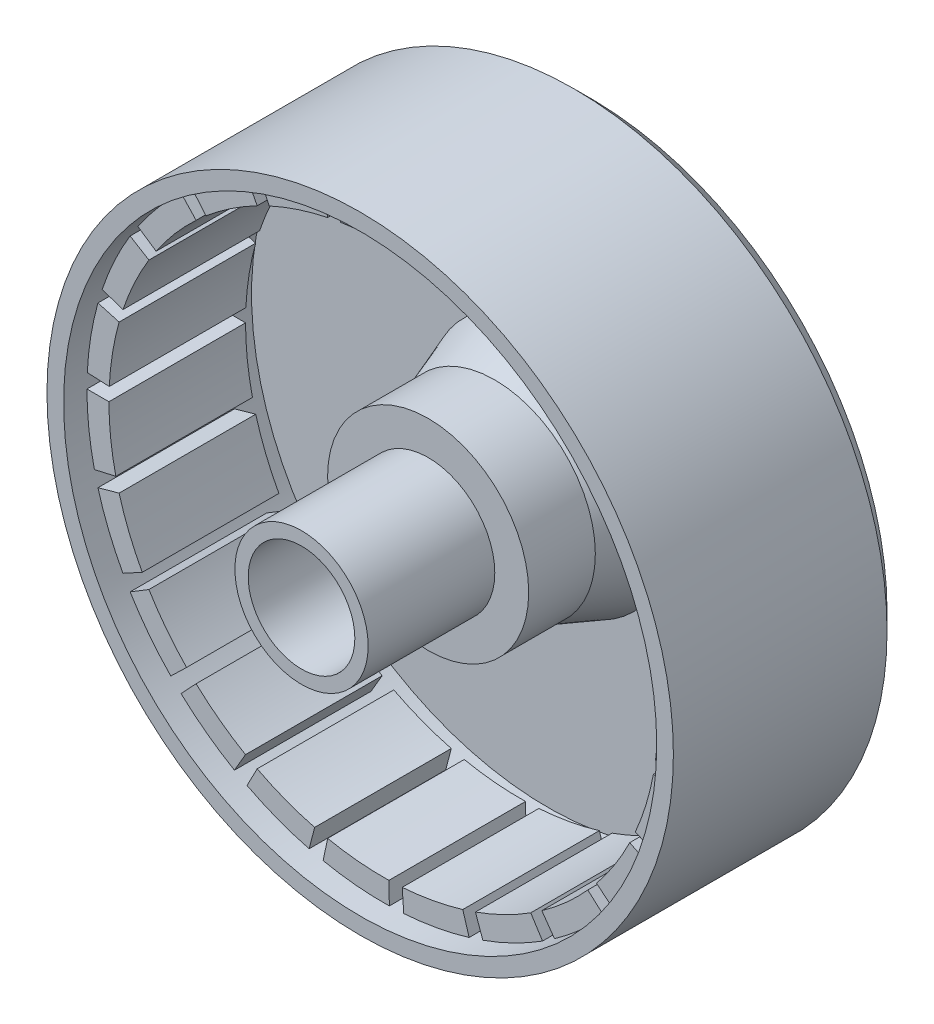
ISO-10303-21;
HEADER;
FILE_DESCRIPTION(('STEP AP214'),'2;1');
FILE_NAME('part.step','',(''),(''),'','','');
FILE_SCHEMA(('AUTOMOTIVE_DESIGN { 1 0 10303 214 1 1 1 1 }'));
ENDSEC;
DATA;
#1=APPLICATION_CONTEXT('core data for automotive mechanical design processes');
#2=APPLICATION_PROTOCOL_DEFINITION('international standard','automotive_design',2000,#1);
#3=PRODUCT_CONTEXT('',#1,'mechanical');
#4=PRODUCT('Part','Part','',(#3));
#5=PRODUCT_RELATED_PRODUCT_CATEGORY('part','',(#4));
#6=PRODUCT_DEFINITION_FORMATION('','',#4);
#7=PRODUCT_DEFINITION_CONTEXT('part definition',#1,'design');
#8=PRODUCT_DEFINITION('design','',#6,#7);
#9=PRODUCT_DEFINITION_SHAPE('','',#8);
#10=(LENGTH_UNIT() NAMED_UNIT(*) SI_UNIT(.MILLI.,.METRE.));
#11=(NAMED_UNIT(*) PLANE_ANGLE_UNIT() SI_UNIT($,.RADIAN.));
#12=(NAMED_UNIT(*) SI_UNIT($,.STERADIAN.) SOLID_ANGLE_UNIT());
#13=UNCERTAINTY_MEASURE_WITH_UNIT(LENGTH_MEASURE(1.E-05),#10,'distance_accuracy_value','');
#14=(GEOMETRIC_REPRESENTATION_CONTEXT(3) GLOBAL_UNCERTAINTY_ASSIGNED_CONTEXT((#13)) GLOBAL_UNIT_ASSIGNED_CONTEXT((#10,
#11,#12)) REPRESENTATION_CONTEXT('',''));
#15=CARTESIAN_POINT('',(0.,0.,0.));
#16=DIRECTION('',(0.,0.,1.));
#17=DIRECTION('',(1.,0.,0.));
#18=AXIS2_PLACEMENT_3D('',#15,#16,#17);
#19=CARTESIAN_POINT('',(0.,0.,17.3));
#20=DIRECTION('',(0.,0.,-1.));
#21=DIRECTION('',(-1.,0.,0.));
#22=AXIS2_PLACEMENT_3D('',#19,#20,#21);
#23=CYLINDRICAL_SURFACE('',#22,23.5);
#24=CARTESIAN_POINT('',(0.,0.,1.27));
#25=DIRECTION('',(0.,0.,1.));
#26=DIRECTION('',(1.,0.,0.));
#27=AXIS2_PLACEMENT_3D('',#24,#25,#26);
#28=CIRCLE('',#27,23.5);
#29=CARTESIAN_POINT('',(23.5,0.,1.27));
#30=VERTEX_POINT('',#29);
#31=EDGE_CURVE('E26',#30,#30,#28,.T.);
#32=ORIENTED_EDGE('',*,*,#31,.T.);
#33=EDGE_LOOP('',(#32));
#34=FACE_BOUND('',#33,.T.);
#35=CARTESIAN_POINT('',(0.,0.,17.3));
#36=DIRECTION('',(0.,0.,1.));
#37=DIRECTION('',(1.,0.,0.));
#38=AXIS2_PLACEMENT_3D('',#35,#36,#37);
#39=CIRCLE('',#38,23.5);
#40=CARTESIAN_POINT('',(23.5,0.,17.3));
#41=VERTEX_POINT('',#40);
#42=EDGE_CURVE('E1606',#41,#41,#39,.T.);
#43=ORIENTED_EDGE('',*,*,#42,.F.);
#44=EDGE_LOOP('',(#43));
#45=FACE_BOUND('',#44,.T.);
#46=ADVANCED_FACE('F16',(#34,#45),#23,.T.);
#47=CARTESIAN_POINT('',(0.,0.,17.3));
#48=DIRECTION('',(0.,0.,1.));
#49=DIRECTION('',(1.,0.,0.));
#50=AXIS2_PLACEMENT_3D('',#47,#48,#49);
#51=PLANE('',#50);
#52=CARTESIAN_POINT('',(0.,0.,17.3));
#53=DIRECTION('',(0.,0.,1.));
#54=DIRECTION('',(1.,0.,0.));
#55=AXIS2_PLACEMENT_3D('',#52,#53,#54);
#56=CIRCLE('',#55,22.25);
#57=CARTESIAN_POINT('',(22.25,0.,17.3));
#58=VERTEX_POINT('',#57);
#59=EDGE_CURVE('E1599',#58,#58,#56,.T.);
#60=ORIENTED_EDGE('',*,*,#59,.F.);
#61=EDGE_LOOP('',(#60));
#62=FACE_BOUND('',#61,.T.);
#63=ORIENTED_EDGE('',*,*,#42,.T.);
#64=EDGE_LOOP('',(#63));
#65=FACE_BOUND('',#64,.T.);
#66=ADVANCED_FACE('F1717',(#62,#65),#51,.T.);
#67=CARTESIAN_POINT('',(0.,0.,0.));
#68=DIRECTION('',(0.,0.,1.));
#69=DIRECTION('',(1.,0.,0.));
#70=AXIS2_PLACEMENT_3D('',#67,#68,#69);
#71=PLANE('',#70);
#72=CARTESIAN_POINT('',(0.,0.,0.));
#73=DIRECTION('',(0.,0.,1.));
#74=DIRECTION('',(1.,0.,0.));
#75=AXIS2_PLACEMENT_3D('',#72,#73,#74);
#76=CIRCLE('',#75,22.23);
#77=CARTESIAN_POINT('',(22.23,0.,0.));
#78=VERTEX_POINT('',#77);
#79=EDGE_CURVE('E11',#78,#78,#76,.F.);
#80=ORIENTED_EDGE('',*,*,#79,.T.);
#81=EDGE_LOOP('',(#80));
#82=FACE_BOUND('',#81,.T.);
#83=CARTESIAN_POINT('',(10.6066017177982,10.6066017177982,0.));
#84=DIRECTION('',(0.,0.,1.));
#85=DIRECTION('',(1.,0.,0.));
#86=AXIS2_PLACEMENT_3D('',#83,#84,#85);
#87=CIRCLE('',#86,1.5);
#88=CARTESIAN_POINT('',(12.1066017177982,10.6066017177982,0.));
#89=VERTEX_POINT('',#88);
#90=EDGE_CURVE('E1646',#89,#89,#87,.T.);
#91=ORIENTED_EDGE('',*,*,#90,.T.);
#92=EDGE_LOOP('',(#91));
#93=FACE_BOUND('',#92,.T.);
#94=CARTESIAN_POINT('',(10.6066017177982,-10.6066017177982,0.));
#95=DIRECTION('',(0.,0.,1.));
#96=DIRECTION('',(1.,0.,0.));
#97=AXIS2_PLACEMENT_3D('',#94,#95,#96);
#98=CIRCLE('',#97,1.5);
#99=CARTESIAN_POINT('',(12.1066017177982,-10.6066017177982,0.));
#100=VERTEX_POINT('',#99);
#101=EDGE_CURVE('E1637',#100,#100,#98,.T.);
#102=ORIENTED_EDGE('',*,*,#101,.T.);
#103=EDGE_LOOP('',(#102));
#104=FACE_BOUND('',#103,.T.);
#105=CARTESIAN_POINT('',(-10.6066017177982,10.6066017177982,0.));
#106=DIRECTION('',(0.,0.,1.));
#107=DIRECTION('',(1.,0.,0.));
#108=AXIS2_PLACEMENT_3D('',#105,#106,#107);
#109=CIRCLE('',#108,1.5);
#110=CARTESIAN_POINT('',(-9.1066017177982,10.6066017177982,0.));
#111=VERTEX_POINT('',#110);
#112=EDGE_CURVE('E1628',#111,#111,#109,.T.);
#113=ORIENTED_EDGE('',*,*,#112,.T.);
#114=EDGE_LOOP('',(#113));
#115=FACE_BOUND('',#114,.T.);
#116=CARTESIAN_POINT('',(-10.6066017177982,-10.6066017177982,0.));
#117=DIRECTION('',(0.,0.,1.));
#118=DIRECTION('',(1.,0.,0.));
#119=AXIS2_PLACEMENT_3D('',#116,#117,#118);
#120=CIRCLE('',#119,1.5);
#121=CARTESIAN_POINT('',(-9.1066017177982,-10.6066017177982,0.));
#122=VERTEX_POINT('',#121);
#123=EDGE_CURVE('E1619',#122,#122,#120,.T.);
#124=ORIENTED_EDGE('',*,*,#123,.T.);
#125=EDGE_LOOP('',(#124));
#126=FACE_BOUND('',#125,.T.);
#127=CARTESIAN_POINT('',(0.,0.,0.));
#128=DIRECTION('',(0.,0.,1.));
#129=DIRECTION('',(1.,0.,0.));
#130=AXIS2_PLACEMENT_3D('',#127,#128,#129);
#131=CIRCLE('',#130,4.);
#132=CARTESIAN_POINT('',(4.,0.,0.));
#133=VERTEX_POINT('',#132);
#134=EDGE_CURVE('E1618',#133,#133,#131,.F.);
#135=ORIENTED_EDGE('',*,*,#134,.F.);
#136=EDGE_LOOP('',(#135));
#137=FACE_BOUND('',#136,.T.);
#138=ADVANCED_FACE('F1721',(#82,#93,#104,#115,#126,#137),#71,.F.);
#139=CARTESIAN_POINT('',(0.,0.,3.2));
#140=DIRECTION('',(0.,0.,1.));
#141=DIRECTION('',(1.,0.,0.));
#142=AXIS2_PLACEMENT_3D('',#139,#140,#141);
#143=CYLINDRICAL_SURFACE('',#142,22.25);
#144=DIRECTION('',(0.,0.,1.));
#145=VECTOR('',#144,1.);
#146=CARTESIAN_POINT('',(-22.25,0.,5.3));
#147=LINE('',#146,#145);
#148=CARTESIAN_POINT('',(-22.25,0.,5.3));
#149=VERTEX_POINT('',#148);
#150=CARTESIAN_POINT('',(-22.25,0.,15.55));
#151=VERTEX_POINT('',#150);
#152=EDGE_CURVE('E594',#149,#151,#147,.T.);
#153=ORIENTED_EDGE('',*,*,#152,.F.);
#154=CARTESIAN_POINT('',(0.,0.,5.3));
#155=DIRECTION('',(0.,0.,1.));
#156=DIRECTION('',(1.,0.,0.));
#157=AXIS2_PLACEMENT_3D('',#154,#155,#156);
#158=CIRCLE('',#157,22.25);
#159=CARTESIAN_POINT('',(-21.6910576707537,-4.95585685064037,5.3));
#160=VERTEX_POINT('',#159);
#161=EDGE_CURVE('E605',#149,#160,#158,.T.);
#162=ORIENTED_EDGE('',*,*,#161,.T.);
#163=DIRECTION('',(0.,0.,1.));
#164=VECTOR('',#163,1.);
#165=CARTESIAN_POINT('',(-21.6910576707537,-4.95585685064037,5.3));
#166=LINE('',#165,#164);
#167=CARTESIAN_POINT('',(-21.6910576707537,-4.95585685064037,15.55));
#168=VERTEX_POINT('',#167);
#169=EDGE_CURVE('E626',#160,#168,#166,.T.);
#170=ORIENTED_EDGE('',*,*,#169,.T.);
#171=CARTESIAN_POINT('',(0.,0.,15.55));
#172=DIRECTION('',(0.,0.,1.));
#173=DIRECTION('',(1.,0.,0.));
#174=AXIS2_PLACEMENT_3D('',#171,#172,#173);
#175=CIRCLE('',#174,22.25);
#176=EDGE_CURVE('E615',#151,#168,#175,.T.);
#177=ORIENTED_EDGE('',*,*,#176,.F.);
#178=EDGE_LOOP('',(#153,#162,#170,#177));
#179=FACE_BOUND('',#178,.T.);
#180=DIRECTION('',(0.,0.,1.));
#181=VECTOR('',#180,1.);
#182=CARTESIAN_POINT('',(-21.4249096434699,6.00297815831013,5.3));
#183=LINE('',#182,#181);
#184=CARTESIAN_POINT('',(-21.4249096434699,6.00297815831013,5.3));
#185=VERTEX_POINT('',#184);
#186=CARTESIAN_POINT('',(-21.4249096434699,6.00297815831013,15.55));
#187=VERTEX_POINT('',#186);
#188=EDGE_CURVE('E643',#185,#187,#183,.T.);
#189=ORIENTED_EDGE('',*,*,#188,.F.);
#190=CARTESIAN_POINT('',(0.,0.,5.3));
#191=DIRECTION('',(0.,0.,1.));
#192=DIRECTION('',(1.,0.,0.));
#193=AXIS2_PLACEMENT_3D('',#190,#191,#192);
#194=CIRCLE('',#193,22.25);
#195=CARTESIAN_POINT('',(-22.2237685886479,1.0800970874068,5.3));
#196=VERTEX_POINT('',#195);
#197=EDGE_CURVE('E628',#185,#196,#194,.T.);
#198=ORIENTED_EDGE('',*,*,#197,.T.);
#199=DIRECTION('',(0.,0.,1.));
#200=VECTOR('',#199,1.);
#201=CARTESIAN_POINT('',(-22.2237685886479,1.0800970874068,5.3));
#202=LINE('',#201,#200);
#203=CARTESIAN_POINT('',(-22.2237685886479,1.0800970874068,15.55));
#204=VERTEX_POINT('',#203);
#205=EDGE_CURVE('E662',#196,#204,#202,.T.);
#206=ORIENTED_EDGE('',*,*,#205,.T.);
#207=CARTESIAN_POINT('',(0.,0.,15.55));
#208=DIRECTION('',(0.,0.,1.));
#209=DIRECTION('',(1.,0.,0.));
#210=AXIS2_PLACEMENT_3D('',#207,#208,#209);
#211=CIRCLE('',#210,22.25);
#212=EDGE_CURVE('E644',#187,#204,#211,.T.);
#213=ORIENTED_EDGE('',*,*,#212,.F.);
#214=EDGE_LOOP('',(#189,#198,#206,#213));
#215=FACE_BOUND('',#214,.T.);
#216=DIRECTION('',(0.,0.,1.));
#217=VECTOR('',#216,1.);
#218=CARTESIAN_POINT('',(-21.4249096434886,-6.00297815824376,5.3));
#219=LINE('',#218,#217);
#220=CARTESIAN_POINT('',(-21.4249096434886,-6.00297815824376,5.3));
#221=VERTEX_POINT('',#220);
#222=CARTESIAN_POINT('',(-21.4249096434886,-6.00297815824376,15.55));
#223=VERTEX_POINT('',#222);
#224=EDGE_CURVE('E707',#221,#223,#219,.T.);
#225=ORIENTED_EDGE('',*,*,#224,.F.);
#226=CARTESIAN_POINT('',(0.,0.,5.3));
#227=DIRECTION('',(0.,0.,1.));
#228=DIRECTION('',(1.,0.,0.));
#229=AXIS2_PLACEMENT_3D('',#226,#227,#228);
#230=CIRCLE('',#229,22.25);
#231=CARTESIAN_POINT('',(-19.5496202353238,-10.624257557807,5.3));
#232=VERTEX_POINT('',#231);
#233=EDGE_CURVE('E673',#221,#232,#230,.T.);
#234=ORIENTED_EDGE('',*,*,#233,.T.);
#235=DIRECTION('',(0.,0.,1.));
#236=VECTOR('',#235,1.);
#237=CARTESIAN_POINT('',(-19.5496202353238,-10.624257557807,5.3));
#238=LINE('',#237,#236);
#239=CARTESIAN_POINT('',(-19.5496202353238,-10.624257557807,15.55));
#240=VERTEX_POINT('',#239);
#241=EDGE_CURVE('E703',#232,#240,#238,.T.);
#242=ORIENTED_EDGE('',*,*,#241,.T.);
#243=CARTESIAN_POINT('',(0.,0.,15.55));
#244=DIRECTION('',(0.,0.,1.));
#245=DIRECTION('',(1.,0.,0.));
#246=AXIS2_PLACEMENT_3D('',#243,#244,#245);
#247=CIRCLE('',#246,22.25);
#248=EDGE_CURVE('E689',#223,#240,#247,.T.);
#249=ORIENTED_EDGE('',*,*,#248,.F.);
#250=EDGE_LOOP('',(#225,#234,#242,#249));
#251=FACE_BOUND('',#250,.T.);
#252=DIRECTION('',(0.,0.,1.));
#253=VECTOR('',#252,1.);
#254=CARTESIAN_POINT('',(-19.0108317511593,11.5607428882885,5.3));
#255=LINE('',#254,#253);
#256=CARTESIAN_POINT('',(-19.0108317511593,11.5607428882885,5.3));
#257=VERTEX_POINT('',#256);
#258=CARTESIAN_POINT('',(-19.0108317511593,11.5607428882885,15.55));
#259=VERTEX_POINT('',#258);
#260=EDGE_CURVE('E745',#257,#259,#255,.T.);
#261=ORIENTED_EDGE('',*,*,#260,.F.);
#262=CARTESIAN_POINT('',(0.,0.,5.3));
#263=DIRECTION('',(0.,0.,1.));
#264=DIRECTION('',(1.,0.,0.));
#265=AXIS2_PLACEMENT_3D('',#262,#263,#264);
#266=CIRCLE('',#265,22.25);
#267=CARTESIAN_POINT('',(-21.1082442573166,7.03594516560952,5.3));
#268=VERTEX_POINT('',#267);
#269=EDGE_CURVE('E727',#257,#268,#266,.T.);
#270=ORIENTED_EDGE('',*,*,#269,.T.);
#271=DIRECTION('',(0.,0.,1.));
#272=VECTOR('',#271,1.);
#273=CARTESIAN_POINT('',(-21.1082442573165,7.03594516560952,5.3));
#274=LINE('',#273,#272);
#275=CARTESIAN_POINT('',(-21.1082442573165,7.03594516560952,15.55));
#276=VERTEX_POINT('',#275);
#277=EDGE_CURVE('E730',#268,#276,#274,.T.);
#278=ORIENTED_EDGE('',*,*,#277,.T.);
#279=CARTESIAN_POINT('',(0.,0.,15.55));
#280=DIRECTION('',(0.,0.,1.));
#281=DIRECTION('',(1.,0.,0.));
#282=AXIS2_PLACEMENT_3D('',#279,#280,#281);
#283=CIRCLE('',#282,22.25);
#284=EDGE_CURVE('E719',#259,#276,#283,.T.);
#285=ORIENTED_EDGE('',*,*,#284,.F.);
#286=EDGE_LOOP('',(#261,#270,#278,#285));
#287=FACE_BOUND('',#286,.T.);
#288=DIRECTION('',(0.,0.,1.));
#289=VECTOR('',#288,1.);
#290=CARTESIAN_POINT('',(-19.0108317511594,-11.5607428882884,5.3));
#291=LINE('',#290,#289);
#292=CARTESIAN_POINT('',(-19.0108317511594,-11.5607428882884,5.3));
#293=VERTEX_POINT('',#292);
#294=CARTESIAN_POINT('',(-19.0108317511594,-11.5607428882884,15.55));
#295=VERTEX_POINT('',#294);
#296=EDGE_CURVE('E796',#293,#295,#291,.T.);
#297=ORIENTED_EDGE('',*,*,#296,.F.);
#298=CARTESIAN_POINT('',(0.,0.,5.3));
#299=DIRECTION('',(0.,0.,1.));
#300=DIRECTION('',(1.,0.,0.));
#301=AXIS2_PLACEMENT_3D('',#298,#299,#300);
#302=CIRCLE('',#301,22.25);
#303=CARTESIAN_POINT('',(-15.9582769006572,-15.5047056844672,5.3));
#304=VERTEX_POINT('',#303);
#305=EDGE_CURVE('E762',#293,#304,#302,.T.);
#306=ORIENTED_EDGE('',*,*,#305,.T.);
#307=DIRECTION('',(0.,0.,1.));
#308=VECTOR('',#307,1.);
#309=CARTESIAN_POINT('',(-15.9582769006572,-15.5047056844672,5.3));
#310=LINE('',#309,#308);
#311=CARTESIAN_POINT('',(-15.9582769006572,-15.5047056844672,15.55));
#312=VERTEX_POINT('',#311);
#313=EDGE_CURVE('E792',#304,#312,#310,.T.);
#314=ORIENTED_EDGE('',*,*,#313,.T.);
#315=CARTESIAN_POINT('',(0.,0.,15.55));
#316=DIRECTION('',(0.,0.,1.));
#317=DIRECTION('',(1.,0.,0.));
#318=AXIS2_PLACEMENT_3D('',#315,#316,#317);
#319=CIRCLE('',#318,22.25);
#320=EDGE_CURVE('E778',#295,#312,#319,.T.);
#321=ORIENTED_EDGE('',*,*,#320,.F.);
#322=EDGE_LOOP('',(#297,#306,#314,#321));
#323=FACE_BOUND('',#322,.T.);
#324=DIRECTION('',(0.,0.,1.));
#325=VECTOR('',#324,1.);
#326=CARTESIAN_POINT('',(-15.1868074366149,16.2611002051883,5.3));
#327=LINE('',#326,#325);
#328=CARTESIAN_POINT('',(-15.1868074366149,16.2611002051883,5.3));
#329=VERTEX_POINT('',#328);
#330=CARTESIAN_POINT('',(-15.1868074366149,16.2611002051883,15.55));
#331=VERTEX_POINT('',#330);
#332=EDGE_CURVE('E834',#329,#331,#327,.T.);
#333=ORIENTED_EDGE('',*,*,#332,.F.);
#334=CARTESIAN_POINT('',(0.,0.,5.3));
#335=DIRECTION('',(0.,0.,1.));
#336=DIRECTION('',(1.,0.,0.));
#337=AXIS2_PLACEMENT_3D('',#334,#335,#336);
#338=CIRCLE('',#337,22.25);
#339=CARTESIAN_POINT('',(-18.4272180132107,12.4699693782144,5.3));
#340=VERTEX_POINT('',#339);
#341=EDGE_CURVE('E816',#329,#340,#338,.T.);
#342=ORIENTED_EDGE('',*,*,#341,.T.);
#343=DIRECTION('',(0.,0.,1.));
#344=VECTOR('',#343,1.);
#345=CARTESIAN_POINT('',(-18.4272180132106,12.4699693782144,5.3));
#346=LINE('',#345,#344);
#347=CARTESIAN_POINT('',(-18.4272180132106,12.4699693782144,15.55));
#348=VERTEX_POINT('',#347);
#349=EDGE_CURVE('E819',#340,#348,#346,.T.);
#350=ORIENTED_EDGE('',*,*,#349,.T.);
#351=CARTESIAN_POINT('',(0.,0.,15.55));
#352=DIRECTION('',(0.,0.,1.));
#353=DIRECTION('',(1.,0.,0.));
#354=AXIS2_PLACEMENT_3D('',#351,#352,#353);
#355=CIRCLE('',#354,22.25);
#356=EDGE_CURVE('E808',#331,#348,#355,.T.);
#357=ORIENTED_EDGE('',*,*,#356,.F.);
#358=EDGE_LOOP('',(#333,#342,#350,#357));
#359=FACE_BOUND('',#358,.T.);
#360=DIRECTION('',(0.,0.,1.));
#361=VECTOR('',#360,1.);
#362=CARTESIAN_POINT('',(-15.1868074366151,-16.2611002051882,5.3));
#363=LINE('',#362,#361);
#364=CARTESIAN_POINT('',(-15.1868074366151,-16.2611002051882,5.3));
#365=VERTEX_POINT('',#364);
#366=CARTESIAN_POINT('',(-15.1868074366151,-16.2611002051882,15.55));
#367=VERTEX_POINT('',#366);
#368=EDGE_CURVE('E885',#365,#367,#363,.T.);
#369=ORIENTED_EDGE('',*,*,#368,.F.);
#370=CARTESIAN_POINT('',(0.,0.,5.3));
#371=DIRECTION('',(0.,0.,1.));
#372=DIRECTION('',(1.,0.,0.));
#373=AXIS2_PLACEMENT_3D('',#370,#371,#372);
#374=CIRCLE('',#373,22.25);
#375=CARTESIAN_POINT('',(-11.1833811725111,-19.2352407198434,5.3));
#376=VERTEX_POINT('',#375);
#377=EDGE_CURVE('E851',#365,#376,#374,.T.);
#378=ORIENTED_EDGE('',*,*,#377,.T.);
#379=DIRECTION('',(0.,0.,1.));
#380=VECTOR('',#379,1.);
#381=CARTESIAN_POINT('',(-11.1833811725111,-19.2352407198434,5.3));
#382=LINE('',#381,#380);
#383=CARTESIAN_POINT('',(-11.1833811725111,-19.2352407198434,15.55));
#384=VERTEX_POINT('',#383);
#385=EDGE_CURVE('E881',#376,#384,#382,.T.);
#386=ORIENTED_EDGE('',*,*,#385,.T.);
#387=CARTESIAN_POINT('',(0.,0.,15.55));
#388=DIRECTION('',(0.,0.,1.));
#389=DIRECTION('',(1.,0.,0.));
#390=AXIS2_PLACEMENT_3D('',#387,#388,#389);
#391=CIRCLE('',#390,22.25);
#392=EDGE_CURVE('E867',#367,#384,#391,.T.);
#393=ORIENTED_EDGE('',*,*,#392,.F.);
#394=EDGE_LOOP('',(#369,#378,#386,#393));
#395=FACE_BOUND('',#394,.T.);
#396=DIRECTION('',(0.,0.,1.));
#397=VECTOR('',#396,1.);
#398=CARTESIAN_POINT('',(-10.236447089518,19.7554461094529,5.3));
#399=LINE('',#398,#397);
#400=CARTESIAN_POINT('',(-10.236447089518,19.7554461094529,5.3));
#401=VERTEX_POINT('',#400);
#402=CARTESIAN_POINT('',(-10.236447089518,19.7554461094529,15.55));
#403=VERTEX_POINT('',#402);
#404=EDGE_CURVE('E923',#401,#403,#399,.T.);
#405=ORIENTED_EDGE('',*,*,#404,.F.);
#406=CARTESIAN_POINT('',(0.,0.,5.3));
#407=DIRECTION('',(0.,0.,1.));
#408=DIRECTION('',(1.,0.,0.));
#409=AXIS2_PLACEMENT_3D('',#406,#407,#408);
#410=CIRCLE('',#409,22.25);
#411=CARTESIAN_POINT('',(-14.3795293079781,16.9791530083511,5.3));
#412=VERTEX_POINT('',#411);
#413=EDGE_CURVE('E905',#401,#412,#410,.T.);
#414=ORIENTED_EDGE('',*,*,#413,.T.);
#415=DIRECTION('',(0.,0.,1.));
#416=VECTOR('',#415,1.);
#417=CARTESIAN_POINT('',(-14.3795293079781,16.9791530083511,5.3));
#418=LINE('',#417,#416);
#419=CARTESIAN_POINT('',(-14.3795293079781,16.9791530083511,15.55));
#420=VERTEX_POINT('',#419);
#421=EDGE_CURVE('E908',#412,#420,#418,.T.);
#422=ORIENTED_EDGE('',*,*,#421,.T.);
#423=CARTESIAN_POINT('',(0.,0.,15.55));
#424=DIRECTION('',(0.,0.,1.));
#425=DIRECTION('',(1.,0.,0.));
#426=AXIS2_PLACEMENT_3D('',#423,#424,#425);
#427=CIRCLE('',#426,22.25);
#428=EDGE_CURVE('E897',#403,#420,#427,.T.);
#429=ORIENTED_EDGE('',*,*,#428,.F.);
#430=EDGE_LOOP('',(#405,#414,#422,#429));
#431=FACE_BOUND('',#430,.T.);
#432=DIRECTION('',(0.,0.,1.));
#433=VECTOR('',#432,1.);
#434=CARTESIAN_POINT('',(-10.2364470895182,-19.7554461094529,5.3));
#435=LINE('',#434,#433);
#436=CARTESIAN_POINT('',(-10.2364470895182,-19.7554461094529,5.3));
#437=VERTEX_POINT('',#436);
#438=CARTESIAN_POINT('',(-10.2364470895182,-19.7554461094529,15.55));
#439=VERTEX_POINT('',#438);
#440=EDGE_CURVE('E974',#437,#439,#435,.T.);
#441=ORIENTED_EDGE('',*,*,#440,.F.);
#442=CARTESIAN_POINT('',(0.,0.,5.3));
#443=DIRECTION('',(0.,0.,1.));
#444=DIRECTION('',(1.,0.,0.));
#445=AXIS2_PLACEMENT_3D('',#442,#443,#444);
#446=CIRCLE('',#445,22.25);
#447=CARTESIAN_POINT('',(-5.57906522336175,-21.5391859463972,5.3));
#448=VERTEX_POINT('',#447);
#449=EDGE_CURVE('E940',#437,#448,#446,.T.);
#450=ORIENTED_EDGE('',*,*,#449,.T.);
#451=DIRECTION('',(0.,0.,1.));
#452=VECTOR('',#451,1.);
#453=CARTESIAN_POINT('',(-5.57906522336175,-21.5391859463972,5.3));
#454=LINE('',#453,#452);
#455=CARTESIAN_POINT('',(-5.57906522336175,-21.5391859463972,15.55));
#456=VERTEX_POINT('',#455);
#457=EDGE_CURVE('E970',#448,#456,#454,.T.);
#458=ORIENTED_EDGE('',*,*,#457,.T.);
#459=CARTESIAN_POINT('',(0.,0.,15.55));
#460=DIRECTION('',(0.,0.,1.));
#461=DIRECTION('',(1.,0.,0.));
#462=AXIS2_PLACEMENT_3D('',#459,#460,#461);
#463=CIRCLE('',#462,22.25);
#464=EDGE_CURVE('E956',#439,#456,#463,.T.);
#465=ORIENTED_EDGE('',*,*,#464,.F.);
#466=EDGE_LOOP('',(#441,#450,#458,#465));
#467=FACE_BOUND('',#466,.T.);
#468=DIRECTION('',(0.,0.,1.));
#469=VECTOR('',#468,1.);
#470=CARTESIAN_POINT('',(-4.52689629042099,21.7846209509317,5.3));
#471=LINE('',#470,#469);
#472=CARTESIAN_POINT('',(-4.52689629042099,21.7846209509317,5.3));
#473=VERTEX_POINT('',#472);
#474=CARTESIAN_POINT('',(-4.52689629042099,21.7846209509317,15.55));
#475=VERTEX_POINT('',#474);
#476=EDGE_CURVE('E1012',#473,#475,#471,.T.);
#477=ORIENTED_EDGE('',*,*,#476,.F.);
#478=CARTESIAN_POINT('',(0.,0.,5.3));
#479=DIRECTION('',(0.,0.,1.));
#480=DIRECTION('',(1.,0.,0.));
#481=AXIS2_PLACEMENT_3D('',#478,#479,#480);
#482=CIRCLE('',#481,22.25);
#483=CARTESIAN_POINT('',(-9.26537669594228,20.229070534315,5.3));
#484=VERTEX_POINT('',#483);
#485=EDGE_CURVE('E994',#473,#484,#482,.T.);
#486=ORIENTED_EDGE('',*,*,#485,.T.);
#487=DIRECTION('',(0.,0.,1.));
#488=VECTOR('',#487,1.);
#489=CARTESIAN_POINT('',(-9.26537669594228,20.229070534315,5.3));
#490=LINE('',#489,#488);
#491=CARTESIAN_POINT('',(-9.26537669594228,20.229070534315,15.55));
#492=VERTEX_POINT('',#491);
#493=EDGE_CURVE('E997',#484,#492,#490,.T.);
#494=ORIENTED_EDGE('',*,*,#493,.T.);
#495=CARTESIAN_POINT('',(0.,0.,15.55));
#496=DIRECTION('',(0.,0.,1.));
#497=DIRECTION('',(1.,0.,0.));
#498=AXIS2_PLACEMENT_3D('',#495,#496,#497);
#499=CIRCLE('',#498,22.25);
#500=EDGE_CURVE('E986',#475,#492,#499,.T.);
#501=ORIENTED_EDGE('',*,*,#500,.F.);
#502=EDGE_LOOP('',(#477,#486,#494,#501));
#503=FACE_BOUND('',#502,.T.);
#504=DIRECTION('',(0.,0.,1.));
#505=VECTOR('',#504,1.);
#506=CARTESIAN_POINT('',(-4.52689629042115,-21.7846209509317,5.3));
#507=LINE('',#506,#505);
#508=CARTESIAN_POINT('',(-4.52689629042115,-21.7846209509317,5.3));
#509=VERTEX_POINT('',#508);
#510=CARTESIAN_POINT('',(-4.52689629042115,-21.7846209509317,15.55));
#511=VERTEX_POINT('',#510);
#512=EDGE_CURVE('E1063',#509,#511,#507,.T.);
#513=ORIENTED_EDGE('',*,*,#512,.F.);
#514=CARTESIAN_POINT('',(0.,0.,5.3));
#515=DIRECTION('',(0.,0.,1.));
#516=DIRECTION('',(1.,0.,0.));
#517=AXIS2_PLACEMENT_3D('',#514,#515,#516);
#518=CIRCLE('',#517,22.25);
#519=CARTESIAN_POINT('',(0.439024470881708,-22.2456682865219,5.3));
#520=VERTEX_POINT('',#519);
#521=EDGE_CURVE('E1029',#509,#520,#518,.T.);
#522=ORIENTED_EDGE('',*,*,#521,.T.);
#523=DIRECTION('',(0.,0.,1.));
#524=VECTOR('',#523,1.);
#525=CARTESIAN_POINT('',(0.439024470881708,-22.2456682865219,5.3));
#526=LINE('',#525,#524);
#527=CARTESIAN_POINT('',(0.439024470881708,-22.2456682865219,15.55));
#528=VERTEX_POINT('',#527);
#529=EDGE_CURVE('E1059',#520,#528,#526,.T.);
#530=ORIENTED_EDGE('',*,*,#529,.T.);
#531=CARTESIAN_POINT('',(0.,0.,15.55));
#532=DIRECTION('',(0.,0.,1.));
#533=DIRECTION('',(1.,0.,0.));
#534=AXIS2_PLACEMENT_3D('',#531,#532,#533);
#535=CIRCLE('',#534,22.25);
#536=EDGE_CURVE('E1045',#511,#528,#535,.T.);
#537=ORIENTED_EDGE('',*,*,#536,.F.);
#538=EDGE_LOOP('',(#513,#522,#530,#537));
#539=FACE_BOUND('',#538,.T.);
#540=DIRECTION('',(0.,0.,1.));
#541=VECTOR('',#540,1.);
#542=CARTESIAN_POINT('',(1.51839369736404,22.1981301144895,5.3));
#543=LINE('',#542,#541);
#544=CARTESIAN_POINT('',(1.51839369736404,22.1981301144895,5.3));
#545=VERTEX_POINT('',#544);
#546=CARTESIAN_POINT('',(1.51839369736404,22.1981301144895,15.55));
#547=VERTEX_POINT('',#546);
#548=EDGE_CURVE('E1101',#545,#547,#543,.T.);
#549=ORIENTED_EDGE('',*,*,#548,.F.);
#550=CARTESIAN_POINT('',(0.,0.,5.3));
#551=DIRECTION('',(0.,0.,1.));
#552=DIRECTION('',(1.,0.,0.));
#553=AXIS2_PLACEMENT_3D('',#550,#551,#552);
#554=CIRCLE('',#553,22.25);
#555=CARTESIAN_POINT('',(-3.46405348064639,21.9786904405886,5.3));
#556=VERTEX_POINT('',#555);
#557=EDGE_CURVE('E1083',#545,#556,#554,.T.);
#558=ORIENTED_EDGE('',*,*,#557,.T.);
#559=DIRECTION('',(0.,0.,1.));
#560=VECTOR('',#559,1.);
#561=CARTESIAN_POINT('',(-3.46405348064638,21.9786904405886,5.3));
#562=LINE('',#561,#560);
#563=CARTESIAN_POINT('',(-3.46405348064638,21.9786904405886,15.55));
#564=VERTEX_POINT('',#563);
#565=EDGE_CURVE('E1086',#556,#564,#562,.T.);
#566=ORIENTED_EDGE('',*,*,#565,.T.);
#567=CARTESIAN_POINT('',(0.,0.,15.55));
#568=DIRECTION('',(0.,0.,1.));
#569=DIRECTION('',(1.,0.,0.));
#570=AXIS2_PLACEMENT_3D('',#567,#568,#569);
#571=CIRCLE('',#570,22.25);
#572=EDGE_CURVE('E1075',#547,#564,#571,.T.);
#573=ORIENTED_EDGE('',*,*,#572,.F.);
#574=EDGE_LOOP('',(#549,#558,#566,#573));
#575=FACE_BOUND('',#574,.T.);
#576=DIRECTION('',(0.,0.,1.));
#577=VECTOR('',#576,1.);
#578=CARTESIAN_POINT('',(1.51839369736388,-22.1981301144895,5.3));
#579=LINE('',#578,#577);
#580=CARTESIAN_POINT('',(1.51839369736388,-22.1981301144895,5.3));
#581=VERTEX_POINT('',#580);
#582=CARTESIAN_POINT('',(1.51839369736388,-22.1981301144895,15.55));
#583=VERTEX_POINT('',#582);
#584=EDGE_CURVE('E1152',#581,#583,#579,.T.);
#585=ORIENTED_EDGE('',*,*,#584,.F.);
#586=CARTESIAN_POINT('',(0.,0.,5.3));
#587=DIRECTION('',(0.,0.,1.));
#588=DIRECTION('',(1.,0.,0.));
#589=AXIS2_PLACEMENT_3D('',#586,#587,#588);
#590=CIRCLE('',#589,22.25);
#591=CARTESIAN_POINT('',(6.42455372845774,-21.302291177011,5.3));
#592=VERTEX_POINT('',#591);
#593=EDGE_CURVE('E1118',#581,#592,#590,.T.);
#594=ORIENTED_EDGE('',*,*,#593,.T.);
#595=DIRECTION('',(0.,0.,1.));
#596=VECTOR('',#595,1.);
#597=CARTESIAN_POINT('',(6.42455372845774,-21.302291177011,5.3));
#598=LINE('',#597,#596);
#599=CARTESIAN_POINT('',(6.42455372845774,-21.302291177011,15.55));
#600=VERTEX_POINT('',#599);
#601=EDGE_CURVE('E1148',#592,#600,#598,.T.);
#602=ORIENTED_EDGE('',*,*,#601,.T.);
#603=CARTESIAN_POINT('',(0.,0.,15.55));
#604=DIRECTION('',(0.,0.,1.));
#605=DIRECTION('',(1.,0.,0.));
#606=AXIS2_PLACEMENT_3D('',#603,#604,#605);
#607=CIRCLE('',#606,22.25);
#608=EDGE_CURVE('E1134',#583,#600,#607,.T.);
#609=ORIENTED_EDGE('',*,*,#608,.F.);
#610=EDGE_LOOP('',(#585,#594,#602,#609));
#611=FACE_BOUND('',#610,.T.);
#612=DIRECTION('',(0.,0.,1.));
#613=VECTOR('',#612,1.);
#614=CARTESIAN_POINT('',(7.45107137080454,20.9653055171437,5.3));
#615=LINE('',#614,#613);
#616=CARTESIAN_POINT('',(7.45107137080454,20.9653055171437,5.3));
#617=VERTEX_POINT('',#616);
#618=CARTESIAN_POINT('',(7.45107137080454,20.9653055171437,15.55));
#619=VERTEX_POINT('',#618);
#620=EDGE_CURVE('E1190',#617,#619,#615,.T.);
#621=ORIENTED_EDGE('',*,*,#620,.F.);
#622=CARTESIAN_POINT('',(0.,0.,5.3));
#623=DIRECTION('',(0.,0.,1.));
#624=DIRECTION('',(1.,0.,0.));
#625=AXIS2_PLACEMENT_3D('',#622,#623,#624);
#626=CIRCLE('',#625,22.25);
#627=CARTESIAN_POINT('',(2.59418273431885,22.0982514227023,5.3));
#628=VERTEX_POINT('',#627);
#629=EDGE_CURVE('E1172',#617,#628,#626,.T.);
#630=ORIENTED_EDGE('',*,*,#629,.T.);
#631=DIRECTION('',(0.,0.,1.));
#632=VECTOR('',#631,1.);
#633=CARTESIAN_POINT('',(2.59418273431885,22.0982514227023,5.3));
#634=LINE('',#633,#632);
#635=CARTESIAN_POINT('',(2.59418273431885,22.0982514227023,15.55));
#636=VERTEX_POINT('',#635);
#637=EDGE_CURVE('E1175',#628,#636,#634,.T.);
#638=ORIENTED_EDGE('',*,*,#637,.T.);
#639=CARTESIAN_POINT('',(0.,0.,15.55));
#640=DIRECTION('',(0.,0.,1.));
#641=DIRECTION('',(1.,0.,0.));
#642=AXIS2_PLACEMENT_3D('',#639,#640,#641);
#643=CIRCLE('',#642,22.25);
#644=EDGE_CURVE('E1164',#619,#636,#643,.T.);
#645=ORIENTED_EDGE('',*,*,#644,.F.);
#646=EDGE_LOOP('',(#621,#630,#638,#645));
#647=FACE_BOUND('',#646,.T.);
#648=DIRECTION('',(0.,0.,1.));
#649=VECTOR('',#648,1.);
#650=CARTESIAN_POINT('',(7.45107137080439,-20.9653055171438,5.3));
#651=LINE('',#650,#649);
#652=CARTESIAN_POINT('',(7.45107137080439,-20.9653055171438,5.3));
#653=VERTEX_POINT('',#652);
#654=CARTESIAN_POINT('',(7.45107137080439,-20.9653055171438,15.55));
#655=VERTEX_POINT('',#654);
#656=EDGE_CURVE('E1241',#653,#655,#651,.T.);
#657=ORIENTED_EDGE('',*,*,#656,.F.);
#658=CARTESIAN_POINT('',(0.,0.,5.3));
#659=DIRECTION('',(0.,0.,1.));
#660=DIRECTION('',(1.,0.,0.));
#661=AXIS2_PLACEMENT_3D('',#658,#659,#660);
#662=CIRCLE('',#661,22.25);
#663=CARTESIAN_POINT('',(11.9336032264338,-18.7790205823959,5.3));
#664=VERTEX_POINT('',#663);
#665=EDGE_CURVE('E1207',#653,#664,#662,.T.);
#666=ORIENTED_EDGE('',*,*,#665,.T.);
#667=DIRECTION('',(0.,0.,1.));
#668=VECTOR('',#667,1.);
#669=CARTESIAN_POINT('',(11.9336032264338,-18.7790205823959,5.3));
#670=LINE('',#669,#668);
#671=CARTESIAN_POINT('',(11.9336032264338,-18.7790205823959,15.55));
#672=VERTEX_POINT('',#671);
#673=EDGE_CURVE('E1237',#664,#672,#670,.T.);
#674=ORIENTED_EDGE('',*,*,#673,.T.);
#675=CARTESIAN_POINT('',(0.,0.,15.55));
#676=DIRECTION('',(0.,0.,1.));
#677=DIRECTION('',(1.,0.,0.));
#678=AXIS2_PLACEMENT_3D('',#675,#676,#677);
#679=CIRCLE('',#678,22.25);
#680=EDGE_CURVE('E1223',#655,#672,#679,.T.);
#681=ORIENTED_EDGE('',*,*,#680,.F.);
#682=EDGE_LOOP('',(#657,#666,#674,#681));
#683=FACE_BOUND('',#682,.T.);
#684=DIRECTION('',(0.,0.,1.));
#685=VECTOR('',#684,1.);
#686=CARTESIAN_POINT('',(12.8311371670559,18.1775801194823,5.3));
#687=LINE('',#686,#685);
#688=CARTESIAN_POINT('',(12.8311371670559,18.1775801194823,5.3));
#689=VERTEX_POINT('',#688);
#690=CARTESIAN_POINT('',(12.8311371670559,18.1775801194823,15.55));
#691=VERTEX_POINT('',#690);
#692=EDGE_CURVE('E1279',#689,#691,#687,.T.);
#693=ORIENTED_EDGE('',*,*,#692,.F.);
#694=CARTESIAN_POINT('',(0.,0.,5.3));
#695=DIRECTION('',(0.,0.,1.));
#696=DIRECTION('',(1.,0.,0.));
#697=AXIS2_PLACEMENT_3D('',#694,#695,#696);
#698=CIRCLE('',#697,22.25);
#699=CARTESIAN_POINT('',(8.46002028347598,20.5788861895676,5.3));
#700=VERTEX_POINT('',#699);
#701=EDGE_CURVE('E1261',#689,#700,#698,.T.);
#702=ORIENTED_EDGE('',*,*,#701,.T.);
#703=DIRECTION('',(0.,0.,1.));
#704=VECTOR('',#703,1.);
#705=CARTESIAN_POINT('',(8.46002028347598,20.5788861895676,5.3));
#706=LINE('',#705,#704);
#707=CARTESIAN_POINT('',(8.46002028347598,20.5788861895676,15.55));
#708=VERTEX_POINT('',#707);
#709=EDGE_CURVE('E1264',#700,#708,#706,.T.);
#710=ORIENTED_EDGE('',*,*,#709,.T.);
#711=CARTESIAN_POINT('',(0.,0.,15.55));
#712=DIRECTION('',(0.,0.,1.));
#713=DIRECTION('',(1.,0.,0.));
#714=AXIS2_PLACEMENT_3D('',#711,#712,#713);
#715=CIRCLE('',#714,22.25);
#716=EDGE_CURVE('E1253',#691,#708,#715,.T.);
#717=ORIENTED_EDGE('',*,*,#716,.F.);
#718=EDGE_LOOP('',(#693,#702,#710,#717));
#719=FACE_BOUND('',#718,.T.);
#720=DIRECTION('',(0.,0.,1.));
#721=VECTOR('',#720,1.);
#722=CARTESIAN_POINT('',(12.8311371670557,-18.1775801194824,5.3));
#723=LINE('',#722,#721);
#724=CARTESIAN_POINT('',(12.8311371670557,-18.1775801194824,5.3));
#725=VERTEX_POINT('',#724);
#726=CARTESIAN_POINT('',(12.8311371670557,-18.1775801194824,15.55));
#727=VERTEX_POINT('',#726);
#728=EDGE_CURVE('E1330',#725,#727,#723,.T.);
#729=ORIENTED_EDGE('',*,*,#728,.F.);
#730=CARTESIAN_POINT('',(0.,0.,5.3));
#731=DIRECTION('',(0.,0.,1.));
#732=DIRECTION('',(1.,0.,0.));
#733=AXIS2_PLACEMENT_3D('',#730,#731,#732);
#734=CIRCLE('',#733,22.25);
#735=CARTESIAN_POINT('',(16.557591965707,-14.8629959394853,5.3));
#736=VERTEX_POINT('',#735);
#737=EDGE_CURVE('E1296',#725,#736,#734,.T.);
#738=ORIENTED_EDGE('',*,*,#737,.T.);
#739=DIRECTION('',(0.,0.,1.));
#740=VECTOR('',#739,1.);
#741=CARTESIAN_POINT('',(16.557591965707,-14.8629959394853,5.3));
#742=LINE('',#741,#740);
#743=CARTESIAN_POINT('',(16.557591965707,-14.8629959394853,15.55));
#744=VERTEX_POINT('',#743);
#745=EDGE_CURVE('E1326',#736,#744,#742,.T.);
#746=ORIENTED_EDGE('',*,*,#745,.T.);
#747=CARTESIAN_POINT('',(0.,0.,15.55));
#748=DIRECTION('',(0.,0.,1.));
#749=DIRECTION('',(1.,0.,0.));
#750=AXIS2_PLACEMENT_3D('',#747,#748,#749);
#751=CIRCLE('',#750,22.25);
#752=EDGE_CURVE('E1312',#727,#744,#751,.T.);
#753=ORIENTED_EDGE('',*,*,#752,.F.);
#754=EDGE_LOOP('',(#729,#738,#746,#753));
#755=FACE_BOUND('',#754,.T.);
#756=DIRECTION('',(0.,0.,1.));
#757=VECTOR('',#756,1.);
#758=CARTESIAN_POINT('',(17.2595762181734,14.0417067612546,5.3));
#759=LINE('',#758,#757);
#760=CARTESIAN_POINT('',(17.2595762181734,14.0417067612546,5.3));
#761=VERTEX_POINT('',#760);
#762=CARTESIAN_POINT('',(17.2595762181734,14.0417067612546,15.55));
#763=VERTEX_POINT('',#762);
#764=EDGE_CURVE('E1368',#761,#763,#759,.T.);
#765=ORIENTED_EDGE('',*,*,#764,.F.);
#766=CARTESIAN_POINT('',(0.,0.,5.3));
#767=DIRECTION('',(0.,0.,1.));
#768=DIRECTION('',(1.,0.,0.));
#769=AXIS2_PLACEMENT_3D('',#766,#767,#768);
#770=CIRCLE('',#769,22.25);
#771=CARTESIAN_POINT('',(13.6984168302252,17.5332791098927,5.3));
#772=VERTEX_POINT('',#771);
#773=EDGE_CURVE('E1350',#761,#772,#770,.T.);
#774=ORIENTED_EDGE('',*,*,#773,.T.);
#775=DIRECTION('',(0.,0.,1.));
#776=VECTOR('',#775,1.);
#777=CARTESIAN_POINT('',(13.6984168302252,17.5332791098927,5.3));
#778=LINE('',#777,#776);
#779=CARTESIAN_POINT('',(13.6984168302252,17.5332791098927,15.55));
#780=VERTEX_POINT('',#779);
#781=EDGE_CURVE('E1353',#772,#780,#778,.T.);
#782=ORIENTED_EDGE('',*,*,#781,.T.);
#783=CARTESIAN_POINT('',(0.,0.,15.55));
#784=DIRECTION('',(0.,0.,1.));
#785=DIRECTION('',(1.,0.,0.));
#786=AXIS2_PLACEMENT_3D('',#783,#784,#785);
#787=CIRCLE('',#786,22.25);
#788=EDGE_CURVE('E1342',#763,#780,#787,.T.);
#789=ORIENTED_EDGE('',*,*,#788,.F.);
#790=EDGE_LOOP('',(#765,#774,#782,#789));
#791=FACE_BOUND('',#790,.T.);
#792=DIRECTION('',(0.,0.,1.));
#793=VECTOR('',#792,1.);
#794=CARTESIAN_POINT('',(17.2595762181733,-14.0417067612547,5.3));
#795=LINE('',#794,#793);
#796=CARTESIAN_POINT('',(17.2595762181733,-14.0417067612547,5.3));
#797=VERTEX_POINT('',#796);
#798=CARTESIAN_POINT('',(17.2595762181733,-14.0417067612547,15.55));
#799=VERTEX_POINT('',#798);
#800=EDGE_CURVE('E1419',#797,#799,#795,.T.);
#801=ORIENTED_EDGE('',*,*,#800,.F.);
#802=CARTESIAN_POINT('',(0.,0.,5.3));
#803=DIRECTION('',(0.,0.,1.));
#804=DIRECTION('',(1.,0.,0.));
#805=AXIS2_PLACEMENT_3D('',#802,#803,#804);
#806=CIRCLE('',#805,22.25);
#807=CARTESIAN_POINT('',(19.9535798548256,-9.84465088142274,5.3));
#808=VERTEX_POINT('',#807);
#809=EDGE_CURVE('E1385',#797,#808,#806,.T.);
#810=ORIENTED_EDGE('',*,*,#809,.T.);
#811=DIRECTION('',(0.,0.,1.));
#812=VECTOR('',#811,1.);
#813=CARTESIAN_POINT('',(19.9535798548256,-9.84465088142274,5.3));
#814=LINE('',#813,#812);
#815=CARTESIAN_POINT('',(19.9535798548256,-9.84465088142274,15.55));
#816=VERTEX_POINT('',#815);
#817=EDGE_CURVE('E1415',#808,#816,#814,.T.);
#818=ORIENTED_EDGE('',*,*,#817,.T.);
#819=CARTESIAN_POINT('',(0.,0.,15.55));
#820=DIRECTION('',(0.,0.,1.));
#821=DIRECTION('',(1.,0.,0.));
#822=AXIS2_PLACEMENT_3D('',#819,#820,#821);
#823=CIRCLE('',#822,22.25);
#824=EDGE_CURVE('E1401',#799,#816,#823,.T.);
#825=ORIENTED_EDGE('',*,*,#824,.F.);
#826=EDGE_LOOP('',(#801,#810,#818,#825));
#827=FACE_BOUND('',#826,.T.);
#828=DIRECTION('',(0.,0.,1.));
#829=VECTOR('',#828,1.);
#830=CARTESIAN_POINT('',(20.4079514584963,8.86442424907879,5.3));
#831=LINE('',#830,#829);
#832=CARTESIAN_POINT('',(20.4079514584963,8.86442424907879,5.3));
#833=VERTEX_POINT('',#832);
#834=CARTESIAN_POINT('',(20.4079514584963,8.86442424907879,15.55));
#835=VERTEX_POINT('',#834);
#836=EDGE_CURVE('E1457',#833,#835,#831,.T.);
#837=ORIENTED_EDGE('',*,*,#836,.F.);
#838=CARTESIAN_POINT('',(0.,0.,5.3));
#839=DIRECTION('',(0.,0.,1.));
#840=DIRECTION('',(1.,0.,0.));
#841=AXIS2_PLACEMENT_3D('',#838,#839,#840);
#842=CIRCLE('',#841,22.25);
#843=CARTESIAN_POINT('',(17.9208644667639,13.187308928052,5.3));
#844=VERTEX_POINT('',#843);
#845=EDGE_CURVE('E1439',#833,#844,#842,.T.);
#846=ORIENTED_EDGE('',*,*,#845,.T.);
#847=DIRECTION('',(0.,0.,1.));
#848=VECTOR('',#847,1.);
#849=CARTESIAN_POINT('',(17.9208644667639,13.1873089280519,5.3));
#850=LINE('',#849,#848);
#851=CARTESIAN_POINT('',(17.9208644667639,13.1873089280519,15.55));
#852=VERTEX_POINT('',#851);
#853=EDGE_CURVE('E1442',#844,#852,#850,.T.);
#854=ORIENTED_EDGE('',*,*,#853,.T.);
#855=CARTESIAN_POINT('',(0.,0.,15.55));
#856=DIRECTION('',(0.,0.,1.));
#857=DIRECTION('',(1.,0.,0.));
#858=AXIS2_PLACEMENT_3D('',#855,#856,#857);
#859=CIRCLE('',#858,22.25);
#860=EDGE_CURVE('E1431',#835,#852,#859,.T.);
#861=ORIENTED_EDGE('',*,*,#860,.F.);
#862=EDGE_LOOP('',(#837,#846,#854,#861));
#863=FACE_BOUND('',#862,.T.);
#864=DIRECTION('',(0.,0.,1.));
#865=VECTOR('',#864,1.);
#866=CARTESIAN_POINT('',(20.4079514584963,-8.86442424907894,5.3));
#867=LINE('',#866,#865);
#868=CARTESIAN_POINT('',(20.4079514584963,-8.86442424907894,5.3));
#869=VERTEX_POINT('',#868);
#870=CARTESIAN_POINT('',(20.4079514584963,-8.86442424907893,15.55));
#871=VERTEX_POINT('',#870);
#872=EDGE_CURVE('E1504',#869,#871,#867,.T.);
#873=ORIENTED_EDGE('',*,*,#872,.F.);
#874=CARTESIAN_POINT('',(0.,0.,5.3));
#875=DIRECTION('',(0.,0.,1.));
#876=DIRECTION('',(1.,0.,0.));
#877=AXIS2_PLACEMENT_3D('',#874,#875,#876);
#878=CIRCLE('',#877,22.25);
#879=CARTESIAN_POINT('',(21.8697020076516,-4.09617310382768,5.3));
#880=VERTEX_POINT('',#879);
#881=EDGE_CURVE('E1479',#869,#880,#878,.T.);
#882=ORIENTED_EDGE('',*,*,#881,.T.);
#883=DIRECTION('',(0.,0.,1.));
#884=VECTOR('',#883,1.);
#885=CARTESIAN_POINT('',(21.8697020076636,-4.09617310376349,5.3));
#886=LINE('',#885,#884);
#887=CARTESIAN_POINT('',(21.8697020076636,-4.09617310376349,15.55));
#888=VERTEX_POINT('',#887);
#889=EDGE_CURVE('E1501',#880,#888,#886,.T.);
#890=ORIENTED_EDGE('',*,*,#889,.T.);
#891=CARTESIAN_POINT('',(0.,0.,15.55));
#892=DIRECTION('',(0.,0.,1.));
#893=DIRECTION('',(1.,0.,0.));
#894=AXIS2_PLACEMENT_3D('',#891,#892,#893);
#895=CIRCLE('',#894,22.25);
#896=EDGE_CURVE('E1494',#871,#888,#895,.T.);
#897=ORIENTED_EDGE('',*,*,#896,.F.);
#898=EDGE_LOOP('',(#873,#882,#890,#897));
#899=FACE_BOUND('',#898,.T.);
#900=DIRECTION('',(0.,0.,1.));
#901=VECTOR('',#900,1.);
#902=CARTESIAN_POINT('',(22.0427622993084,3.02970794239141,5.3));
#903=LINE('',#902,#901);
#904=CARTESIAN_POINT('',(22.0427622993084,3.02970794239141,5.3));
#905=VERTEX_POINT('',#904);
#906=CARTESIAN_POINT('',(22.0427622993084,3.02970794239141,15.55));
#907=VERTEX_POINT('',#906);
#908=EDGE_CURVE('E1548',#905,#907,#903,.T.);
#909=ORIENTED_EDGE('',*,*,#908,.F.);
#910=CARTESIAN_POINT('',(0.,0.,5.3));
#911=DIRECTION('',(0.,0.,1.));
#912=DIRECTION('',(1.,0.,0.));
#913=AXIS2_PLACEMENT_3D('',#910,#911,#912);
#914=CIRCLE('',#913,22.25);
#915=CARTESIAN_POINT('',(20.8142035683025,7.86329637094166,5.3));
#916=VERTEX_POINT('',#915);
#917=EDGE_CURVE('E1523',#905,#916,#914,.T.);
#918=ORIENTED_EDGE('',*,*,#917,.T.);
#919=DIRECTION('',(0.,0.,1.));
#920=VECTOR('',#919,1.);
#921=CARTESIAN_POINT('',(20.8142035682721,7.86329637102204,5.3));
#922=LINE('',#921,#920);
#923=CARTESIAN_POINT('',(20.8142035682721,7.86329637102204,15.55));
#924=VERTEX_POINT('',#923);
#925=EDGE_CURVE('E1545',#916,#924,#922,.T.);
#926=ORIENTED_EDGE('',*,*,#925,.T.);
#927=CARTESIAN_POINT('',(0.,0.,15.55));
#928=DIRECTION('',(0.,0.,1.));
#929=DIRECTION('',(1.,0.,0.));
#930=AXIS2_PLACEMENT_3D('',#927,#928,#929);
#931=CIRCLE('',#930,22.25);
#932=EDGE_CURVE('E1538',#907,#924,#931,.T.);
#933=ORIENTED_EDGE('',*,*,#932,.F.);
#934=EDGE_LOOP('',(#909,#918,#926,#933));
#935=FACE_BOUND('',#934,.T.);
#936=DIRECTION('',(0.,0.,1.));
#937=VECTOR('',#936,1.);
#938=CARTESIAN_POINT('',(22.0427622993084,-3.02970794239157,5.3));
#939=LINE('',#938,#937);
#940=CARTESIAN_POINT('',(22.0427622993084,-3.02970794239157,5.3));
#941=VERTEX_POINT('',#940);
#942=CARTESIAN_POINT('',(22.0427622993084,-3.02970794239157,15.55));
#943=VERTEX_POINT('',#942);
#944=EDGE_CURVE('E1592',#941,#943,#939,.T.);
#945=ORIENTED_EDGE('',*,*,#944,.F.);
#946=CARTESIAN_POINT('',(0.,0.,5.3));
#947=DIRECTION('',(0.,0.,1.));
#948=DIRECTION('',(1.,0.,0.));
#949=AXIS2_PLACEMENT_3D('',#946,#947,#948);
#950=CIRCLE('',#949,22.25);
#951=CARTESIAN_POINT('',(22.1638484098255,1.95609909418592,5.3));
#952=VERTEX_POINT('',#951);
#953=EDGE_CURVE('E1567',#941,#952,#950,.T.);
#954=ORIENTED_EDGE('',*,*,#953,.T.);
#955=DIRECTION('',(0.,0.,1.));
#956=VECTOR('',#955,1.);
#957=CARTESIAN_POINT('',(22.163848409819,1.95609909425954,5.3));
#958=LINE('',#957,#956);
#959=CARTESIAN_POINT('',(22.163848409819,1.95609909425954,15.55));
#960=VERTEX_POINT('',#959);
#961=EDGE_CURVE('E1589',#952,#960,#958,.T.);
#962=ORIENTED_EDGE('',*,*,#961,.T.);
#963=CARTESIAN_POINT('',(0.,0.,15.55));
#964=DIRECTION('',(0.,0.,1.));
#965=DIRECTION('',(1.,0.,0.));
#966=AXIS2_PLACEMENT_3D('',#963,#964,#965);
#967=CIRCLE('',#966,22.25);
#968=EDGE_CURVE('E1582',#943,#960,#967,.T.);
#969=ORIENTED_EDGE('',*,*,#968,.F.);
#970=EDGE_LOOP('',(#945,#954,#962,#969));
#971=FACE_BOUND('',#970,.T.);
#972=CARTESIAN_POINT('',(0.,0.,3.2));
#973=DIRECTION('',(0.,0.,1.));
#974=DIRECTION('',(1.,0.,0.));
#975=AXIS2_PLACEMENT_3D('',#972,#973,#974);
#976=CIRCLE('',#975,22.25);
#977=CARTESIAN_POINT('',(22.25,0.,3.2));
#978=VERTEX_POINT('',#977);
#979=EDGE_CURVE('E1602',#978,#978,#976,.F.);
#980=ORIENTED_EDGE('',*,*,#979,.T.);
#981=EDGE_LOOP('',(#980));
#982=FACE_BOUND('',#981,.T.);
#983=ORIENTED_EDGE('',*,*,#59,.T.);
#984=EDGE_LOOP('',(#983));
#985=FACE_BOUND('',#984,.T.);
#986=ADVANCED_FACE('F613',(#179,#215,#251,#287,#323,#359,#395,#431,#467,#503,#539,#575,#611,
#647,#683,#719,#755,#791,#827,#863,#899,#935,#971,#982,#985),#143,.F.);
#987=CARTESIAN_POINT('',(0.,0.,3.2));
#988=DIRECTION('',(0.,0.,1.));
#989=DIRECTION('',(1.,0.,0.));
#990=AXIS2_PLACEMENT_3D('',#987,#988,#989);
#991=PLANE('',#990);
#992=CARTESIAN_POINT('',(10.6066017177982,10.6066017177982,3.2));
#993=DIRECTION('',(0.,0.,1.));
#994=DIRECTION('',(1.,0.,0.));
#995=AXIS2_PLACEMENT_3D('',#992,#993,#994);
#996=CIRCLE('',#995,1.25);
#997=CARTESIAN_POINT('',(11.8566017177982,10.6066017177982,3.2));
#998=VERTEX_POINT('',#997);
#999=EDGE_CURVE('E1642',#998,#998,#996,.T.);
#1000=ORIENTED_EDGE('',*,*,#999,.F.);
#1001=EDGE_LOOP('',(#1000));
#1002=FACE_BOUND('',#1001,.T.);
#1003=CARTESIAN_POINT('',(10.6066017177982,-10.6066017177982,3.2));
#1004=DIRECTION('',(0.,0.,1.));
#1005=DIRECTION('',(1.,0.,0.));
#1006=AXIS2_PLACEMENT_3D('',#1003,#1004,#1005);
#1007=CIRCLE('',#1006,1.25);
#1008=CARTESIAN_POINT('',(11.8566017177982,-10.6066017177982,3.2));
#1009=VERTEX_POINT('',#1008);
#1010=EDGE_CURVE('E1633',#1009,#1009,#1007,.T.);
#1011=ORIENTED_EDGE('',*,*,#1010,.F.);
#1012=EDGE_LOOP('',(#1011));
#1013=FACE_BOUND('',#1012,.T.);
#1014=CARTESIAN_POINT('',(-10.6066017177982,10.6066017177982,3.2));
#1015=DIRECTION('',(0.,0.,1.));
#1016=DIRECTION('',(1.,0.,0.));
#1017=AXIS2_PLACEMENT_3D('',#1014,#1015,#1016);
#1018=CIRCLE('',#1017,1.25);
#1019=CARTESIAN_POINT('',(-9.3566017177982,10.6066017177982,3.2));
#1020=VERTEX_POINT('',#1019);
#1021=EDGE_CURVE('E1624',#1020,#1020,#1018,.T.);
#1022=ORIENTED_EDGE('',*,*,#1021,.F.);
#1023=EDGE_LOOP('',(#1022));
#1024=FACE_BOUND('',#1023,.T.);
#1025=CARTESIAN_POINT('',(-10.6066017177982,-10.6066017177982,3.2));
#1026=DIRECTION('',(0.,0.,1.));
#1027=DIRECTION('',(1.,0.,0.));
#1028=AXIS2_PLACEMENT_3D('',#1025,#1026,#1027);
#1029=CIRCLE('',#1028,1.25);
#1030=CARTESIAN_POINT('',(-9.3566017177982,-10.6066017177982,3.2));
#1031=VERTEX_POINT('',#1030);
#1032=EDGE_CURVE('E1614',#1031,#1031,#1029,.T.);
#1033=ORIENTED_EDGE('',*,*,#1032,.F.);
#1034=EDGE_LOOP('',(#1033));
#1035=FACE_BOUND('',#1034,.T.);
#1036=CARTESIAN_POINT('',(0.,0.,3.2));
#1037=DIRECTION('',(0.,0.,1.));
#1038=DIRECTION('',(1.,0.,0.));
#1039=AXIS2_PLACEMENT_3D('',#1036,#1037,#1038);
#1040=CIRCLE('',#1039,9.);
#1041=CARTESIAN_POINT('',(9.,0.,3.2));
#1042=VERTEX_POINT('',#1041);
#1043=EDGE_CURVE('E1671',#1042,#1042,#1040,.T.);
#1044=ORIENTED_EDGE('',*,*,#1043,.F.);
#1045=EDGE_LOOP('',(#1044));
#1046=FACE_BOUND('',#1045,.T.);
#1047=ORIENTED_EDGE('',*,*,#979,.F.);
#1048=EDGE_LOOP('',(#1047));
#1049=FACE_BOUND('',#1048,.T.);
#1050=ADVANCED_FACE('F1731',(#1002,#1013,#1024,#1035,#1046,#1049),#991,.T.);
#1051=CARTESIAN_POINT('',(0.,0.,5.3));
#1052=DIRECTION('',(0.,0.,1.));
#1053=DIRECTION('',(1.,0.,0.));
#1054=AXIS2_PLACEMENT_3D('',#1051,#1052,#1053);
#1055=CYLINDRICAL_SURFACE('',#1054,20.6);
#1056=CARTESIAN_POINT('',(0.,0.,15.55));
#1057=DIRECTION('',(0.,0.,-1.));
#1058=DIRECTION('',(1.,0.,0.));
#1059=AXIS2_PLACEMENT_3D('',#1056,#1057,#1058);
#1060=CIRCLE('',#1059,20.6);
#1061=CARTESIAN_POINT('',(20.520237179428,1.81104006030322,15.55));
#1062=VERTEX_POINT('',#1061);
#1063=CARTESIAN_POINT('',(20.4081304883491,-2.80503297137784,15.55));
#1064=VERTEX_POINT('',#1063);
#1065=EDGE_CURVE('E1555',#1062,#1064,#1060,.T.);
#1066=ORIENTED_EDGE('',*,*,#1065,.F.);
#1067=DIRECTION('',(0.,0.,1.));
#1068=VECTOR('',#1067,1.);
#1069=CARTESIAN_POINT('',(20.520237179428,1.81104006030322,5.3));
#1070=LINE('',#1069,#1068);
#1071=CARTESIAN_POINT('',(20.520237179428,1.81104006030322,5.3));
#1072=VERTEX_POINT('',#1071);
#1073=EDGE_CURVE('E1574',#1072,#1062,#1070,.T.);
#1074=ORIENTED_EDGE('',*,*,#1073,.F.);
#1075=CARTESIAN_POINT('',(0.,0.,5.3));
#1076=DIRECTION('',(0.,0.,-1.));
#1077=DIRECTION('',(1.,0.,0.));
#1078=AXIS2_PLACEMENT_3D('',#1075,#1076,#1077);
#1079=CIRCLE('',#1078,20.6);
#1080=CARTESIAN_POINT('',(20.4081304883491,-2.80503297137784,5.3));
#1081=VERTEX_POINT('',#1080);
#1082=EDGE_CURVE('E1558',#1072,#1081,#1079,.T.);
#1083=ORIENTED_EDGE('',*,*,#1082,.T.);
#1084=DIRECTION('',(0.,0.,1.));
#1085=VECTOR('',#1084,1.);
#1086=CARTESIAN_POINT('',(20.4081304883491,-2.80503297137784,5.3));
#1087=LINE('',#1086,#1085);
#1088=EDGE_CURVE('E1596',#1081,#1064,#1087,.T.);
#1089=ORIENTED_EDGE('',*,*,#1088,.T.);
#1090=EDGE_LOOP('',(#1066,#1074,#1083,#1089));
#1091=FACE_BOUND('',#1090,.T.);
#1092=ADVANCED_FACE('F1734',(#1091),#1055,.F.);
#1093=CARTESIAN_POINT('',(20.4081304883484,-2.80503297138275,5.3));
#1094=DIRECTION('',(-0.13616664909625,-0.99068594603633,0.));
#1095=DIRECTION('',(0.99068594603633,-0.13616664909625,0.));
#1096=AXIS2_PLACEMENT_3D('',#1093,#1094,#1095);
#1097=PLANE('',#1096);
#1098=DIRECTION('',(0.99068594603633,-0.13616664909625,0.));
#1099=VECTOR('',#1098,1.);
#1100=CARTESIAN_POINT('',(20.4081304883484,-2.80503297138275,15.55));
#1101=LINE('',#1100,#1099);
#1102=EDGE_CURVE('E1578',#1064,#943,#1101,.T.);
#1103=ORIENTED_EDGE('',*,*,#1102,.F.);
#1104=ORIENTED_EDGE('',*,*,#1088,.F.);
#1105=DIRECTION('',(0.99068594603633,-0.13616664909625,0.));
#1106=VECTOR('',#1105,1.);
#1107=CARTESIAN_POINT('',(20.4081304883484,-2.80503297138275,5.3));
#1108=LINE('',#1107,#1106);
#1109=EDGE_CURVE('E1562',#1081,#941,#1108,.T.);
#1110=ORIENTED_EDGE('',*,*,#1109,.T.);
#1111=ORIENTED_EDGE('',*,*,#944,.T.);
#1112=EDGE_LOOP('',(#1103,#1104,#1110,#1111));
#1113=FACE_BOUND('',#1112,.T.);
#1114=ADVANCED_FACE('F1738',(#1113),#1097,.T.);
#1115=CARTESIAN_POINT('',(22.1638484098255,1.95609909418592,5.3));
#1116=DIRECTION('',(-0.0879145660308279,0.996128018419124,0.));
#1117=DIRECTION('',(-0.996128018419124,-0.0879145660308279,0.));
#1118=AXIS2_PLACEMENT_3D('',#1115,#1116,#1117);
#1119=PLANE('',#1118);
#1120=DIRECTION('',(-0.996128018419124,-0.0879145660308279,0.));
#1121=VECTOR('',#1120,1.);
#1122=CARTESIAN_POINT('',(22.1638484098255,1.95609909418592,15.55));
#1123=LINE('',#1122,#1121);
#1124=EDGE_CURVE('E1563',#960,#1062,#1123,.T.);
#1125=ORIENTED_EDGE('',*,*,#1124,.F.);
#1126=ORIENTED_EDGE('',*,*,#961,.F.);
#1127=DIRECTION('',(-0.996128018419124,-0.0879145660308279,0.));
#1128=VECTOR('',#1127,1.);
#1129=CARTESIAN_POINT('',(22.1638484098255,1.95609909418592,5.3));
#1130=LINE('',#1129,#1128);
#1131=EDGE_CURVE('E1570',#952,#1072,#1130,.T.);
#1132=ORIENTED_EDGE('',*,*,#1131,.T.);
#1133=ORIENTED_EDGE('',*,*,#1073,.T.);
#1134=EDGE_LOOP('',(#1125,#1126,#1132,#1133));
#1135=FACE_BOUND('',#1134,.T.);
#1136=ADVANCED_FACE('F1742',(#1135),#1119,.T.);
#1137=CARTESIAN_POINT('',(0.,0.,5.3));
#1138=DIRECTION('',(0.,0.,-1.));
#1139=DIRECTION('',(-1.,0.,0.));
#1140=AXIS2_PLACEMENT_3D('',#1137,#1138,#1139);
#1141=PLANE('',#1140);
#1142=ORIENTED_EDGE('',*,*,#1082,.F.);
#1143=ORIENTED_EDGE('',*,*,#1131,.F.);
#1144=ORIENTED_EDGE('',*,*,#953,.F.);
#1145=ORIENTED_EDGE('',*,*,#1109,.F.);
#1146=EDGE_LOOP('',(#1142,#1143,#1144,#1145));
#1147=FACE_BOUND('',#1146,.T.);
#1148=ADVANCED_FACE('F1746',(#1147),#1141,.T.);
#1149=CARTESIAN_POINT('',(0.,0.,15.55));
#1150=DIRECTION('',(0.,0.,-1.));
#1151=DIRECTION('',(-1.,0.,0.));
#1152=AXIS2_PLACEMENT_3D('',#1149,#1150,#1151);
#1153=PLANE('',#1152);
#1154=ORIENTED_EDGE('',*,*,#1065,.T.);
#1155=ORIENTED_EDGE('',*,*,#1102,.T.);
#1156=ORIENTED_EDGE('',*,*,#968,.T.);
#1157=ORIENTED_EDGE('',*,*,#1124,.T.);
#1158=EDGE_LOOP('',(#1154,#1155,#1156,#1157));
#1159=FACE_BOUND('',#1158,.T.);
#1160=ADVANCED_FACE('F1748',(#1159),#1153,.F.);
#1161=CARTESIAN_POINT('',(0.,0.,5.3));
#1162=DIRECTION('',(0.,0.,1.));
#1163=DIRECTION('',(1.,0.,0.));
#1164=AXIS2_PLACEMENT_3D('',#1161,#1162,#1163);
#1165=CYLINDRICAL_SURFACE('',#1164,20.6);
#1166=CARTESIAN_POINT('',(0.,0.,15.55));
#1167=DIRECTION('',(0.,0.,-1.));
#1168=DIRECTION('',(1.,0.,0.));
#1169=AXIS2_PLACEMENT_3D('',#1166,#1167,#1168);
#1170=CIRCLE('',#1169,20.6);
#1171=CARTESIAN_POINT('',(19.2706783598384,7.28017551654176,15.55));
#1172=VERTEX_POINT('',#1171);
#1173=CARTESIAN_POINT('',(20.4081304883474,2.80503297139,15.55));
#1174=VERTEX_POINT('',#1173);
#1175=EDGE_CURVE('E1511',#1172,#1174,#1170,.T.);
#1176=ORIENTED_EDGE('',*,*,#1175,.F.);
#1177=DIRECTION('',(0.,0.,1.));
#1178=VECTOR('',#1177,1.);
#1179=CARTESIAN_POINT('',(19.2706783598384,7.28017551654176,5.3));
#1180=LINE('',#1179,#1178);
#1181=CARTESIAN_POINT('',(19.2706783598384,7.28017551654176,5.3));
#1182=VERTEX_POINT('',#1181);
#1183=EDGE_CURVE('E1530',#1182,#1172,#1180,.T.);
#1184=ORIENTED_EDGE('',*,*,#1183,.F.);
#1185=CARTESIAN_POINT('',(0.,0.,5.3));
#1186=DIRECTION('',(0.,0.,-1.));
#1187=DIRECTION('',(1.,0.,0.));
#1188=AXIS2_PLACEMENT_3D('',#1185,#1186,#1187);
#1189=CIRCLE('',#1188,20.6);
#1190=CARTESIAN_POINT('',(20.4081304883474,2.80503297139,5.3));
#1191=VERTEX_POINT('',#1190);
#1192=EDGE_CURVE('E1514',#1182,#1191,#1189,.T.);
#1193=ORIENTED_EDGE('',*,*,#1192,.T.);
#1194=DIRECTION('',(0.,0.,1.));
#1195=VECTOR('',#1194,1.);
#1196=CARTESIAN_POINT('',(20.4081304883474,2.80503297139,5.3));
#1197=LINE('',#1196,#1195);
#1198=EDGE_CURVE('E1552',#1191,#1174,#1197,.T.);
#1199=ORIENTED_EDGE('',*,*,#1198,.T.);
#1200=EDGE_LOOP('',(#1176,#1184,#1193,#1199));
#1201=FACE_BOUND('',#1200,.T.);
#1202=ADVANCED_FACE('F1751',(#1201),#1165,.F.);
#1203=CARTESIAN_POINT('',(20.4081304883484,2.80503297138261,5.3));
#1204=DIRECTION('',(0.136166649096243,-0.990685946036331,0.));
#1205=DIRECTION('',(0.990685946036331,0.136166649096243,0.));
#1206=AXIS2_PLACEMENT_3D('',#1203,#1204,#1205);
#1207=PLANE('',#1206);
#1208=DIRECTION('',(0.990685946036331,0.136166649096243,0.));
#1209=VECTOR('',#1208,1.);
#1210=CARTESIAN_POINT('',(20.4081304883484,2.80503297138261,15.55));
#1211=LINE('',#1210,#1209);
#1212=EDGE_CURVE('E1534',#1174,#907,#1211,.T.);
#1213=ORIENTED_EDGE('',*,*,#1212,.F.);
#1214=ORIENTED_EDGE('',*,*,#1198,.F.);
#1215=DIRECTION('',(0.990685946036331,0.136166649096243,0.));
#1216=VECTOR('',#1215,1.);
#1217=CARTESIAN_POINT('',(20.4081304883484,2.80503297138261,5.3));
#1218=LINE('',#1217,#1216);
#1219=EDGE_CURVE('E1518',#1191,#905,#1218,.T.);
#1220=ORIENTED_EDGE('',*,*,#1219,.T.);
#1221=ORIENTED_EDGE('',*,*,#908,.T.);
#1222=EDGE_LOOP('',(#1213,#1214,#1220,#1221));
#1223=FACE_BOUND('',#1222,.T.);
#1224=ADVANCED_FACE('F1758',(#1223),#1207,.T.);
#1225=CARTESIAN_POINT('',(20.8142035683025,7.86329637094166,5.3));
#1226=DIRECTION('',(-0.353406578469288,0.935469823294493,0.));
#1227=DIRECTION('',(-0.935469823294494,-0.353406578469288,0.));
#1228=AXIS2_PLACEMENT_3D('',#1225,#1226,#1227);
#1229=PLANE('',#1228);
#1230=DIRECTION('',(-0.935469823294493,-0.353406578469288,0.));
#1231=VECTOR('',#1230,1.);
#1232=CARTESIAN_POINT('',(20.8142035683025,7.86329637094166,15.55));
#1233=LINE('',#1232,#1231);
#1234=EDGE_CURVE('E1519',#924,#1172,#1233,.T.);
#1235=ORIENTED_EDGE('',*,*,#1234,.F.);
#1236=ORIENTED_EDGE('',*,*,#925,.F.);
#1237=DIRECTION('',(-0.935469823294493,-0.353406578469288,0.));
#1238=VECTOR('',#1237,1.);
#1239=CARTESIAN_POINT('',(20.8142035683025,7.86329637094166,5.3));
#1240=LINE('',#1239,#1238);
#1241=EDGE_CURVE('E1526',#916,#1182,#1240,.T.);
#1242=ORIENTED_EDGE('',*,*,#1241,.T.);
#1243=ORIENTED_EDGE('',*,*,#1183,.T.);
#1244=EDGE_LOOP('',(#1235,#1236,#1242,#1243));
#1245=FACE_BOUND('',#1244,.T.);
#1246=ADVANCED_FACE('F1762',(#1245),#1229,.T.);
#1247=CARTESIAN_POINT('',(0.,0.,5.3));
#1248=DIRECTION('',(0.,0.,-1.));
#1249=DIRECTION('',(-1.,0.,0.));
#1250=AXIS2_PLACEMENT_3D('',#1247,#1248,#1249);
#1251=PLANE('',#1250);
#1252=ORIENTED_EDGE('',*,*,#1192,.F.);
#1253=ORIENTED_EDGE('',*,*,#1241,.F.);
#1254=ORIENTED_EDGE('',*,*,#917,.F.);
#1255=ORIENTED_EDGE('',*,*,#1219,.F.);
#1256=EDGE_LOOP('',(#1252,#1253,#1254,#1255));
#1257=FACE_BOUND('',#1256,.T.);
#1258=ADVANCED_FACE('F1766',(#1257),#1251,.T.);
#1259=CARTESIAN_POINT('',(0.,0.,15.55));
#1260=DIRECTION('',(0.,0.,-1.));
#1261=DIRECTION('',(-1.,0.,0.));
#1262=AXIS2_PLACEMENT_3D('',#1259,#1260,#1261);
#1263=PLANE('',#1262);
#1264=ORIENTED_EDGE('',*,*,#1175,.T.);
#1265=ORIENTED_EDGE('',*,*,#1212,.T.);
#1266=ORIENTED_EDGE('',*,*,#932,.T.);
#1267=ORIENTED_EDGE('',*,*,#1234,.T.);
#1268=EDGE_LOOP('',(#1264,#1265,#1266,#1267));
#1269=FACE_BOUND('',#1268,.T.);
#1270=ADVANCED_FACE('F1768',(#1269),#1263,.F.);
#1271=CARTESIAN_POINT('',(0.,0.,5.3));
#1272=DIRECTION('',(0.,0.,1.));
#1273=DIRECTION('',(1.,0.,0.));
#1274=AXIS2_PLACEMENT_3D('',#1271,#1272,#1273);
#1275=CYLINDRICAL_SURFACE('',#1274,20.6);
#1276=CARTESIAN_POINT('',(0.,0.,15.55));
#1277=DIRECTION('',(0.,0.,-1.));
#1278=DIRECTION('',(1.,0.,0.));
#1279=AXIS2_PLACEMENT_3D('',#1276,#1277,#1278);
#1280=CIRCLE('',#1279,20.6);
#1281=CARTESIAN_POINT('',(20.2479038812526,-3.79241195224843,15.55));
#1282=VERTEX_POINT('',#1281);
#1283=CARTESIAN_POINT('',(18.8945528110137,-8.20706245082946,15.55));
#1284=VERTEX_POINT('',#1283);
#1285=EDGE_CURVE('E1467',#1282,#1284,#1280,.T.);
#1286=ORIENTED_EDGE('',*,*,#1285,.F.);
#1287=DIRECTION('',(0.,0.,1.));
#1288=VECTOR('',#1287,1.);
#1289=CARTESIAN_POINT('',(20.2479038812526,-3.79241195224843,5.3));
#1290=LINE('',#1289,#1288);
#1291=CARTESIAN_POINT('',(20.2479038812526,-3.79241195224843,5.3));
#1292=VERTEX_POINT('',#1291);
#1293=EDGE_CURVE('E1486',#1292,#1282,#1290,.T.);
#1294=ORIENTED_EDGE('',*,*,#1293,.F.);
#1295=CARTESIAN_POINT('',(0.,0.,5.3));
#1296=DIRECTION('',(0.,0.,-1.));
#1297=DIRECTION('',(1.,0.,0.));
#1298=AXIS2_PLACEMENT_3D('',#1295,#1296,#1297);
#1299=CIRCLE('',#1298,20.6);
#1300=CARTESIAN_POINT('',(18.8945528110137,-8.20706245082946,5.3));
#1301=VERTEX_POINT('',#1300);
#1302=EDGE_CURVE('E1470',#1292,#1301,#1299,.T.);
#1303=ORIENTED_EDGE('',*,*,#1302,.T.);
#1304=DIRECTION('',(0.,0.,1.));
#1305=VECTOR('',#1304,1.);
#1306=CARTESIAN_POINT('',(18.8945528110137,-8.20706245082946,5.3));
#1307=LINE('',#1306,#1305);
#1308=EDGE_CURVE('E1508',#1301,#1284,#1307,.T.);
#1309=ORIENTED_EDGE('',*,*,#1308,.T.);
#1310=EDGE_LOOP('',(#1286,#1294,#1303,#1309));
#1311=FACE_BOUND('',#1310,.T.);
#1312=ADVANCED_FACE('F1771',(#1311),#1275,.F.);
#1313=CARTESIAN_POINT('',(18.8945528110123,-8.20706245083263,5.3));
#1314=DIRECTION('',(-0.398401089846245,-0.917211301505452,0.));
#1315=DIRECTION('',(0.917211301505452,-0.398401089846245,0.));
#1316=AXIS2_PLACEMENT_3D('',#1313,#1314,#1315);
#1317=PLANE('',#1316);
#1318=DIRECTION('',(0.917211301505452,-0.398401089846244,0.));
#1319=VECTOR('',#1318,1.);
#1320=CARTESIAN_POINT('',(18.8945528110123,-8.20706245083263,15.55));
#1321=LINE('',#1320,#1319);
#1322=EDGE_CURVE('E1490',#1284,#871,#1321,.T.);
#1323=ORIENTED_EDGE('',*,*,#1322,.F.);
#1324=ORIENTED_EDGE('',*,*,#1308,.F.);
#1325=DIRECTION('',(0.917211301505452,-0.398401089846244,0.));
#1326=VECTOR('',#1325,1.);
#1327=CARTESIAN_POINT('',(18.8945528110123,-8.20706245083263,5.3));
#1328=LINE('',#1327,#1326);
#1329=EDGE_CURVE('E1474',#1301,#869,#1328,.T.);
#1330=ORIENTED_EDGE('',*,*,#1329,.T.);
#1331=ORIENTED_EDGE('',*,*,#872,.T.);
#1332=EDGE_LOOP('',(#1323,#1324,#1330,#1331));
#1333=FACE_BOUND('',#1332,.T.);
#1334=ADVANCED_FACE('F1778',(#1333),#1317,.T.);
#1335=CARTESIAN_POINT('',(21.8697020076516,-4.09617310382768,5.3));
#1336=DIRECTION('',(0.184097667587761,0.98290795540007,0.));
#1337=DIRECTION('',(-0.98290795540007,0.184097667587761,0.));
#1338=AXIS2_PLACEMENT_3D('',#1335,#1336,#1337);
#1339=PLANE('',#1338);
#1340=DIRECTION('',(-0.98290795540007,0.184097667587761,0.));
#1341=VECTOR('',#1340,1.);
#1342=CARTESIAN_POINT('',(21.8697020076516,-4.09617310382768,15.55));
#1343=LINE('',#1342,#1341);
#1344=EDGE_CURVE('E1475',#888,#1282,#1343,.T.);
#1345=ORIENTED_EDGE('',*,*,#1344,.F.);
#1346=ORIENTED_EDGE('',*,*,#889,.F.);
#1347=DIRECTION('',(-0.98290795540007,0.184097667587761,0.));
#1348=VECTOR('',#1347,1.);
#1349=CARTESIAN_POINT('',(21.8697020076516,-4.09617310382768,5.3));
#1350=LINE('',#1349,#1348);
#1351=EDGE_CURVE('E1482',#880,#1292,#1350,.T.);
#1352=ORIENTED_EDGE('',*,*,#1351,.T.);
#1353=ORIENTED_EDGE('',*,*,#1293,.T.);
#1354=EDGE_LOOP('',(#1345,#1346,#1352,#1353));
#1355=FACE_BOUND('',#1354,.T.);
#1356=ADVANCED_FACE('F1782',(#1355),#1339,.T.);
#1357=CARTESIAN_POINT('',(0.,0.,5.3));
#1358=DIRECTION('',(0.,0.,-1.));
#1359=DIRECTION('',(-1.,0.,0.));
#1360=AXIS2_PLACEMENT_3D('',#1357,#1358,#1359);
#1361=PLANE('',#1360);
#1362=ORIENTED_EDGE('',*,*,#1302,.F.);
#1363=ORIENTED_EDGE('',*,*,#1351,.F.);
#1364=ORIENTED_EDGE('',*,*,#881,.F.);
#1365=ORIENTED_EDGE('',*,*,#1329,.F.);
#1366=EDGE_LOOP('',(#1362,#1363,#1364,#1365));
#1367=FACE_BOUND('',#1366,.T.);
#1368=ADVANCED_FACE('F1786',(#1367),#1361,.T.);
#1369=CARTESIAN_POINT('',(0.,0.,15.55));
#1370=DIRECTION('',(0.,0.,-1.));
#1371=DIRECTION('',(-1.,0.,0.));
#1372=AXIS2_PLACEMENT_3D('',#1369,#1370,#1371);
#1373=PLANE('',#1372);
#1374=ORIENTED_EDGE('',*,*,#1285,.T.);
#1375=ORIENTED_EDGE('',*,*,#1322,.T.);
#1376=ORIENTED_EDGE('',*,*,#896,.T.);
#1377=ORIENTED_EDGE('',*,*,#1344,.T.);
#1378=EDGE_LOOP('',(#1374,#1375,#1376,#1377));
#1379=FACE_BOUND('',#1378,.T.);
#1380=ADVANCED_FACE('F1788',(#1379),#1373,.F.);
#1381=CARTESIAN_POINT('',(17.9208644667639,13.1873089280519,5.3));
#1382=DIRECTION('',(-0.592688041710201,0.805432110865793,0.));
#1383=DIRECTION('',(-0.805432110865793,-0.592688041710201,0.));
#1384=AXIS2_PLACEMENT_3D('',#1381,#1382,#1383);
#1385=PLANE('',#1384);
#1386=DIRECTION('',(-0.805432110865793,-0.592688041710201,0.));
#1387=VECTOR('',#1386,1.);
#1388=CARTESIAN_POINT('',(17.9208644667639,13.1873089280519,15.55));
#1389=LINE('',#1388,#1387);
#1390=CARTESIAN_POINT('',(16.5919014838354,12.2093736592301,15.55));
#1391=VERTEX_POINT('',#1390);
#1392=EDGE_CURVE('E1423',#852,#1391,#1389,.T.);
#1393=ORIENTED_EDGE('',*,*,#1392,.F.);
#1394=ORIENTED_EDGE('',*,*,#853,.F.);
#1395=DIRECTION('',(-0.805432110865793,-0.592688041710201,0.));
#1396=VECTOR('',#1395,1.);
#1397=CARTESIAN_POINT('',(17.9208644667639,13.1873089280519,5.3));
#1398=LINE('',#1397,#1396);
#1399=CARTESIAN_POINT('',(16.5919014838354,12.2093736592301,5.3));
#1400=VERTEX_POINT('',#1399);
#1401=EDGE_CURVE('E1426',#844,#1400,#1398,.T.);
#1402=ORIENTED_EDGE('',*,*,#1401,.T.);
#1403=DIRECTION('',(0.,0.,1.));
#1404=VECTOR('',#1403,1.);
#1405=CARTESIAN_POINT('',(16.5919014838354,12.2093736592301,5.3));
#1406=LINE('',#1405,#1404);
#1407=EDGE_CURVE('E1464',#1400,#1391,#1406,.T.);
#1408=ORIENTED_EDGE('',*,*,#1407,.T.);
#1409=EDGE_LOOP('',(#1393,#1394,#1402,#1408));
#1410=FACE_BOUND('',#1409,.T.);
#1411=ADVANCED_FACE('F1791',(#1410),#1385,.T.);
#1412=CARTESIAN_POINT('',(0.,0.,5.3));
#1413=DIRECTION('',(0.,0.,1.));
#1414=DIRECTION('',(1.,0.,0.));
#1415=AXIS2_PLACEMENT_3D('',#1412,#1413,#1414);
#1416=CYLINDRICAL_SURFACE('',#1415,20.6);
#1417=CARTESIAN_POINT('',(0.,0.,15.55));
#1418=DIRECTION('',(0.,0.,-1.));
#1419=DIRECTION('',(1.,0.,0.));
#1420=AXIS2_PLACEMENT_3D('',#1417,#1418,#1419);
#1421=CIRCLE('',#1420,20.6);
#1422=CARTESIAN_POINT('',(18.8945528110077,8.20706245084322,15.55));
#1423=VERTEX_POINT('',#1422);
#1424=EDGE_CURVE('E1446',#1391,#1423,#1421,.T.);
#1425=ORIENTED_EDGE('',*,*,#1424,.F.);
#1426=ORIENTED_EDGE('',*,*,#1407,.F.);
#1427=CARTESIAN_POINT('',(0.,0.,5.3));
#1428=DIRECTION('',(0.,0.,-1.));
#1429=DIRECTION('',(1.,0.,0.));
#1430=AXIS2_PLACEMENT_3D('',#1427,#1428,#1429);
#1431=CIRCLE('',#1430,20.6);
#1432=CARTESIAN_POINT('',(18.8945528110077,8.20706245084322,5.3));
#1433=VERTEX_POINT('',#1432);
#1434=EDGE_CURVE('E1430',#1400,#1433,#1431,.T.);
#1435=ORIENTED_EDGE('',*,*,#1434,.T.);
#1436=DIRECTION('',(0.,0.,1.));
#1437=VECTOR('',#1436,1.);
#1438=CARTESIAN_POINT('',(18.8945528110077,8.20706245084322,5.3));
#1439=LINE('',#1438,#1437);
#1440=EDGE_CURVE('E1461',#1433,#1423,#1439,.T.);
#1441=ORIENTED_EDGE('',*,*,#1440,.T.);
#1442=EDGE_LOOP('',(#1425,#1426,#1435,#1441));
#1443=FACE_BOUND('',#1442,.T.);
#1444=ADVANCED_FACE('F1798',(#1443),#1416,.F.);
#1445=CARTESIAN_POINT('',(18.8945528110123,8.2070624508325,5.3));
#1446=DIRECTION('',(0.398401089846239,-0.917211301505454,0.));
#1447=DIRECTION('',(0.917211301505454,0.398401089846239,0.));
#1448=AXIS2_PLACEMENT_3D('',#1445,#1446,#1447);
#1449=PLANE('',#1448);
#1450=DIRECTION('',(0.917211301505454,0.398401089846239,0.));
#1451=VECTOR('',#1450,1.);
#1452=CARTESIAN_POINT('',(18.8945528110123,8.2070624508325,15.55));
#1453=LINE('',#1452,#1451);
#1454=EDGE_CURVE('E1450',#1423,#835,#1453,.T.);
#1455=ORIENTED_EDGE('',*,*,#1454,.F.);
#1456=ORIENTED_EDGE('',*,*,#1440,.F.);
#1457=DIRECTION('',(0.917211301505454,0.398401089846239,0.));
#1458=VECTOR('',#1457,1.);
#1459=CARTESIAN_POINT('',(18.8945528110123,8.2070624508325,5.3));
#1460=LINE('',#1459,#1458);
#1461=EDGE_CURVE('E1435',#1433,#833,#1460,.T.);
#1462=ORIENTED_EDGE('',*,*,#1461,.T.);
#1463=ORIENTED_EDGE('',*,*,#836,.T.);
#1464=EDGE_LOOP('',(#1455,#1456,#1462,#1463));
#1465=FACE_BOUND('',#1464,.T.);
#1466=ADVANCED_FACE('F1802',(#1465),#1449,.T.);
#1467=CARTESIAN_POINT('',(0.,0.,5.3));
#1468=DIRECTION('',(0.,0.,-1.));
#1469=DIRECTION('',(-1.,0.,0.));
#1470=AXIS2_PLACEMENT_3D('',#1467,#1468,#1469);
#1471=PLANE('',#1470);
#1472=ORIENTED_EDGE('',*,*,#1401,.F.);
#1473=ORIENTED_EDGE('',*,*,#845,.F.);
#1474=ORIENTED_EDGE('',*,*,#1461,.F.);
#1475=ORIENTED_EDGE('',*,*,#1434,.F.);
#1476=EDGE_LOOP('',(#1472,#1473,#1474,#1475));
#1477=FACE_BOUND('',#1476,.T.);
#1478=ADVANCED_FACE('F1806',(#1477),#1471,.T.);
#1479=CARTESIAN_POINT('',(0.,0.,15.55));
#1480=DIRECTION('',(0.,0.,-1.));
#1481=DIRECTION('',(-1.,0.,0.));
#1482=AXIS2_PLACEMENT_3D('',#1479,#1480,#1481);
#1483=PLANE('',#1482);
#1484=ORIENTED_EDGE('',*,*,#1392,.T.);
#1485=ORIENTED_EDGE('',*,*,#1424,.T.);
#1486=ORIENTED_EDGE('',*,*,#1454,.T.);
#1487=ORIENTED_EDGE('',*,*,#860,.T.);
#1488=EDGE_LOOP('',(#1484,#1485,#1486,#1487));
#1489=FACE_BOUND('',#1488,.T.);
#1490=ADVANCED_FACE('F1808',(#1489),#1483,.F.);
#1491=CARTESIAN_POINT('',(15.979652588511,-13.0004116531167,5.3));
#1492=DIRECTION('',(-0.631087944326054,-0.775711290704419,0.));
#1493=DIRECTION('',(0.775711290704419,-0.631087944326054,0.));
#1494=AXIS2_PLACEMENT_3D('',#1491,#1492,#1493);
#1495=PLANE('',#1494);
#1496=DIRECTION('',(0.775711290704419,-0.631087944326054,0.));
#1497=VECTOR('',#1496,1.);
#1498=CARTESIAN_POINT('',(15.979652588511,-13.0004116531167,15.55));
#1499=LINE('',#1498,#1497);
#1500=CARTESIAN_POINT('',(15.979652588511,-13.0004116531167,15.55));
#1501=VERTEX_POINT('',#1500);
#1502=EDGE_CURVE('E1378',#1501,#799,#1499,.T.);
#1503=ORIENTED_EDGE('',*,*,#1502,.F.);
#1504=DIRECTION('',(0.,0.,1.));
#1505=VECTOR('',#1504,1.);
#1506=CARTESIAN_POINT('',(15.979652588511,-13.0004116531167,5.3));
#1507=LINE('',#1506,#1505);
#1508=CARTESIAN_POINT('',(15.979652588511,-13.0004116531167,5.3));
#1509=VERTEX_POINT('',#1508);
#1510=EDGE_CURVE('E1398',#1509,#1501,#1507,.T.);
#1511=ORIENTED_EDGE('',*,*,#1510,.F.);
#1512=DIRECTION('',(0.775711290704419,-0.631087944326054,0.));
#1513=VECTOR('',#1512,1.);
#1514=CARTESIAN_POINT('',(15.979652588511,-13.0004116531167,5.3));
#1515=LINE('',#1514,#1513);
#1516=EDGE_CURVE('E1381',#1509,#797,#1515,.T.);
#1517=ORIENTED_EDGE('',*,*,#1516,.T.);
#1518=ORIENTED_EDGE('',*,*,#800,.T.);
#1519=EDGE_LOOP('',(#1503,#1511,#1517,#1518));
#1520=FACE_BOUND('',#1519,.T.);
#1521=ADVANCED_FACE('F1811',(#1520),#1495,.T.);
#1522=CARTESIAN_POINT('',(19.9535798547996,-9.84465088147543,5.3));
#1523=DIRECTION('',(0.442456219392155,0.89679010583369,0.));
#1524=DIRECTION('',(-0.89679010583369,0.442456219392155,0.));
#1525=AXIS2_PLACEMENT_3D('',#1522,#1523,#1524);
#1526=PLANE('',#1525);
#1527=DIRECTION('',(-0.89679010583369,0.442456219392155,0.));
#1528=VECTOR('',#1527,1.);
#1529=CARTESIAN_POINT('',(19.9535798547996,-9.84465088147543,15.55));
#1530=LINE('',#1529,#1528);
#1531=CARTESIAN_POINT('',(18.473876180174,-9.11459811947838,15.55));
#1532=VERTEX_POINT('',#1531);
#1533=EDGE_CURVE('E1405',#816,#1532,#1530,.T.);
#1534=ORIENTED_EDGE('',*,*,#1533,.F.);
#1535=ORIENTED_EDGE('',*,*,#817,.F.);
#1536=DIRECTION('',(-0.89679010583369,0.442456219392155,0.));
#1537=VECTOR('',#1536,1.);
#1538=CARTESIAN_POINT('',(19.9535798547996,-9.84465088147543,5.3));
#1539=LINE('',#1538,#1537);
#1540=CARTESIAN_POINT('',(18.473876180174,-9.11459811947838,5.3));
#1541=VERTEX_POINT('',#1540);
#1542=EDGE_CURVE('E1390',#808,#1541,#1539,.T.);
#1543=ORIENTED_EDGE('',*,*,#1542,.T.);
#1544=DIRECTION('',(0.,0.,1.));
#1545=VECTOR('',#1544,1.);
#1546=CARTESIAN_POINT('',(18.473876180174,-9.11459811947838,5.3));
#1547=LINE('',#1546,#1545);
#1548=EDGE_CURVE('E1412',#1541,#1532,#1547,.T.);
#1549=ORIENTED_EDGE('',*,*,#1548,.T.);
#1550=EDGE_LOOP('',(#1534,#1535,#1543,#1549));
#1551=FACE_BOUND('',#1550,.T.);
#1552=ADVANCED_FACE('F1818',(#1551),#1526,.T.);
#1553=CARTESIAN_POINT('',(0.,0.,5.3));
#1554=DIRECTION('',(0.,0.,1.));
#1555=DIRECTION('',(1.,0.,0.));
#1556=AXIS2_PLACEMENT_3D('',#1553,#1554,#1555);
#1557=CYLINDRICAL_SURFACE('',#1556,20.6);
#1558=CARTESIAN_POINT('',(0.,0.,15.55));
#1559=DIRECTION('',(0.,0.,-1.));
#1560=DIRECTION('',(1.,0.,0.));
#1561=AXIS2_PLACEMENT_3D('',#1558,#1559,#1560);
#1562=CIRCLE('',#1561,20.6);
#1563=EDGE_CURVE('E1386',#1532,#1501,#1562,.T.);
#1564=ORIENTED_EDGE('',*,*,#1563,.F.);
#1565=ORIENTED_EDGE('',*,*,#1548,.F.);
#1566=CARTESIAN_POINT('',(0.,0.,5.3));
#1567=DIRECTION('',(0.,0.,-1.));
#1568=DIRECTION('',(1.,0.,0.));
#1569=AXIS2_PLACEMENT_3D('',#1566,#1567,#1568);
#1570=CIRCLE('',#1569,20.6);
#1571=EDGE_CURVE('E1394',#1541,#1509,#1570,.T.);
#1572=ORIENTED_EDGE('',*,*,#1571,.T.);
#1573=ORIENTED_EDGE('',*,*,#1510,.T.);
#1574=EDGE_LOOP('',(#1564,#1565,#1572,#1573));
#1575=FACE_BOUND('',#1574,.T.);
#1576=ADVANCED_FACE('F1822',(#1575),#1557,.F.);
#1577=CARTESIAN_POINT('',(0.,0.,5.3));
#1578=DIRECTION('',(0.,0.,1.));
#1579=DIRECTION('',(1.,0.,0.));
#1580=AXIS2_PLACEMENT_3D('',#1577,#1578,#1579);
#1581=PLANE('',#1580);
#1582=ORIENTED_EDGE('',*,*,#1516,.F.);
#1583=ORIENTED_EDGE('',*,*,#1571,.F.);
#1584=ORIENTED_EDGE('',*,*,#1542,.F.);
#1585=ORIENTED_EDGE('',*,*,#809,.F.);
#1586=EDGE_LOOP('',(#1582,#1583,#1584,#1585));
#1587=FACE_BOUND('',#1586,.T.);
#1588=ADVANCED_FACE('F1826',(#1587),#1581,.F.);
#1589=CARTESIAN_POINT('',(0.,0.,15.55));
#1590=DIRECTION('',(0.,0.,1.));
#1591=DIRECTION('',(1.,0.,0.));
#1592=AXIS2_PLACEMENT_3D('',#1589,#1590,#1591);
#1593=PLANE('',#1592);
#1594=ORIENTED_EDGE('',*,*,#1502,.T.);
#1595=ORIENTED_EDGE('',*,*,#824,.T.);
#1596=ORIENTED_EDGE('',*,*,#1533,.T.);
#1597=ORIENTED_EDGE('',*,*,#1563,.T.);
#1598=EDGE_LOOP('',(#1594,#1595,#1596,#1597));
#1599=FACE_BOUND('',#1598,.T.);
#1600=ADVANCED_FACE('F1828',(#1599),#1593,.T.);
#1601=CARTESIAN_POINT('',(13.6984168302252,17.5332791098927,5.3));
#1602=DIRECTION('',(-0.788012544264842,0.615659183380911,0.));
#1603=DIRECTION('',(-0.615659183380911,-0.788012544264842,0.));
#1604=AXIS2_PLACEMENT_3D('',#1601,#1602,#1603);
#1605=PLANE('',#1604);
#1606=DIRECTION('',(-0.615659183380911,-0.788012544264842,0.));
#1607=VECTOR('',#1606,1.);
#1608=CARTESIAN_POINT('',(13.6984168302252,17.5332791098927,15.55));
#1609=LINE('',#1608,#1607);
#1610=CARTESIAN_POINT('',(12.6825791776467,16.2330584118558,15.55));
#1611=VERTEX_POINT('',#1610);
#1612=EDGE_CURVE('E1334',#780,#1611,#1609,.T.);
#1613=ORIENTED_EDGE('',*,*,#1612,.F.);
#1614=ORIENTED_EDGE('',*,*,#781,.F.);
#1615=DIRECTION('',(-0.615659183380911,-0.788012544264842,0.));
#1616=VECTOR('',#1615,1.);
#1617=CARTESIAN_POINT('',(13.6984168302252,17.5332791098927,5.3));
#1618=LINE('',#1617,#1616);
#1619=CARTESIAN_POINT('',(12.6825791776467,16.2330584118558,5.3));
#1620=VERTEX_POINT('',#1619);
#1621=EDGE_CURVE('E1337',#772,#1620,#1618,.T.);
#1622=ORIENTED_EDGE('',*,*,#1621,.T.);
#1623=DIRECTION('',(0.,0.,1.));
#1624=VECTOR('',#1623,1.);
#1625=CARTESIAN_POINT('',(12.6825791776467,16.2330584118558,5.3));
#1626=LINE('',#1625,#1624);
#1627=EDGE_CURVE('E1375',#1620,#1611,#1626,.T.);
#1628=ORIENTED_EDGE('',*,*,#1627,.T.);
#1629=EDGE_LOOP('',(#1613,#1614,#1622,#1628));
#1630=FACE_BOUND('',#1629,.T.);
#1631=ADVANCED_FACE('F1831',(#1630),#1605,.T.);
#1632=CARTESIAN_POINT('',(0.,0.,5.3));
#1633=DIRECTION('',(0.,0.,1.));
#1634=DIRECTION('',(1.,0.,0.));
#1635=AXIS2_PLACEMENT_3D('',#1632,#1633,#1634);
#1636=CYLINDRICAL_SURFACE('',#1635,20.6);
#1637=CARTESIAN_POINT('',(0.,0.,15.55));
#1638=DIRECTION('',(0.,0.,-1.));
#1639=DIRECTION('',(1.,0.,0.));
#1640=AXIS2_PLACEMENT_3D('',#1637,#1638,#1639);
#1641=CIRCLE('',#1640,20.6);
#1642=CARTESIAN_POINT('',(15.9796525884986,13.0004116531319,15.55));
#1643=VERTEX_POINT('',#1642);
#1644=EDGE_CURVE('E1357',#1611,#1643,#1641,.T.);
#1645=ORIENTED_EDGE('',*,*,#1644,.F.);
#1646=ORIENTED_EDGE('',*,*,#1627,.F.);
#1647=CARTESIAN_POINT('',(0.,0.,5.3));
#1648=DIRECTION('',(0.,0.,-1.));
#1649=DIRECTION('',(1.,0.,0.));
#1650=AXIS2_PLACEMENT_3D('',#1647,#1648,#1649);
#1651=CIRCLE('',#1650,20.6);
#1652=CARTESIAN_POINT('',(15.9796525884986,13.0004116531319,5.3));
#1653=VERTEX_POINT('',#1652);
#1654=EDGE_CURVE('E1341',#1620,#1653,#1651,.T.);
#1655=ORIENTED_EDGE('',*,*,#1654,.T.);
#1656=DIRECTION('',(0.,0.,1.));
#1657=VECTOR('',#1656,1.);
#1658=CARTESIAN_POINT('',(15.9796525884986,13.0004116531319,5.3));
#1659=LINE('',#1658,#1657);
#1660=EDGE_CURVE('E1372',#1653,#1643,#1659,.T.);
#1661=ORIENTED_EDGE('',*,*,#1660,.T.);
#1662=EDGE_LOOP('',(#1645,#1646,#1655,#1661));
#1663=FACE_BOUND('',#1662,.T.);
#1664=ADVANCED_FACE('F1838',(#1663),#1636,.F.);
#1665=CARTESIAN_POINT('',(15.9796525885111,13.0004116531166,5.3));
#1666=DIRECTION('',(0.631087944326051,-0.775711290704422,0.));
#1667=DIRECTION('',(0.775711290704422,0.631087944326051,0.));
#1668=AXIS2_PLACEMENT_3D('',#1665,#1666,#1667);
#1669=PLANE('',#1668);
#1670=DIRECTION('',(0.775711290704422,0.63108794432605,0.));
#1671=VECTOR('',#1670,1.);
#1672=CARTESIAN_POINT('',(15.9796525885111,13.0004116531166,15.55));
#1673=LINE('',#1672,#1671);
#1674=EDGE_CURVE('E1361',#1643,#763,#1673,.T.);
#1675=ORIENTED_EDGE('',*,*,#1674,.F.);
#1676=ORIENTED_EDGE('',*,*,#1660,.F.);
#1677=DIRECTION('',(0.775711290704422,0.63108794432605,0.));
#1678=VECTOR('',#1677,1.);
#1679=CARTESIAN_POINT('',(15.9796525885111,13.0004116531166,5.3));
#1680=LINE('',#1679,#1678);
#1681=EDGE_CURVE('E1346',#1653,#761,#1680,.T.);
#1682=ORIENTED_EDGE('',*,*,#1681,.T.);
#1683=ORIENTED_EDGE('',*,*,#764,.T.);
#1684=EDGE_LOOP('',(#1675,#1676,#1682,#1683));
#1685=FACE_BOUND('',#1684,.T.);
#1686=ADVANCED_FACE('F1842',(#1685),#1669,.T.);
#1687=CARTESIAN_POINT('',(0.,0.,5.3));
#1688=DIRECTION('',(0.,0.,-1.));
#1689=DIRECTION('',(-1.,0.,0.));
#1690=AXIS2_PLACEMENT_3D('',#1687,#1688,#1689);
#1691=PLANE('',#1690);
#1692=ORIENTED_EDGE('',*,*,#1621,.F.);
#1693=ORIENTED_EDGE('',*,*,#773,.F.);
#1694=ORIENTED_EDGE('',*,*,#1681,.F.);
#1695=ORIENTED_EDGE('',*,*,#1654,.F.);
#1696=EDGE_LOOP('',(#1692,#1693,#1694,#1695));
#1697=FACE_BOUND('',#1696,.T.);
#1698=ADVANCED_FACE('F1846',(#1697),#1691,.T.);
#1699=CARTESIAN_POINT('',(0.,0.,15.55));
#1700=DIRECTION('',(0.,0.,-1.));
#1701=DIRECTION('',(-1.,0.,0.));
#1702=AXIS2_PLACEMENT_3D('',#1699,#1700,#1701);
#1703=PLANE('',#1702);
#1704=ORIENTED_EDGE('',*,*,#1612,.T.);
#1705=ORIENTED_EDGE('',*,*,#1644,.T.);
#1706=ORIENTED_EDGE('',*,*,#1674,.T.);
#1707=ORIENTED_EDGE('',*,*,#788,.T.);
#1708=EDGE_LOOP('',(#1704,#1705,#1706,#1707));
#1709=FACE_BOUND('',#1708,.T.);
#1710=ADVANCED_FACE('F1848',(#1709),#1703,.F.);
#1711=CARTESIAN_POINT('',(11.8796146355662,-16.8295797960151,5.3));
#1712=DIRECTION('',(-0.816969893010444,-0.576680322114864,0.));
#1713=DIRECTION('',(0.576680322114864,-0.816969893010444,0.));
#1714=AXIS2_PLACEMENT_3D('',#1711,#1712,#1713);
#1715=PLANE('',#1714);
#1716=DIRECTION('',(0.576680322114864,-0.816969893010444,0.));
#1717=VECTOR('',#1716,1.);
#1718=CARTESIAN_POINT('',(11.8796146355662,-16.8295797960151,15.55));
#1719=LINE('',#1718,#1717);
#1720=CARTESIAN_POINT('',(11.8796146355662,-16.8295797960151,15.55));
#1721=VERTEX_POINT('',#1720);
#1722=EDGE_CURVE('E1289',#1721,#727,#1719,.T.);
#1723=ORIENTED_EDGE('',*,*,#1722,.F.);
#1724=DIRECTION('',(0.,0.,1.));
#1725=VECTOR('',#1724,1.);
#1726=CARTESIAN_POINT('',(11.8796146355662,-16.8295797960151,5.3));
#1727=LINE('',#1726,#1725);
#1728=CARTESIAN_POINT('',(11.8796146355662,-16.8295797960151,5.3));
#1729=VERTEX_POINT('',#1728);
#1730=EDGE_CURVE('E1309',#1729,#1721,#1727,.T.);
#1731=ORIENTED_EDGE('',*,*,#1730,.F.);
#1732=DIRECTION('',(0.576680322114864,-0.816969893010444,0.));
#1733=VECTOR('',#1732,1.);
#1734=CARTESIAN_POINT('',(11.8796146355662,-16.8295797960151,5.3));
#1735=LINE('',#1734,#1733);
#1736=EDGE_CURVE('E1292',#1729,#725,#1735,.T.);
#1737=ORIENTED_EDGE('',*,*,#1736,.T.);
#1738=ORIENTED_EDGE('',*,*,#728,.T.);
#1739=EDGE_LOOP('',(#1723,#1731,#1737,#1738));
#1740=FACE_BOUND('',#1739,.T.);
#1741=ADVANCED_FACE('F1851',(#1740),#1715,.T.);
#1742=CARTESIAN_POINT('',(16.5575919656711,-14.8629959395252,5.3));
#1743=DIRECTION('',(0.667999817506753,0.744161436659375,0.));
#1744=DIRECTION('',(-0.744161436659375,0.667999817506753,0.));
#1745=AXIS2_PLACEMENT_3D('',#1742,#1743,#1744);
#1746=PLANE('',#1745);
#1747=DIRECTION('',(-0.744161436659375,0.667999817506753,0.));
#1748=VECTOR('',#1747,1.);
#1749=CARTESIAN_POINT('',(16.5575919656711,-14.8629959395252,15.55));
#1750=LINE('',#1749,#1748);
#1751=CARTESIAN_POINT('',(15.3297255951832,-13.7607962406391,15.55));
#1752=VERTEX_POINT('',#1751);
#1753=EDGE_CURVE('E1316',#744,#1752,#1750,.T.);
#1754=ORIENTED_EDGE('',*,*,#1753,.F.);
#1755=ORIENTED_EDGE('',*,*,#745,.F.);
#1756=DIRECTION('',(-0.744161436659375,0.667999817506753,0.));
#1757=VECTOR('',#1756,1.);
#1758=CARTESIAN_POINT('',(16.5575919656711,-14.8629959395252,5.3));
#1759=LINE('',#1758,#1757);
#1760=CARTESIAN_POINT('',(15.3297255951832,-13.7607962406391,5.3));
#1761=VERTEX_POINT('',#1760);
#1762=EDGE_CURVE('E1301',#736,#1761,#1759,.T.);
#1763=ORIENTED_EDGE('',*,*,#1762,.T.);
#1764=DIRECTION('',(0.,0.,1.));
#1765=VECTOR('',#1764,1.);
#1766=CARTESIAN_POINT('',(15.3297255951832,-13.7607962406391,5.3));
#1767=LINE('',#1766,#1765);
#1768=EDGE_CURVE('E1323',#1761,#1752,#1767,.T.);
#1769=ORIENTED_EDGE('',*,*,#1768,.T.);
#1770=EDGE_LOOP('',(#1754,#1755,#1763,#1769));
#1771=FACE_BOUND('',#1770,.T.);
#1772=ADVANCED_FACE('F1858',(#1771),#1746,.T.);
#1773=CARTESIAN_POINT('',(0.,0.,5.3));
#1774=DIRECTION('',(0.,0.,1.));
#1775=DIRECTION('',(1.,0.,0.));
#1776=AXIS2_PLACEMENT_3D('',#1773,#1774,#1775);
#1777=CYLINDRICAL_SURFACE('',#1776,20.6);
#1778=CARTESIAN_POINT('',(0.,0.,15.55));
#1779=DIRECTION('',(0.,0.,-1.));
#1780=DIRECTION('',(1.,0.,0.));
#1781=AXIS2_PLACEMENT_3D('',#1778,#1779,#1780);
#1782=CIRCLE('',#1781,20.6);
#1783=EDGE_CURVE('E1297',#1752,#1721,#1782,.T.);
#1784=ORIENTED_EDGE('',*,*,#1783,.F.);
#1785=ORIENTED_EDGE('',*,*,#1768,.F.);
#1786=CARTESIAN_POINT('',(0.,0.,5.3));
#1787=DIRECTION('',(0.,0.,-1.));
#1788=DIRECTION('',(1.,0.,0.));
#1789=AXIS2_PLACEMENT_3D('',#1786,#1787,#1788);
#1790=CIRCLE('',#1789,20.6);
#1791=EDGE_CURVE('E1305',#1761,#1729,#1790,.T.);
#1792=ORIENTED_EDGE('',*,*,#1791,.T.);
#1793=ORIENTED_EDGE('',*,*,#1730,.T.);
#1794=EDGE_LOOP('',(#1784,#1785,#1792,#1793));
#1795=FACE_BOUND('',#1794,.T.);
#1796=ADVANCED_FACE('F1862',(#1795),#1777,.F.);
#1797=CARTESIAN_POINT('',(0.,0.,5.3));
#1798=DIRECTION('',(0.,0.,1.));
#1799=DIRECTION('',(1.,0.,0.));
#1800=AXIS2_PLACEMENT_3D('',#1797,#1798,#1799);
#1801=PLANE('',#1800);
#1802=ORIENTED_EDGE('',*,*,#1736,.F.);
#1803=ORIENTED_EDGE('',*,*,#1791,.F.);
#1804=ORIENTED_EDGE('',*,*,#1762,.F.);
#1805=ORIENTED_EDGE('',*,*,#737,.F.);
#1806=EDGE_LOOP('',(#1802,#1803,#1804,#1805));
#1807=FACE_BOUND('',#1806,.T.);
#1808=ADVANCED_FACE('F1866',(#1807),#1801,.F.);
#1809=CARTESIAN_POINT('',(0.,0.,15.55));
#1810=DIRECTION('',(0.,0.,1.));
#1811=DIRECTION('',(1.,0.,0.));
#1812=AXIS2_PLACEMENT_3D('',#1809,#1810,#1811);
#1813=PLANE('',#1812);
#1814=ORIENTED_EDGE('',*,*,#1722,.T.);
#1815=ORIENTED_EDGE('',*,*,#752,.T.);
#1816=ORIENTED_EDGE('',*,*,#1753,.T.);
#1817=ORIENTED_EDGE('',*,*,#1783,.T.);
#1818=EDGE_LOOP('',(#1814,#1815,#1816,#1817));
#1819=FACE_BOUND('',#1818,.T.);
#1820=ADVANCED_FACE('F1868',(#1819),#1813,.T.);
#1821=CARTESIAN_POINT('',(8.46002028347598,20.5788861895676,5.3));
#1822=DIRECTION('',(-0.924893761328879,0.380225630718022,0.));
#1823=DIRECTION('',(-0.380225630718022,-0.924893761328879,0.));
#1824=AXIS2_PLACEMENT_3D('',#1821,#1822,#1823);
#1825=PLANE('',#1824);
#1826=DIRECTION('',(-0.380225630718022,-0.924893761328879,0.));
#1827=VECTOR('',#1826,1.);
#1828=CARTESIAN_POINT('',(8.46002028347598,20.5788861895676,15.55));
#1829=LINE('',#1828,#1827);
#1830=CARTESIAN_POINT('',(7.83264799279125,19.0528114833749,15.55));
#1831=VERTEX_POINT('',#1830);
#1832=EDGE_CURVE('E1245',#708,#1831,#1829,.T.);
#1833=ORIENTED_EDGE('',*,*,#1832,.F.);
#1834=ORIENTED_EDGE('',*,*,#709,.F.);
#1835=DIRECTION('',(-0.380225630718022,-0.924893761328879,0.));
#1836=VECTOR('',#1835,1.);
#1837=CARTESIAN_POINT('',(8.46002028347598,20.5788861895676,5.3));
#1838=LINE('',#1837,#1836);
#1839=CARTESIAN_POINT('',(7.83264799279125,19.0528114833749,5.3));
#1840=VERTEX_POINT('',#1839);
#1841=EDGE_CURVE('E1248',#700,#1840,#1838,.T.);
#1842=ORIENTED_EDGE('',*,*,#1841,.T.);
#1843=DIRECTION('',(0.,0.,1.));
#1844=VECTOR('',#1843,1.);
#1845=CARTESIAN_POINT('',(7.83264799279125,19.0528114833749,5.3));
#1846=LINE('',#1845,#1844);
#1847=EDGE_CURVE('E1286',#1840,#1831,#1846,.T.);
#1848=ORIENTED_EDGE('',*,*,#1847,.T.);
#1849=EDGE_LOOP('',(#1833,#1834,#1842,#1848));
#1850=FACE_BOUND('',#1849,.T.);
#1851=ADVANCED_FACE('F1871',(#1850),#1825,.T.);
#1852=CARTESIAN_POINT('',(0.,0.,5.3));
#1853=DIRECTION('',(0.,0.,1.));
#1854=DIRECTION('',(1.,0.,0.));
#1855=AXIS2_PLACEMENT_3D('',#1852,#1853,#1854);
#1856=CYLINDRICAL_SURFACE('',#1855,20.6);
#1857=CARTESIAN_POINT('',(0.,0.,15.55));
#1858=DIRECTION('',(0.,0.,-1.));
#1859=DIRECTION('',(1.,0.,0.));
#1860=AXIS2_PLACEMENT_3D('',#1857,#1858,#1859);
#1861=CIRCLE('',#1860,20.6);
#1862=CARTESIAN_POINT('',(11.8796146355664,16.829579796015,15.55));
#1863=VERTEX_POINT('',#1862);
#1864=EDGE_CURVE('E1268',#1831,#1863,#1861,.T.);
#1865=ORIENTED_EDGE('',*,*,#1864,.F.);
#1866=ORIENTED_EDGE('',*,*,#1847,.F.);
#1867=CARTESIAN_POINT('',(0.,0.,5.3));
#1868=DIRECTION('',(0.,0.,-1.));
#1869=DIRECTION('',(1.,0.,0.));
#1870=AXIS2_PLACEMENT_3D('',#1867,#1868,#1869);
#1871=CIRCLE('',#1870,20.6);
#1872=CARTESIAN_POINT('',(11.8796146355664,16.829579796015,5.3));
#1873=VERTEX_POINT('',#1872);
#1874=EDGE_CURVE('E1252',#1840,#1873,#1871,.T.);
#1875=ORIENTED_EDGE('',*,*,#1874,.T.);
#1876=DIRECTION('',(0.,0.,1.));
#1877=VECTOR('',#1876,1.);
#1878=CARTESIAN_POINT('',(11.8796146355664,16.829579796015,5.3));
#1879=LINE('',#1878,#1877);
#1880=EDGE_CURVE('E1283',#1873,#1863,#1879,.T.);
#1881=ORIENTED_EDGE('',*,*,#1880,.T.);
#1882=EDGE_LOOP('',(#1865,#1866,#1875,#1881));
#1883=FACE_BOUND('',#1882,.T.);
#1884=ADVANCED_FACE('F1878',(#1883),#1856,.F.);
#1885=CARTESIAN_POINT('',(11.8796146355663,16.8295797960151,5.3));
#1886=DIRECTION('',(0.816969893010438,-0.576680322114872,0.));
#1887=DIRECTION('',(0.576680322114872,0.816969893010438,0.));
#1888=AXIS2_PLACEMENT_3D('',#1885,#1886,#1887);
#1889=PLANE('',#1888);
#1890=DIRECTION('',(0.576680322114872,0.816969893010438,0.));
#1891=VECTOR('',#1890,1.);
#1892=CARTESIAN_POINT('',(11.8796146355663,16.8295797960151,15.55));
#1893=LINE('',#1892,#1891);
#1894=EDGE_CURVE('E1272',#1863,#691,#1893,.T.);
#1895=ORIENTED_EDGE('',*,*,#1894,.F.);
#1896=ORIENTED_EDGE('',*,*,#1880,.F.);
#1897=DIRECTION('',(0.576680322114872,0.816969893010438,0.));
#1898=VECTOR('',#1897,1.);
#1899=CARTESIAN_POINT('',(11.8796146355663,16.8295797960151,5.3));
#1900=LINE('',#1899,#1898);
#1901=EDGE_CURVE('E1257',#1873,#689,#1900,.T.);
#1902=ORIENTED_EDGE('',*,*,#1901,.T.);
#1903=ORIENTED_EDGE('',*,*,#692,.T.);
#1904=EDGE_LOOP('',(#1895,#1896,#1902,#1903));
#1905=FACE_BOUND('',#1904,.T.);
#1906=ADVANCED_FACE('F1882',(#1905),#1889,.T.);
#1907=CARTESIAN_POINT('',(0.,0.,5.3));
#1908=DIRECTION('',(0.,0.,-1.));
#1909=DIRECTION('',(-1.,0.,0.));
#1910=AXIS2_PLACEMENT_3D('',#1907,#1908,#1909);
#1911=PLANE('',#1910);
#1912=ORIENTED_EDGE('',*,*,#1841,.F.);
#1913=ORIENTED_EDGE('',*,*,#701,.F.);
#1914=ORIENTED_EDGE('',*,*,#1901,.F.);
#1915=ORIENTED_EDGE('',*,*,#1874,.F.);
#1916=EDGE_LOOP('',(#1912,#1913,#1914,#1915));
#1917=FACE_BOUND('',#1916,.T.);
#1918=ADVANCED_FACE('F1886',(#1917),#1911,.T.);
#1919=CARTESIAN_POINT('',(0.,0.,15.55));
#1920=DIRECTION('',(0.,0.,-1.));
#1921=DIRECTION('',(-1.,0.,0.));
#1922=AXIS2_PLACEMENT_3D('',#1919,#1920,#1921);
#1923=PLANE('',#1922);
#1924=ORIENTED_EDGE('',*,*,#1832,.T.);
#1925=ORIENTED_EDGE('',*,*,#1864,.T.);
#1926=ORIENTED_EDGE('',*,*,#1894,.T.);
#1927=ORIENTED_EDGE('',*,*,#716,.T.);
#1928=EDGE_LOOP('',(#1924,#1925,#1926,#1927));
#1929=FACE_BOUND('',#1928,.T.);
#1930=ADVANCED_FACE('F1888',(#1929),#1923,.F.);
#1931=CARTESIAN_POINT('',(6.89852001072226,-19.4105749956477,5.3));
#1932=DIRECTION('',(-0.942260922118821,-0.334879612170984,0.));
#1933=DIRECTION('',(0.334879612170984,-0.942260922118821,0.));
#1934=AXIS2_PLACEMENT_3D('',#1931,#1932,#1933);
#1935=PLANE('',#1934);
#1936=DIRECTION('',(0.334879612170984,-0.942260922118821,0.));
#1937=VECTOR('',#1936,1.);
#1938=CARTESIAN_POINT('',(6.89852001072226,-19.4105749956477,15.55));
#1939=LINE('',#1938,#1937);
#1940=CARTESIAN_POINT('',(6.89852001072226,-19.4105749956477,15.55));
#1941=VERTEX_POINT('',#1940);
#1942=EDGE_CURVE('E1200',#1941,#655,#1939,.T.);
#1943=ORIENTED_EDGE('',*,*,#1942,.F.);
#1944=DIRECTION('',(0.,0.,1.));
#1945=VECTOR('',#1944,1.);
#1946=CARTESIAN_POINT('',(6.89852001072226,-19.4105749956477,5.3));
#1947=LINE('',#1946,#1945);
#1948=CARTESIAN_POINT('',(6.89852001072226,-19.4105749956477,5.3));
#1949=VERTEX_POINT('',#1948);
#1950=EDGE_CURVE('E1220',#1949,#1941,#1947,.T.);
#1951=ORIENTED_EDGE('',*,*,#1950,.F.);
#1952=DIRECTION('',(0.334879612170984,-0.942260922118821,0.));
#1953=VECTOR('',#1952,1.);
#1954=CARTESIAN_POINT('',(6.89852001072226,-19.4105749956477,5.3));
#1955=LINE('',#1954,#1953);
#1956=EDGE_CURVE('E1203',#1949,#653,#1955,.T.);
#1957=ORIENTED_EDGE('',*,*,#1956,.T.);
#1958=ORIENTED_EDGE('',*,*,#656,.T.);
#1959=EDGE_LOOP('',(#1943,#1951,#1957,#1958));
#1960=FACE_BOUND('',#1959,.T.);
#1961=ADVANCED_FACE('F1891',(#1960),#1935,.T.);
#1962=CARTESIAN_POINT('',(11.9336032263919,-18.7790205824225,5.3));
#1963=DIRECTION('',(0.844000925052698,0.536341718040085,0.));
#1964=DIRECTION('',(-0.536341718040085,0.844000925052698,0.));
#1965=AXIS2_PLACEMENT_3D('',#1962,#1963,#1964);
#1966=PLANE('',#1965);
#1967=DIRECTION('',(-0.536341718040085,0.844000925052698,0.));
#1968=VECTOR('',#1967,1.);
#1969=CARTESIAN_POINT('',(11.9336032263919,-18.7790205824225,15.55));
#1970=LINE('',#1969,#1968);
#1971=CARTESIAN_POINT('',(11.0486393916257,-17.3864190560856,15.55));
#1972=VERTEX_POINT('',#1971);
#1973=EDGE_CURVE('E1227',#672,#1972,#1970,.T.);
#1974=ORIENTED_EDGE('',*,*,#1973,.F.);
#1975=ORIENTED_EDGE('',*,*,#673,.F.);
#1976=DIRECTION('',(-0.536341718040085,0.844000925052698,0.));
#1977=VECTOR('',#1976,1.);
#1978=CARTESIAN_POINT('',(11.9336032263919,-18.7790205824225,5.3));
#1979=LINE('',#1978,#1977);
#1980=CARTESIAN_POINT('',(11.0486393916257,-17.3864190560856,5.3));
#1981=VERTEX_POINT('',#1980);
#1982=EDGE_CURVE('E1212',#664,#1981,#1979,.T.);
#1983=ORIENTED_EDGE('',*,*,#1982,.T.);
#1984=DIRECTION('',(0.,0.,1.));
#1985=VECTOR('',#1984,1.);
#1986=CARTESIAN_POINT('',(11.0486393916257,-17.3864190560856,5.3));
#1987=LINE('',#1986,#1985);
#1988=EDGE_CURVE('E1234',#1981,#1972,#1987,.T.);
#1989=ORIENTED_EDGE('',*,*,#1988,.T.);
#1990=EDGE_LOOP('',(#1974,#1975,#1983,#1989));
#1991=FACE_BOUND('',#1990,.T.);
#1992=ADVANCED_FACE('F1898',(#1991),#1966,.T.);
#1993=CARTESIAN_POINT('',(0.,0.,5.3));
#1994=DIRECTION('',(0.,0.,1.));
#1995=DIRECTION('',(1.,0.,0.));
#1996=AXIS2_PLACEMENT_3D('',#1993,#1994,#1995);
#1997=CYLINDRICAL_SURFACE('',#1996,20.6);
#1998=CARTESIAN_POINT('',(0.,0.,15.55));
#1999=DIRECTION('',(0.,0.,-1.));
#2000=DIRECTION('',(1.,0.,0.));
#2001=AXIS2_PLACEMENT_3D('',#1998,#1999,#2000);
#2002=CIRCLE('',#2001,20.6);
#2003=EDGE_CURVE('E1208',#1972,#1941,#2002,.T.);
#2004=ORIENTED_EDGE('',*,*,#2003,.F.);
#2005=ORIENTED_EDGE('',*,*,#1988,.F.);
#2006=CARTESIAN_POINT('',(0.,0.,5.3));
#2007=DIRECTION('',(0.,0.,-1.));
#2008=DIRECTION('',(1.,0.,0.));
#2009=AXIS2_PLACEMENT_3D('',#2006,#2007,#2008);
#2010=CIRCLE('',#2009,20.6);
#2011=EDGE_CURVE('E1216',#1981,#1949,#2010,.T.);
#2012=ORIENTED_EDGE('',*,*,#2011,.T.);
#2013=ORIENTED_EDGE('',*,*,#1950,.T.);
#2014=EDGE_LOOP('',(#2004,#2005,#2012,#2013));
#2015=FACE_BOUND('',#2014,.T.);
#2016=ADVANCED_FACE('F1902',(#2015),#1997,.F.);
#2017=CARTESIAN_POINT('',(0.,0.,5.3));
#2018=DIRECTION('',(0.,0.,1.));
#2019=DIRECTION('',(1.,0.,0.));
#2020=AXIS2_PLACEMENT_3D('',#2017,#2018,#2019);
#2021=PLANE('',#2020);
#2022=ORIENTED_EDGE('',*,*,#1956,.F.);
#2023=ORIENTED_EDGE('',*,*,#2011,.F.);
#2024=ORIENTED_EDGE('',*,*,#1982,.F.);
#2025=ORIENTED_EDGE('',*,*,#665,.F.);
#2026=EDGE_LOOP('',(#2022,#2023,#2024,#2025));
#2027=FACE_BOUND('',#2026,.T.);
#2028=ADVANCED_FACE('F1906',(#2027),#2021,.F.);
#2029=CARTESIAN_POINT('',(0.,0.,15.55));
#2030=DIRECTION('',(0.,0.,1.));
#2031=DIRECTION('',(1.,0.,0.));
#2032=AXIS2_PLACEMENT_3D('',#2029,#2030,#2031);
#2033=PLANE('',#2032);
#2034=ORIENTED_EDGE('',*,*,#1942,.T.);
#2035=ORIENTED_EDGE('',*,*,#680,.T.);
#2036=ORIENTED_EDGE('',*,*,#1973,.T.);
#2037=ORIENTED_EDGE('',*,*,#2003,.T.);
#2038=EDGE_LOOP('',(#2034,#2035,#2036,#2037));
#2039=FACE_BOUND('',#2038,.T.);
#2040=ADVANCED_FACE('F1908',(#2039),#2033,.T.);
#2041=CARTESIAN_POINT('',(2.59418273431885,22.0982514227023,5.3));
#2042=DIRECTION('',(-0.993179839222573,0.116592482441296,0.));
#2043=DIRECTION('',(-0.116592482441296,-0.993179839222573,0.));
#2044=AXIS2_PLACEMENT_3D('',#2041,#2042,#2043);
#2045=PLANE('',#2044);
#2046=DIRECTION('',(-0.116592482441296,-0.993179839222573,0.));
#2047=VECTOR('',#2046,1.);
#2048=CARTESIAN_POINT('',(2.59418273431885,22.0982514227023,15.55));
#2049=LINE('',#2048,#2047);
#2050=CARTESIAN_POINT('',(2.4018051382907,20.459504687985,15.55));
#2051=VERTEX_POINT('',#2050);
#2052=EDGE_CURVE('E1156',#636,#2051,#2049,.T.);
#2053=ORIENTED_EDGE('',*,*,#2052,.F.);
#2054=ORIENTED_EDGE('',*,*,#637,.F.);
#2055=DIRECTION('',(-0.116592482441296,-0.993179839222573,0.));
#2056=VECTOR('',#2055,1.);
#2057=CARTESIAN_POINT('',(2.59418273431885,22.0982514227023,5.3));
#2058=LINE('',#2057,#2056);
#2059=CARTESIAN_POINT('',(2.4018051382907,20.459504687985,5.3));
#2060=VERTEX_POINT('',#2059);
#2061=EDGE_CURVE('E1159',#628,#2060,#2058,.T.);
#2062=ORIENTED_EDGE('',*,*,#2061,.T.);
#2063=DIRECTION('',(0.,0.,1.));
#2064=VECTOR('',#2063,1.);
#2065=CARTESIAN_POINT('',(2.4018051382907,20.459504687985,5.3));
#2066=LINE('',#2065,#2064);
#2067=EDGE_CURVE('E1197',#2060,#2051,#2066,.T.);
#2068=ORIENTED_EDGE('',*,*,#2067,.T.);
#2069=EDGE_LOOP('',(#2053,#2054,#2062,#2068));
#2070=FACE_BOUND('',#2069,.T.);
#2071=ADVANCED_FACE('F1911',(#2070),#2045,.T.);
#2072=CARTESIAN_POINT('',(0.,0.,5.3));
#2073=DIRECTION('',(0.,0.,1.));
#2074=DIRECTION('',(1.,0.,0.));
#2075=AXIS2_PLACEMENT_3D('',#2072,#2073,#2074);
#2076=CYLINDRICAL_SURFACE('',#2075,20.6);
#2077=CARTESIAN_POINT('',(0.,0.,15.55));
#2078=DIRECTION('',(0.,0.,-1.));
#2079=DIRECTION('',(1.,0.,0.));
#2080=AXIS2_PLACEMENT_3D('',#2077,#2078,#2079);
#2081=CIRCLE('',#2080,20.6);
#2082=CARTESIAN_POINT('',(6.89852001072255,19.4105749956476,15.55));
#2083=VERTEX_POINT('',#2082);
#2084=EDGE_CURVE('E1179',#2051,#2083,#2081,.T.);
#2085=ORIENTED_EDGE('',*,*,#2084,.F.);
#2086=ORIENTED_EDGE('',*,*,#2067,.F.);
#2087=CARTESIAN_POINT('',(0.,0.,5.3));
#2088=DIRECTION('',(0.,0.,-1.));
#2089=DIRECTION('',(1.,0.,0.));
#2090=AXIS2_PLACEMENT_3D('',#2087,#2088,#2089);
#2091=CIRCLE('',#2090,20.6);
#2092=CARTESIAN_POINT('',(6.89852001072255,19.4105749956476,5.3));
#2093=VERTEX_POINT('',#2092);
#2094=EDGE_CURVE('E1163',#2060,#2093,#2091,.T.);
#2095=ORIENTED_EDGE('',*,*,#2094,.T.);
#2096=DIRECTION('',(0.,0.,1.));
#2097=VECTOR('',#2096,1.);
#2098=CARTESIAN_POINT('',(6.89852001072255,19.4105749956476,5.3));
#2099=LINE('',#2098,#2097);
#2100=EDGE_CURVE('E1194',#2093,#2083,#2099,.T.);
#2101=ORIENTED_EDGE('',*,*,#2100,.T.);
#2102=EDGE_LOOP('',(#2085,#2086,#2095,#2101));
#2103=FACE_BOUND('',#2102,.T.);
#2104=ADVANCED_FACE('F1918',(#2103),#2076,.F.);
#2105=CARTESIAN_POINT('',(6.89852001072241,19.4105749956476,5.3));
#2106=DIRECTION('',(0.942260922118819,-0.334879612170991,0.));
#2107=DIRECTION('',(0.334879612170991,0.942260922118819,0.));
#2108=AXIS2_PLACEMENT_3D('',#2105,#2106,#2107);
#2109=PLANE('',#2108);
#2110=DIRECTION('',(0.334879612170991,0.942260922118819,0.));
#2111=VECTOR('',#2110,1.);
#2112=CARTESIAN_POINT('',(6.89852001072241,19.4105749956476,15.55));
#2113=LINE('',#2112,#2111);
#2114=EDGE_CURVE('E1183',#2083,#619,#2113,.T.);
#2115=ORIENTED_EDGE('',*,*,#2114,.F.);
#2116=ORIENTED_EDGE('',*,*,#2100,.F.);
#2117=DIRECTION('',(0.334879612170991,0.942260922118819,0.));
#2118=VECTOR('',#2117,1.);
#2119=CARTESIAN_POINT('',(6.89852001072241,19.4105749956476,5.3));
#2120=LINE('',#2119,#2118);
#2121=EDGE_CURVE('E1168',#2093,#617,#2120,.T.);
#2122=ORIENTED_EDGE('',*,*,#2121,.T.);
#2123=ORIENTED_EDGE('',*,*,#620,.T.);
#2124=EDGE_LOOP('',(#2115,#2116,#2122,#2123));
#2125=FACE_BOUND('',#2124,.T.);
#2126=ADVANCED_FACE('F1922',(#2125),#2109,.T.);
#2127=CARTESIAN_POINT('',(0.,0.,5.3));
#2128=DIRECTION('',(0.,0.,-1.));
#2129=DIRECTION('',(-1.,0.,0.));
#2130=AXIS2_PLACEMENT_3D('',#2127,#2128,#2129);
#2131=PLANE('',#2130);
#2132=ORIENTED_EDGE('',*,*,#2061,.F.);
#2133=ORIENTED_EDGE('',*,*,#629,.F.);
#2134=ORIENTED_EDGE('',*,*,#2121,.F.);
#2135=ORIENTED_EDGE('',*,*,#2094,.F.);
#2136=EDGE_LOOP('',(#2132,#2133,#2134,#2135));
#2137=FACE_BOUND('',#2136,.T.);
#2138=ADVANCED_FACE('F1926',(#2137),#2131,.T.);
#2139=CARTESIAN_POINT('',(0.,0.,15.55));
#2140=DIRECTION('',(0.,0.,-1.));
#2141=DIRECTION('',(-1.,0.,0.));
#2142=AXIS2_PLACEMENT_3D('',#2139,#2140,#2141);
#2143=PLANE('',#2142);
#2144=ORIENTED_EDGE('',*,*,#2052,.T.);
#2145=ORIENTED_EDGE('',*,*,#2084,.T.);
#2146=ORIENTED_EDGE('',*,*,#2114,.T.);
#2147=ORIENTED_EDGE('',*,*,#644,.T.);
#2148=EDGE_LOOP('',(#2144,#2145,#2146,#2147));
#2149=FACE_BOUND('',#2148,.T.);
#2150=ADVANCED_FACE('F1928',(#2149),#2143,.F.);
#2151=CARTESIAN_POINT('',(1.40579371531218,-20.5519766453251,5.3));
#2152=DIRECTION('',(-0.997668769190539,-0.0682424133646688,0.));
#2153=DIRECTION('',(0.0682424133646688,-0.997668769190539,0.));
#2154=AXIS2_PLACEMENT_3D('',#2151,#2152,#2153);
#2155=PLANE('',#2154);
#2156=DIRECTION('',(0.0682424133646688,-0.997668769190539,0.));
#2157=VECTOR('',#2156,1.);
#2158=CARTESIAN_POINT('',(1.40579371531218,-20.5519766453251,15.55));
#2159=LINE('',#2158,#2157);
#2160=CARTESIAN_POINT('',(1.40579371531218,-20.5519766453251,15.55));
#2161=VERTEX_POINT('',#2160);
#2162=EDGE_CURVE('E1111',#2161,#583,#2159,.T.);
#2163=ORIENTED_EDGE('',*,*,#2162,.F.);
#2164=DIRECTION('',(0.,0.,1.));
#2165=VECTOR('',#2164,1.);
#2166=CARTESIAN_POINT('',(1.40579371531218,-20.5519766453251,5.3));
#2167=LINE('',#2166,#2165);
#2168=CARTESIAN_POINT('',(1.40579371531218,-20.5519766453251,5.3));
#2169=VERTEX_POINT('',#2168);
#2170=EDGE_CURVE('E1131',#2169,#2161,#2167,.T.);
#2171=ORIENTED_EDGE('',*,*,#2170,.F.);
#2172=DIRECTION('',(0.0682424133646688,-0.997668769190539,0.));
#2173=VECTOR('',#2172,1.);
#2174=CARTESIAN_POINT('',(1.40579371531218,-20.5519766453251,5.3));
#2175=LINE('',#2174,#2173);
#2176=EDGE_CURVE('E1114',#2169,#581,#2175,.T.);
#2177=ORIENTED_EDGE('',*,*,#2176,.T.);
#2178=ORIENTED_EDGE('',*,*,#584,.T.);
#2179=EDGE_LOOP('',(#2163,#2171,#2177,#2178));
#2180=FACE_BOUND('',#2179,.T.);
#2181=ADVANCED_FACE('F1931',(#2180),#2155,.T.);
#2182=CARTESIAN_POINT('',(6.42455372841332,-21.3022911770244,5.3));
#2183=DIRECTION('',(0.957406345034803,0.288743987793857,0.));
#2184=DIRECTION('',(-0.288743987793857,0.957406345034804,0.));
#2185=AXIS2_PLACEMENT_3D('',#2182,#2183,#2184);
#2186=PLANE('',#2185);
#2187=DIRECTION('',(-0.288743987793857,0.957406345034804,0.));
#2188=VECTOR('',#2187,1.);
#2189=CARTESIAN_POINT('',(6.42455372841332,-21.3022911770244,15.55));
#2190=LINE('',#2189,#2188);
#2191=CARTESIAN_POINT('',(5.94812614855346,-19.722570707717,15.55));
#2192=VERTEX_POINT('',#2191);
#2193=EDGE_CURVE('E1138',#600,#2192,#2190,.T.);
#2194=ORIENTED_EDGE('',*,*,#2193,.F.);
#2195=ORIENTED_EDGE('',*,*,#601,.F.);
#2196=DIRECTION('',(-0.288743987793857,0.957406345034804,0.));
#2197=VECTOR('',#2196,1.);
#2198=CARTESIAN_POINT('',(6.42455372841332,-21.3022911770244,5.3));
#2199=LINE('',#2198,#2197);
#2200=CARTESIAN_POINT('',(5.94812614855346,-19.722570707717,5.3));
#2201=VERTEX_POINT('',#2200);
#2202=EDGE_CURVE('E1123',#592,#2201,#2199,.T.);
#2203=ORIENTED_EDGE('',*,*,#2202,.T.);
#2204=DIRECTION('',(0.,0.,1.));
#2205=VECTOR('',#2204,1.);
#2206=CARTESIAN_POINT('',(5.94812614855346,-19.722570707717,5.3));
#2207=LINE('',#2206,#2205);
#2208=EDGE_CURVE('E1145',#2201,#2192,#2207,.T.);
#2209=ORIENTED_EDGE('',*,*,#2208,.T.);
#2210=EDGE_LOOP('',(#2194,#2195,#2203,#2209));
#2211=FACE_BOUND('',#2210,.T.);
#2212=ADVANCED_FACE('F1938',(#2211),#2186,.T.);
#2213=CARTESIAN_POINT('',(0.,0.,5.3));
#2214=DIRECTION('',(0.,0.,1.));
#2215=DIRECTION('',(1.,0.,0.));
#2216=AXIS2_PLACEMENT_3D('',#2213,#2214,#2215);
#2217=CYLINDRICAL_SURFACE('',#2216,20.6);
#2218=CARTESIAN_POINT('',(0.,0.,15.55));
#2219=DIRECTION('',(0.,0.,-1.));
#2220=DIRECTION('',(1.,0.,0.));
#2221=AXIS2_PLACEMENT_3D('',#2218,#2219,#2220);
#2222=CIRCLE('',#2221,20.6);
#2223=EDGE_CURVE('E1119',#2192,#2161,#2222,.T.);
#2224=ORIENTED_EDGE('',*,*,#2223,.F.);
#2225=ORIENTED_EDGE('',*,*,#2208,.F.);
#2226=CARTESIAN_POINT('',(0.,0.,5.3));
#2227=DIRECTION('',(0.,0.,-1.));
#2228=DIRECTION('',(1.,0.,0.));
#2229=AXIS2_PLACEMENT_3D('',#2226,#2227,#2228);
#2230=CIRCLE('',#2229,20.6);
#2231=EDGE_CURVE('E1127',#2201,#2169,#2230,.T.);
#2232=ORIENTED_EDGE('',*,*,#2231,.T.);
#2233=ORIENTED_EDGE('',*,*,#2170,.T.);
#2234=EDGE_LOOP('',(#2224,#2225,#2232,#2233));
#2235=FACE_BOUND('',#2234,.T.);
#2236=ADVANCED_FACE('F1942',(#2235),#2217,.F.);
#2237=CARTESIAN_POINT('',(0.,0.,5.3));
#2238=DIRECTION('',(0.,0.,1.));
#2239=DIRECTION('',(1.,0.,0.));
#2240=AXIS2_PLACEMENT_3D('',#2237,#2238,#2239);
#2241=PLANE('',#2240);
#2242=ORIENTED_EDGE('',*,*,#2176,.F.);
#2243=ORIENTED_EDGE('',*,*,#2231,.F.);
#2244=ORIENTED_EDGE('',*,*,#2202,.F.);
#2245=ORIENTED_EDGE('',*,*,#593,.F.);
#2246=EDGE_LOOP('',(#2242,#2243,#2244,#2245));
#2247=FACE_BOUND('',#2246,.T.);
#2248=ADVANCED_FACE('F1946',(#2247),#2241,.F.);
#2249=CARTESIAN_POINT('',(0.,0.,15.55));
#2250=DIRECTION('',(0.,0.,1.));
#2251=DIRECTION('',(1.,0.,0.));
#2252=AXIS2_PLACEMENT_3D('',#2249,#2250,#2251);
#2253=PLANE('',#2252);
#2254=ORIENTED_EDGE('',*,*,#2162,.T.);
#2255=ORIENTED_EDGE('',*,*,#608,.T.);
#2256=ORIENTED_EDGE('',*,*,#2193,.T.);
#2257=ORIENTED_EDGE('',*,*,#2223,.T.);
#2258=EDGE_LOOP('',(#2254,#2255,#2256,#2257));
#2259=FACE_BOUND('',#2258,.T.);
#2260=ADVANCED_FACE('F1948',(#2259),#2253,.T.);
#2261=CARTESIAN_POINT('',(-3.46405348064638,21.9786904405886,5.3));
#2262=DIRECTION('',(-0.987806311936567,-0.155687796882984,0.));
#2263=DIRECTION('',(0.155687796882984,-0.987806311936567,0.));
#2264=AXIS2_PLACEMENT_3D('',#2261,#2262,#2263);
#2265=PLANE('',#2264);
#2266=DIRECTION('',(0.155687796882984,-0.987806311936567,0.));
#2267=VECTOR('',#2266,1.);
#2268=CARTESIAN_POINT('',(-3.46405348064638,21.9786904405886,15.55));
#2269=LINE('',#2268,#2267);
#2270=CARTESIAN_POINT('',(-3.20716861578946,20.3488100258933,15.55));
#2271=VERTEX_POINT('',#2270);
#2272=EDGE_CURVE('E1067',#564,#2271,#2269,.T.);
#2273=ORIENTED_EDGE('',*,*,#2272,.F.);
#2274=ORIENTED_EDGE('',*,*,#565,.F.);
#2275=DIRECTION('',(0.155687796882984,-0.987806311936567,0.));
#2276=VECTOR('',#2275,1.);
#2277=CARTESIAN_POINT('',(-3.46405348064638,21.9786904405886,5.3));
#2278=LINE('',#2277,#2276);
#2279=CARTESIAN_POINT('',(-3.20716861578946,20.3488100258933,5.3));
#2280=VERTEX_POINT('',#2279);
#2281=EDGE_CURVE('E1070',#556,#2280,#2278,.T.);
#2282=ORIENTED_EDGE('',*,*,#2281,.T.);
#2283=DIRECTION('',(0.,0.,1.));
#2284=VECTOR('',#2283,1.);
#2285=CARTESIAN_POINT('',(-3.20716861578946,20.3488100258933,5.3));
#2286=LINE('',#2285,#2284);
#2287=EDGE_CURVE('E1108',#2280,#2271,#2286,.T.);
#2288=ORIENTED_EDGE('',*,*,#2287,.T.);
#2289=EDGE_LOOP('',(#2273,#2274,#2282,#2288));
#2290=FACE_BOUND('',#2289,.T.);
#2291=ADVANCED_FACE('F1951',(#2290),#2265,.T.);
#2292=CARTESIAN_POINT('',(0.,0.,5.3));
#2293=DIRECTION('',(0.,0.,1.));
#2294=DIRECTION('',(1.,0.,0.));
#2295=AXIS2_PLACEMENT_3D('',#2292,#2293,#2294);
#2296=CYLINDRICAL_SURFACE('',#2295,20.6);
#2297=CARTESIAN_POINT('',(0.,0.,15.55));
#2298=DIRECTION('',(0.,0.,-1.));
#2299=DIRECTION('',(1.,0.,0.));
#2300=AXIS2_PLACEMENT_3D('',#2297,#2298,#2299);
#2301=CIRCLE('',#2300,20.6);
#2302=CARTESIAN_POINT('',(1.4057937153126,20.5519766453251,15.55));
#2303=VERTEX_POINT('',#2302);
#2304=EDGE_CURVE('E1090',#2271,#2303,#2301,.T.);
#2305=ORIENTED_EDGE('',*,*,#2304,.F.);
#2306=ORIENTED_EDGE('',*,*,#2287,.F.);
#2307=CARTESIAN_POINT('',(0.,0.,5.3));
#2308=DIRECTION('',(0.,0.,-1.));
#2309=DIRECTION('',(1.,0.,0.));
#2310=AXIS2_PLACEMENT_3D('',#2307,#2308,#2309);
#2311=CIRCLE('',#2310,20.6);
#2312=CARTESIAN_POINT('',(1.4057937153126,20.5519766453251,5.3));
#2313=VERTEX_POINT('',#2312);
#2314=EDGE_CURVE('E1074',#2280,#2313,#2311,.T.);
#2315=ORIENTED_EDGE('',*,*,#2314,.T.);
#2316=DIRECTION('',(0.,0.,1.));
#2317=VECTOR('',#2316,1.);
#2318=CARTESIAN_POINT('',(1.4057937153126,20.5519766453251,5.3));
#2319=LINE('',#2318,#2317);
#2320=EDGE_CURVE('E1105',#2313,#2303,#2319,.T.);
#2321=ORIENTED_EDGE('',*,*,#2320,.T.);
#2322=EDGE_LOOP('',(#2305,#2306,#2315,#2321));
#2323=FACE_BOUND('',#2322,.T.);
#2324=ADVANCED_FACE('F1958',(#2323),#2296,.F.);
#2325=CARTESIAN_POINT('',(1.40579371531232,20.5519766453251,5.3));
#2326=DIRECTION('',(0.997668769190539,-0.0682424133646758,0.));
#2327=DIRECTION('',(0.0682424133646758,0.997668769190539,0.));
#2328=AXIS2_PLACEMENT_3D('',#2325,#2326,#2327);
#2329=PLANE('',#2328);
#2330=DIRECTION('',(0.0682424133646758,0.997668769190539,0.));
#2331=VECTOR('',#2330,1.);
#2332=CARTESIAN_POINT('',(1.40579371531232,20.5519766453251,15.55));
#2333=LINE('',#2332,#2331);
#2334=EDGE_CURVE('E1094',#2303,#547,#2333,.T.);
#2335=ORIENTED_EDGE('',*,*,#2334,.F.);
#2336=ORIENTED_EDGE('',*,*,#2320,.F.);
#2337=DIRECTION('',(0.0682424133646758,0.997668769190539,0.));
#2338=VECTOR('',#2337,1.);
#2339=CARTESIAN_POINT('',(1.40579371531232,20.5519766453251,5.3));
#2340=LINE('',#2339,#2338);
#2341=EDGE_CURVE('E1079',#2313,#545,#2340,.T.);
#2342=ORIENTED_EDGE('',*,*,#2341,.T.);
#2343=ORIENTED_EDGE('',*,*,#548,.T.);
#2344=EDGE_LOOP('',(#2335,#2336,#2342,#2343));
#2345=FACE_BOUND('',#2344,.T.);
#2346=ADVANCED_FACE('F1962',(#2345),#2329,.T.);
#2347=CARTESIAN_POINT('',(0.,0.,5.3));
#2348=DIRECTION('',(0.,0.,-1.));
#2349=DIRECTION('',(-1.,0.,0.));
#2350=AXIS2_PLACEMENT_3D('',#2347,#2348,#2349);
#2351=PLANE('',#2350);
#2352=ORIENTED_EDGE('',*,*,#2281,.F.);
#2353=ORIENTED_EDGE('',*,*,#557,.F.);
#2354=ORIENTED_EDGE('',*,*,#2341,.F.);
#2355=ORIENTED_EDGE('',*,*,#2314,.F.);
#2356=EDGE_LOOP('',(#2352,#2353,#2354,#2355));
#2357=FACE_BOUND('',#2356,.T.);
#2358=ADVANCED_FACE('F1966',(#2357),#2351,.T.);
#2359=CARTESIAN_POINT('',(0.,0.,15.55));
#2360=DIRECTION('',(0.,0.,-1.));
#2361=DIRECTION('',(-1.,0.,0.));
#2362=AXIS2_PLACEMENT_3D('',#2359,#2360,#2361);
#2363=PLANE('',#2362);
#2364=ORIENTED_EDGE('',*,*,#2272,.T.);
#2365=ORIENTED_EDGE('',*,*,#2304,.T.);
#2366=ORIENTED_EDGE('',*,*,#2334,.T.);
#2367=ORIENTED_EDGE('',*,*,#572,.T.);
#2368=EDGE_LOOP('',(#2364,#2365,#2366,#2367));
#2369=FACE_BOUND('',#2368,.T.);
#2370=ADVANCED_FACE('F1968',(#2369),#2363,.F.);
#2371=CARTESIAN_POINT('',(-4.1911938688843,-20.1691322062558,5.3));
#2372=DIRECTION('',(-0.979084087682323,0.203456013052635,0.));
#2373=DIRECTION('',(-0.203456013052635,-0.979084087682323,0.));
#2374=AXIS2_PLACEMENT_3D('',#2371,#2372,#2373);
#2375=PLANE('',#2374);
#2376=DIRECTION('',(-0.203456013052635,-0.979084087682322,0.));
#2377=VECTOR('',#2376,1.);
#2378=CARTESIAN_POINT('',(-4.1911938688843,-20.1691322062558,15.55));
#2379=LINE('',#2378,#2377);
#2380=CARTESIAN_POINT('',(-4.1911938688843,-20.1691322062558,15.55));
#2381=VERTEX_POINT('',#2380);
#2382=EDGE_CURVE('E1022',#2381,#511,#2379,.T.);
#2383=ORIENTED_EDGE('',*,*,#2382,.F.);
#2384=DIRECTION('',(0.,0.,1.));
#2385=VECTOR('',#2384,1.);
#2386=CARTESIAN_POINT('',(-4.1911938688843,-20.1691322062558,5.3));
#2387=LINE('',#2386,#2385);
#2388=CARTESIAN_POINT('',(-4.1911938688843,-20.1691322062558,5.3));
#2389=VERTEX_POINT('',#2388);
#2390=EDGE_CURVE('E1042',#2389,#2381,#2387,.T.);
#2391=ORIENTED_EDGE('',*,*,#2390,.F.);
#2392=DIRECTION('',(-0.203456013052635,-0.979084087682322,0.));
#2393=VECTOR('',#2392,1.);
#2394=CARTESIAN_POINT('',(-4.1911938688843,-20.1691322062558,5.3));
#2395=LINE('',#2394,#2393);
#2396=EDGE_CURVE('E1025',#2389,#509,#2395,.T.);
#2397=ORIENTED_EDGE('',*,*,#2396,.T.);
#2398=ORIENTED_EDGE('',*,*,#512,.T.);
#2399=EDGE_LOOP('',(#2383,#2391,#2397,#2398));
#2400=FACE_BOUND('',#2399,.T.);
#2401=ADVANCED_FACE('F1971',(#2400),#2375,.T.);
#2402=CARTESIAN_POINT('',(0.43902447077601,-22.245668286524,5.3));
#2403=DIRECTION('',(0.99980531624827,0.0197314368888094,0.));
#2404=DIRECTION('',(-0.0197314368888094,0.99980531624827,0.));
#2405=AXIS2_PLACEMENT_3D('',#2402,#2403,#2404);
#2406=PLANE('',#2405);
#2407=DIRECTION('',(-0.0197314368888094,0.99980531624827,0.));
#2408=VECTOR('',#2407,1.);
#2409=CARTESIAN_POINT('',(0.43902447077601,-22.245668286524,15.55));
#2410=LINE('',#2409,#2408);
#2411=CARTESIAN_POINT('',(0.406467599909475,-20.5959895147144,15.55));
#2412=VERTEX_POINT('',#2411);
#2413=EDGE_CURVE('E1049',#528,#2412,#2410,.T.);
#2414=ORIENTED_EDGE('',*,*,#2413,.F.);
#2415=ORIENTED_EDGE('',*,*,#529,.F.);
#2416=DIRECTION('',(-0.0197314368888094,0.99980531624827,0.));
#2417=VECTOR('',#2416,1.);
#2418=CARTESIAN_POINT('',(0.43902447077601,-22.245668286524,5.3));
#2419=LINE('',#2418,#2417);
#2420=CARTESIAN_POINT('',(0.406467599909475,-20.5959895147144,5.3));
#2421=VERTEX_POINT('',#2420);
#2422=EDGE_CURVE('E1034',#520,#2421,#2419,.T.);
#2423=ORIENTED_EDGE('',*,*,#2422,.T.);
#2424=DIRECTION('',(0.,0.,1.));
#2425=VECTOR('',#2424,1.);
#2426=CARTESIAN_POINT('',(0.406467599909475,-20.5959895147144,5.3));
#2427=LINE('',#2426,#2425);
#2428=EDGE_CURVE('E1056',#2421,#2412,#2427,.T.);
#2429=ORIENTED_EDGE('',*,*,#2428,.T.);
#2430=EDGE_LOOP('',(#2414,#2415,#2423,#2429));
#2431=FACE_BOUND('',#2430,.T.);
#2432=ADVANCED_FACE('F1978',(#2431),#2406,.T.);
#2433=CARTESIAN_POINT('',(0.,0.,5.3));
#2434=DIRECTION('',(0.,0.,1.));
#2435=DIRECTION('',(1.,0.,0.));
#2436=AXIS2_PLACEMENT_3D('',#2433,#2434,#2435);
#2437=CYLINDRICAL_SURFACE('',#2436,20.6);
#2438=CARTESIAN_POINT('',(0.,0.,15.55));
#2439=DIRECTION('',(0.,0.,-1.));
#2440=DIRECTION('',(1.,0.,0.));
#2441=AXIS2_PLACEMENT_3D('',#2438,#2439,#2440);
#2442=CIRCLE('',#2441,20.6);
#2443=EDGE_CURVE('E1030',#2412,#2381,#2442,.T.);
#2444=ORIENTED_EDGE('',*,*,#2443,.F.);
#2445=ORIENTED_EDGE('',*,*,#2428,.F.);
#2446=CARTESIAN_POINT('',(0.,0.,5.3));
#2447=DIRECTION('',(0.,0.,-1.));
#2448=DIRECTION('',(1.,0.,0.));
#2449=AXIS2_PLACEMENT_3D('',#2446,#2447,#2448);
#2450=CIRCLE('',#2449,20.6);
#2451=EDGE_CURVE('E1038',#2421,#2389,#2450,.T.);
#2452=ORIENTED_EDGE('',*,*,#2451,.T.);
#2453=ORIENTED_EDGE('',*,*,#2390,.T.);
#2454=EDGE_LOOP('',(#2444,#2445,#2452,#2453));
#2455=FACE_BOUND('',#2454,.T.);
#2456=ADVANCED_FACE('F1982',(#2455),#2437,.F.);
#2457=CARTESIAN_POINT('',(0.,0.,5.3));
#2458=DIRECTION('',(0.,0.,1.));
#2459=DIRECTION('',(1.,0.,0.));
#2460=AXIS2_PLACEMENT_3D('',#2457,#2458,#2459);
#2461=PLANE('',#2460);
#2462=ORIENTED_EDGE('',*,*,#2396,.F.);
#2463=ORIENTED_EDGE('',*,*,#2451,.F.);
#2464=ORIENTED_EDGE('',*,*,#2422,.F.);
#2465=ORIENTED_EDGE('',*,*,#521,.F.);
#2466=EDGE_LOOP('',(#2462,#2463,#2464,#2465));
#2467=FACE_BOUND('',#2466,.T.);
#2468=ADVANCED_FACE('F1986',(#2467),#2461,.F.);
#2469=CARTESIAN_POINT('',(0.,0.,15.55));
#2470=DIRECTION('',(0.,0.,1.));
#2471=DIRECTION('',(1.,0.,0.));
#2472=AXIS2_PLACEMENT_3D('',#2469,#2470,#2471);
#2473=PLANE('',#2472);
#2474=ORIENTED_EDGE('',*,*,#2382,.T.);
#2475=ORIENTED_EDGE('',*,*,#536,.T.);
#2476=ORIENTED_EDGE('',*,*,#2413,.T.);
#2477=ORIENTED_EDGE('',*,*,#2443,.T.);
#2478=EDGE_LOOP('',(#2474,#2475,#2476,#2477));
#2479=FACE_BOUND('',#2478,.T.);
#2480=ADVANCED_FACE('F1988',(#2479),#2473,.T.);
#2481=CARTESIAN_POINT('',(-9.26537669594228,20.229070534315,5.3));
#2482=DIRECTION('',(-0.909171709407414,-0.41642142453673,0.));
#2483=DIRECTION('',(0.416421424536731,-0.909171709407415,0.));
#2484=AXIS2_PLACEMENT_3D('',#2481,#2482,#2483);
#2485=PLANE('',#2484);
#2486=DIRECTION('',(0.416421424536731,-0.909171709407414,0.));
#2487=VECTOR('',#2486,1.);
#2488=CARTESIAN_POINT('',(-9.26537669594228,20.229070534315,15.55));
#2489=LINE('',#2488,#2487);
#2490=CARTESIAN_POINT('',(-8.57828134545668,18.7289372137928,15.55));
#2491=VERTEX_POINT('',#2490);
#2492=EDGE_CURVE('E978',#492,#2491,#2489,.T.);
#2493=ORIENTED_EDGE('',*,*,#2492,.F.);
#2494=ORIENTED_EDGE('',*,*,#493,.F.);
#2495=DIRECTION('',(0.416421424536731,-0.909171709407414,0.));
#2496=VECTOR('',#2495,1.);
#2497=CARTESIAN_POINT('',(-9.26537669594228,20.229070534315,5.3));
#2498=LINE('',#2497,#2496);
#2499=CARTESIAN_POINT('',(-8.57828134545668,18.7289372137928,5.3));
#2500=VERTEX_POINT('',#2499);
#2501=EDGE_CURVE('E981',#484,#2500,#2498,.T.);
#2502=ORIENTED_EDGE('',*,*,#2501,.T.);
#2503=DIRECTION('',(0.,0.,1.));
#2504=VECTOR('',#2503,1.);
#2505=CARTESIAN_POINT('',(-8.57828134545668,18.7289372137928,5.3));
#2506=LINE('',#2505,#2504);
#2507=EDGE_CURVE('E1019',#2500,#2491,#2506,.T.);
#2508=ORIENTED_EDGE('',*,*,#2507,.T.);
#2509=EDGE_LOOP('',(#2493,#2494,#2502,#2508));
#2510=FACE_BOUND('',#2509,.T.);
#2511=ADVANCED_FACE('F1991',(#2510),#2485,.T.);
#2512=CARTESIAN_POINT('',(0.,0.,5.3));
#2513=DIRECTION('',(0.,0.,1.));
#2514=DIRECTION('',(1.,0.,0.));
#2515=AXIS2_PLACEMENT_3D('',#2512,#2513,#2514);
#2516=CYLINDRICAL_SURFACE('',#2515,20.6);
#2517=CARTESIAN_POINT('',(0.,0.,15.55));
#2518=DIRECTION('',(0.,0.,-1.));
#2519=DIRECTION('',(1.,0.,0.));
#2520=AXIS2_PLACEMENT_3D('',#2517,#2518,#2519);
#2521=CIRCLE('',#2520,20.6);
#2522=CARTESIAN_POINT('',(-4.19119386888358,20.169132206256,15.55));
#2523=VERTEX_POINT('',#2522);
#2524=EDGE_CURVE('E1001',#2491,#2523,#2521,.T.);
#2525=ORIENTED_EDGE('',*,*,#2524,.F.);
#2526=ORIENTED_EDGE('',*,*,#2507,.F.);
#2527=CARTESIAN_POINT('',(0.,0.,5.3));
#2528=DIRECTION('',(0.,0.,-1.));
#2529=DIRECTION('',(1.,0.,0.));
#2530=AXIS2_PLACEMENT_3D('',#2527,#2528,#2529);
#2531=CIRCLE('',#2530,20.6);
#2532=CARTESIAN_POINT('',(-4.19119386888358,20.169132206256,5.3));
#2533=VERTEX_POINT('',#2532);
#2534=EDGE_CURVE('E985',#2500,#2533,#2531,.T.);
#2535=ORIENTED_EDGE('',*,*,#2534,.T.);
#2536=DIRECTION('',(0.,0.,1.));
#2537=VECTOR('',#2536,1.);
#2538=CARTESIAN_POINT('',(-4.19119386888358,20.169132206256,5.3));
#2539=LINE('',#2538,#2537);
#2540=EDGE_CURVE('E1016',#2533,#2523,#2539,.T.);
#2541=ORIENTED_EDGE('',*,*,#2540,.T.);
#2542=EDGE_LOOP('',(#2525,#2526,#2535,#2541));
#2543=FACE_BOUND('',#2542,.T.);
#2544=ADVANCED_FACE('F1998',(#2543),#2516,.F.);
#2545=CARTESIAN_POINT('',(-4.19119386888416,20.1691322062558,5.3));
#2546=DIRECTION('',(0.979084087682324,0.20345601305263,0.));
#2547=DIRECTION('',(-0.203456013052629,0.979084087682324,0.));
#2548=AXIS2_PLACEMENT_3D('',#2545,#2546,#2547);
#2549=PLANE('',#2548);
#2550=DIRECTION('',(-0.203456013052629,0.979084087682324,0.));
#2551=VECTOR('',#2550,1.);
#2552=CARTESIAN_POINT('',(-4.19119386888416,20.1691322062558,15.55));
#2553=LINE('',#2552,#2551);
#2554=EDGE_CURVE('E1005',#2523,#475,#2553,.T.);
#2555=ORIENTED_EDGE('',*,*,#2554,.F.);
#2556=ORIENTED_EDGE('',*,*,#2540,.F.);
#2557=DIRECTION('',(-0.203456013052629,0.979084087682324,0.));
#2558=VECTOR('',#2557,1.);
#2559=CARTESIAN_POINT('',(-4.19119386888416,20.1691322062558,5.3));
#2560=LINE('',#2559,#2558);
#2561=EDGE_CURVE('E990',#2533,#473,#2560,.T.);
#2562=ORIENTED_EDGE('',*,*,#2561,.T.);
#2563=ORIENTED_EDGE('',*,*,#476,.T.);
#2564=EDGE_LOOP('',(#2555,#2556,#2562,#2563));
#2565=FACE_BOUND('',#2564,.T.);
#2566=ADVANCED_FACE('F2002',(#2565),#2549,.T.);
#2567=CARTESIAN_POINT('',(0.,0.,5.3));
#2568=DIRECTION('',(0.,0.,-1.));
#2569=DIRECTION('',(-1.,0.,0.));
#2570=AXIS2_PLACEMENT_3D('',#2567,#2568,#2569);
#2571=PLANE('',#2570);
#2572=ORIENTED_EDGE('',*,*,#2501,.F.);
#2573=ORIENTED_EDGE('',*,*,#485,.F.);
#2574=ORIENTED_EDGE('',*,*,#2561,.F.);
#2575=ORIENTED_EDGE('',*,*,#2534,.F.);
#2576=EDGE_LOOP('',(#2572,#2573,#2574,#2575));
#2577=FACE_BOUND('',#2576,.T.);
#2578=ADVANCED_FACE('F2006',(#2577),#2571,.T.);
#2579=CARTESIAN_POINT('',(0.,0.,15.55));
#2580=DIRECTION('',(0.,0.,-1.));
#2581=DIRECTION('',(-1.,0.,0.));
#2582=AXIS2_PLACEMENT_3D('',#2579,#2580,#2581);
#2583=PLANE('',#2582);
#2584=ORIENTED_EDGE('',*,*,#2492,.T.);
#2585=ORIENTED_EDGE('',*,*,#2524,.T.);
#2586=ORIENTED_EDGE('',*,*,#2554,.T.);
#2587=ORIENTED_EDGE('',*,*,#500,.T.);
#2588=EDGE_LOOP('',(#2584,#2585,#2586,#2587));
#2589=FACE_BOUND('',#2588,.T.);
#2590=ADVANCED_FACE('F2008',(#2589),#2583,.F.);
#2591=CARTESIAN_POINT('',(-9.47733977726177,-18.2904354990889,5.3));
#2592=DIRECTION('',(-0.887885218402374,0.460065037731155,0.));
#2593=DIRECTION('',(-0.460065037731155,-0.887885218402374,0.));
#2594=AXIS2_PLACEMENT_3D('',#2591,#2592,#2593);
#2595=PLANE('',#2594);
#2596=DIRECTION('',(-0.460065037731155,-0.887885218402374,0.));
#2597=VECTOR('',#2596,1.);
#2598=CARTESIAN_POINT('',(-9.47733977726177,-18.2904354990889,15.55));
#2599=LINE('',#2598,#2597);
#2600=CARTESIAN_POINT('',(-9.47733977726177,-18.2904354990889,15.55));
#2601=VERTEX_POINT('',#2600);
#2602=EDGE_CURVE('E933',#2601,#439,#2599,.T.);
#2603=ORIENTED_EDGE('',*,*,#2602,.F.);
#2604=DIRECTION('',(0.,0.,1.));
#2605=VECTOR('',#2604,1.);
#2606=CARTESIAN_POINT('',(-9.47733977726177,-18.2904354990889,5.3));
#2607=LINE('',#2606,#2605);
#2608=CARTESIAN_POINT('',(-9.47733977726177,-18.2904354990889,5.3));
#2609=VERTEX_POINT('',#2608);
#2610=EDGE_CURVE('E953',#2609,#2601,#2607,.T.);
#2611=ORIENTED_EDGE('',*,*,#2610,.F.);
#2612=DIRECTION('',(-0.460065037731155,-0.887885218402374,0.));
#2613=VECTOR('',#2612,1.);
#2614=CARTESIAN_POINT('',(-9.47733977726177,-18.2904354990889,5.3));
#2615=LINE('',#2614,#2613);
#2616=EDGE_CURVE('E936',#2609,#437,#2615,.T.);
#2617=ORIENTED_EDGE('',*,*,#2616,.T.);
#2618=ORIENTED_EDGE('',*,*,#440,.T.);
#2619=EDGE_LOOP('',(#2603,#2611,#2617,#2618));
#2620=FACE_BOUND('',#2619,.T.);
#2621=ADVANCED_FACE('F2011',(#2620),#2595,.T.);
#2622=CARTESIAN_POINT('',(-5.57906522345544,-21.5391859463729,5.3));
#2623=DIRECTION('',(0.968053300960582,-0.250744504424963,0.));
#2624=DIRECTION('',(0.250744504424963,0.968053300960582,0.));
#2625=AXIS2_PLACEMENT_3D('',#2622,#2623,#2624);
#2626=PLANE('',#2625);
#2627=DIRECTION('',(0.250744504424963,0.968053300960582,0.));
#2628=VECTOR('',#2627,1.);
#2629=CARTESIAN_POINT('',(-5.57906522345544,-21.5391859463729,15.55));
#2630=LINE('',#2629,#2628);
#2631=CARTESIAN_POINT('',(-5.16533679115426,-19.941897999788,15.55));
#2632=VERTEX_POINT('',#2631);
#2633=EDGE_CURVE('E960',#456,#2632,#2630,.T.);
#2634=ORIENTED_EDGE('',*,*,#2633,.F.);
#2635=ORIENTED_EDGE('',*,*,#457,.F.);
#2636=DIRECTION('',(0.250744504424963,0.968053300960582,0.));
#2637=VECTOR('',#2636,1.);
#2638=CARTESIAN_POINT('',(-5.57906522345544,-21.5391859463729,5.3));
#2639=LINE('',#2638,#2637);
#2640=CARTESIAN_POINT('',(-5.16533679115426,-19.941897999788,5.3));
#2641=VERTEX_POINT('',#2640);
#2642=EDGE_CURVE('E945',#448,#2641,#2639,.T.);
#2643=ORIENTED_EDGE('',*,*,#2642,.T.);
#2644=DIRECTION('',(0.,0.,1.));
#2645=VECTOR('',#2644,1.);
#2646=CARTESIAN_POINT('',(-5.16533679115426,-19.941897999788,5.3));
#2647=LINE('',#2646,#2645);
#2648=EDGE_CURVE('E967',#2641,#2632,#2647,.T.);
#2649=ORIENTED_EDGE('',*,*,#2648,.T.);
#2650=EDGE_LOOP('',(#2634,#2635,#2643,#2649));
#2651=FACE_BOUND('',#2650,.T.);
#2652=ADVANCED_FACE('F2018',(#2651),#2626,.T.);
#2653=CARTESIAN_POINT('',(0.,0.,5.3));
#2654=DIRECTION('',(0.,0.,1.));
#2655=DIRECTION('',(1.,0.,0.));
#2656=AXIS2_PLACEMENT_3D('',#2653,#2654,#2655);
#2657=CYLINDRICAL_SURFACE('',#2656,20.6);
#2658=CARTESIAN_POINT('',(0.,0.,15.55));
#2659=DIRECTION('',(0.,0.,-1.));
#2660=DIRECTION('',(1.,0.,0.));
#2661=AXIS2_PLACEMENT_3D('',#2658,#2659,#2660);
#2662=CIRCLE('',#2661,20.6);
#2663=EDGE_CURVE('E941',#2632,#2601,#2662,.T.);
#2664=ORIENTED_EDGE('',*,*,#2663,.F.);
#2665=ORIENTED_EDGE('',*,*,#2648,.F.);
#2666=CARTESIAN_POINT('',(0.,0.,5.3));
#2667=DIRECTION('',(0.,0.,-1.));
#2668=DIRECTION('',(1.,0.,0.));
#2669=AXIS2_PLACEMENT_3D('',#2666,#2667,#2668);
#2670=CIRCLE('',#2669,20.6);
#2671=EDGE_CURVE('E949',#2641,#2609,#2670,.T.);
#2672=ORIENTED_EDGE('',*,*,#2671,.T.);
#2673=ORIENTED_EDGE('',*,*,#2610,.T.);
#2674=EDGE_LOOP('',(#2664,#2665,#2672,#2673));
#2675=FACE_BOUND('',#2674,.T.);
#2676=ADVANCED_FACE('F2022',(#2675),#2657,.F.);
#2677=CARTESIAN_POINT('',(0.,0.,5.3));
#2678=DIRECTION('',(0.,0.,1.));
#2679=DIRECTION('',(1.,0.,0.));
#2680=AXIS2_PLACEMENT_3D('',#2677,#2678,#2679);
#2681=PLANE('',#2680);
#2682=ORIENTED_EDGE('',*,*,#2616,.F.);
#2683=ORIENTED_EDGE('',*,*,#2671,.F.);
#2684=ORIENTED_EDGE('',*,*,#2642,.F.);
#2685=ORIENTED_EDGE('',*,*,#449,.F.);
#2686=EDGE_LOOP('',(#2682,#2683,#2684,#2685));
#2687=FACE_BOUND('',#2686,.T.);
#2688=ADVANCED_FACE('F2026',(#2687),#2681,.F.);
#2689=CARTESIAN_POINT('',(0.,0.,15.55));
#2690=DIRECTION('',(0.,0.,1.));
#2691=DIRECTION('',(1.,0.,0.));
#2692=AXIS2_PLACEMENT_3D('',#2689,#2690,#2691);
#2693=PLANE('',#2692);
#2694=ORIENTED_EDGE('',*,*,#2602,.T.);
#2695=ORIENTED_EDGE('',*,*,#464,.T.);
#2696=ORIENTED_EDGE('',*,*,#2633,.T.);
#2697=ORIENTED_EDGE('',*,*,#2663,.T.);
#2698=EDGE_LOOP('',(#2694,#2695,#2696,#2697));
#2699=FACE_BOUND('',#2698,.T.);
#2700=ADVANCED_FACE('F2028',(#2699),#2693,.T.);
#2701=CARTESIAN_POINT('',(-14.3795293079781,16.9791530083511,5.3));
#2702=DIRECTION('',(-0.76310800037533,-0.646270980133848,0.));
#2703=DIRECTION('',(0.646270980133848,-0.76310800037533,0.));
#2704=AXIS2_PLACEMENT_3D('',#2701,#2702,#2703);
#2705=PLANE('',#2704);
#2706=DIRECTION('',(0.646270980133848,-0.76310800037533,0.));
#2707=VECTOR('',#2706,1.);
#2708=CARTESIAN_POINT('',(-14.3795293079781,16.9791530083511,15.55));
#2709=LINE('',#2708,#2707);
#2710=CARTESIAN_POINT('',(-13.3131821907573,15.7200248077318,15.55));
#2711=VERTEX_POINT('',#2710);
#2712=EDGE_CURVE('E889',#420,#2711,#2709,.T.);
#2713=ORIENTED_EDGE('',*,*,#2712,.F.);
#2714=ORIENTED_EDGE('',*,*,#421,.F.);
#2715=DIRECTION('',(0.646270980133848,-0.76310800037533,0.));
#2716=VECTOR('',#2715,1.);
#2717=CARTESIAN_POINT('',(-14.3795293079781,16.9791530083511,5.3));
#2718=LINE('',#2717,#2716);
#2719=CARTESIAN_POINT('',(-13.3131821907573,15.7200248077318,5.3));
#2720=VERTEX_POINT('',#2719);
#2721=EDGE_CURVE('E892',#412,#2720,#2718,.T.);
#2722=ORIENTED_EDGE('',*,*,#2721,.T.);
#2723=DIRECTION('',(0.,0.,1.));
#2724=VECTOR('',#2723,1.);
#2725=CARTESIAN_POINT('',(-13.3131821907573,15.7200248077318,5.3));
#2726=LINE('',#2725,#2724);
#2727=EDGE_CURVE('E930',#2720,#2711,#2726,.T.);
#2728=ORIENTED_EDGE('',*,*,#2727,.T.);
#2729=EDGE_LOOP('',(#2713,#2714,#2722,#2728));
#2730=FACE_BOUND('',#2729,.T.);
#2731=ADVANCED_FACE('F2031',(#2730),#2705,.T.);
#2732=CARTESIAN_POINT('',(0.,0.,5.3));
#2733=DIRECTION('',(0.,0.,1.));
#2734=DIRECTION('',(1.,0.,0.));
#2735=AXIS2_PLACEMENT_3D('',#2732,#2733,#2734);
#2736=CYLINDRICAL_SURFACE('',#2735,20.6);
#2737=CARTESIAN_POINT('',(0.,0.,15.55));
#2738=DIRECTION('',(0.,0.,-1.));
#2739=DIRECTION('',(1.,0.,0.));
#2740=AXIS2_PLACEMENT_3D('',#2737,#2738,#2739);
#2741=CIRCLE('',#2740,20.6);
#2742=CARTESIAN_POINT('',(-9.47733977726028,18.2904354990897,15.55));
#2743=VERTEX_POINT('',#2742);
#2744=EDGE_CURVE('E912',#2711,#2743,#2741,.T.);
#2745=ORIENTED_EDGE('',*,*,#2744,.F.);
#2746=ORIENTED_EDGE('',*,*,#2727,.F.);
#2747=CARTESIAN_POINT('',(0.,0.,5.3));
#2748=DIRECTION('',(0.,0.,-1.));
#2749=DIRECTION('',(1.,0.,0.));
#2750=AXIS2_PLACEMENT_3D('',#2747,#2748,#2749);
#2751=CIRCLE('',#2750,20.6);
#2752=CARTESIAN_POINT('',(-9.47733977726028,18.2904354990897,5.3));
#2753=VERTEX_POINT('',#2752);
#2754=EDGE_CURVE('E896',#2720,#2753,#2751,.T.);
#2755=ORIENTED_EDGE('',*,*,#2754,.T.);
#2756=DIRECTION('',(0.,0.,1.));
#2757=VECTOR('',#2756,1.);
#2758=CARTESIAN_POINT('',(-9.47733977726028,18.2904354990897,5.3));
#2759=LINE('',#2758,#2757);
#2760=EDGE_CURVE('E927',#2753,#2743,#2759,.T.);
#2761=ORIENTED_EDGE('',*,*,#2760,.T.);
#2762=EDGE_LOOP('',(#2745,#2746,#2755,#2761));
#2763=FACE_BOUND('',#2762,.T.);
#2764=ADVANCED_FACE('F2038',(#2763),#2736,.F.);
#2765=CARTESIAN_POINT('',(-9.47733977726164,18.290435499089,5.3));
#2766=DIRECTION('',(0.887885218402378,0.460065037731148,0.));
#2767=DIRECTION('',(-0.460065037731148,0.887885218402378,0.));
#2768=AXIS2_PLACEMENT_3D('',#2765,#2766,#2767);
#2769=PLANE('',#2768);
#2770=DIRECTION('',(-0.460065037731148,0.887885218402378,0.));
#2771=VECTOR('',#2770,1.);
#2772=CARTESIAN_POINT('',(-9.47733977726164,18.290435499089,15.55));
#2773=LINE('',#2772,#2771);
#2774=EDGE_CURVE('E916',#2743,#403,#2773,.T.);
#2775=ORIENTED_EDGE('',*,*,#2774,.F.);
#2776=ORIENTED_EDGE('',*,*,#2760,.F.);
#2777=DIRECTION('',(-0.460065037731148,0.887885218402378,0.));
#2778=VECTOR('',#2777,1.);
#2779=CARTESIAN_POINT('',(-9.47733977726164,18.290435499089,5.3));
#2780=LINE('',#2779,#2778);
#2781=EDGE_CURVE('E901',#2753,#401,#2780,.T.);
#2782=ORIENTED_EDGE('',*,*,#2781,.T.);
#2783=ORIENTED_EDGE('',*,*,#404,.T.);
#2784=EDGE_LOOP('',(#2775,#2776,#2782,#2783));
#2785=FACE_BOUND('',#2784,.T.);
#2786=ADVANCED_FACE('F2042',(#2785),#2769,.T.);
#2787=CARTESIAN_POINT('',(0.,0.,5.3));
#2788=DIRECTION('',(0.,0.,-1.));
#2789=DIRECTION('',(-1.,0.,0.));
#2790=AXIS2_PLACEMENT_3D('',#2787,#2788,#2789);
#2791=PLANE('',#2790);
#2792=ORIENTED_EDGE('',*,*,#2721,.F.);
#2793=ORIENTED_EDGE('',*,*,#413,.F.);
#2794=ORIENTED_EDGE('',*,*,#2781,.F.);
#2795=ORIENTED_EDGE('',*,*,#2754,.F.);
#2796=EDGE_LOOP('',(#2792,#2793,#2794,#2795));
#2797=FACE_BOUND('',#2796,.T.);
#2798=ADVANCED_FACE('F2046',(#2797),#2791,.T.);
#2799=CARTESIAN_POINT('',(0.,0.,15.55));
#2800=DIRECTION('',(0.,0.,-1.));
#2801=DIRECTION('',(-1.,0.,0.));
#2802=AXIS2_PLACEMENT_3D('',#2799,#2800,#2801);
#2803=PLANE('',#2802);
#2804=ORIENTED_EDGE('',*,*,#2712,.T.);
#2805=ORIENTED_EDGE('',*,*,#2744,.T.);
#2806=ORIENTED_EDGE('',*,*,#2774,.T.);
#2807=ORIENTED_EDGE('',*,*,#428,.T.);
#2808=EDGE_LOOP('',(#2804,#2805,#2806,#2807));
#2809=FACE_BOUND('',#2808,.T.);
#2810=ADVANCED_FACE('F2048',(#2809),#2803,.F.);
#2811=CARTESIAN_POINT('',(-14.0605947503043,-15.0552208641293,5.3));
#2812=DIRECTION('',(-0.730835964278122,0.682553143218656,0.));
#2813=DIRECTION('',(-0.682553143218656,-0.730835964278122,0.));
#2814=AXIS2_PLACEMENT_3D('',#2811,#2812,#2813);
#2815=PLANE('',#2814);
#2816=DIRECTION('',(-0.682553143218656,-0.730835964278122,0.));
#2817=VECTOR('',#2816,1.);
#2818=CARTESIAN_POINT('',(-14.0605947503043,-15.0552208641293,15.55));
#2819=LINE('',#2818,#2817);
#2820=CARTESIAN_POINT('',(-14.0605947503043,-15.0552208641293,15.55));
#2821=VERTEX_POINT('',#2820);
#2822=EDGE_CURVE('E844',#2821,#367,#2819,.T.);
#2823=ORIENTED_EDGE('',*,*,#2822,.F.);
#2824=DIRECTION('',(0.,0.,1.));
#2825=VECTOR('',#2824,1.);
#2826=CARTESIAN_POINT('',(-14.0605947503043,-15.0552208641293,5.3));
#2827=LINE('',#2826,#2825);
#2828=CARTESIAN_POINT('',(-14.0605947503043,-15.0552208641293,5.3));
#2829=VERTEX_POINT('',#2828);
#2830=EDGE_CURVE('E864',#2829,#2821,#2827,.T.);
#2831=ORIENTED_EDGE('',*,*,#2830,.F.);
#2832=DIRECTION('',(-0.682553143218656,-0.730835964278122,0.));
#2833=VECTOR('',#2832,1.);
#2834=CARTESIAN_POINT('',(-14.0605947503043,-15.0552208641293,5.3));
#2835=LINE('',#2834,#2833);
#2836=EDGE_CURVE('E847',#2829,#365,#2835,.T.);
#2837=ORIENTED_EDGE('',*,*,#2836,.T.);
#2838=ORIENTED_EDGE('',*,*,#368,.T.);
#2839=EDGE_LOOP('',(#2823,#2831,#2837,#2838));
#2840=FACE_BOUND('',#2839,.T.);
#2841=ADVANCED_FACE('F2051',(#2840),#2815,.T.);
#2842=CARTESIAN_POINT('',(-11.1833811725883,-19.2352407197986,5.3));
#2843=DIRECTION('',(0.864505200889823,-0.502623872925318,0.));
#2844=DIRECTION('',(0.502623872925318,0.864505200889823,0.));
#2845=AXIS2_PLACEMENT_3D('',#2842,#2843,#2844);
#2846=PLANE('',#2845);
#2847=DIRECTION('',(0.502623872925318,0.864505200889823,0.));
#2848=VECTOR('',#2847,1.);
#2849=CARTESIAN_POINT('',(-11.1833811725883,-19.2352407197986,15.55));
#2850=LINE('',#2849,#2848);
#2851=CARTESIAN_POINT('',(-10.3540517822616,-17.8088071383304,15.55));
#2852=VERTEX_POINT('',#2851);
#2853=EDGE_CURVE('E871',#384,#2852,#2850,.T.);
#2854=ORIENTED_EDGE('',*,*,#2853,.F.);
#2855=ORIENTED_EDGE('',*,*,#385,.F.);
#2856=DIRECTION('',(0.502623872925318,0.864505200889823,0.));
#2857=VECTOR('',#2856,1.);
#2858=CARTESIAN_POINT('',(-11.1833811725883,-19.2352407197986,5.3));
#2859=LINE('',#2858,#2857);
#2860=CARTESIAN_POINT('',(-10.3540517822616,-17.8088071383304,5.3));
#2861=VERTEX_POINT('',#2860);
#2862=EDGE_CURVE('E856',#376,#2861,#2859,.T.);
#2863=ORIENTED_EDGE('',*,*,#2862,.T.);
#2864=DIRECTION('',(0.,0.,1.));
#2865=VECTOR('',#2864,1.);
#2866=CARTESIAN_POINT('',(-10.3540517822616,-17.8088071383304,5.3));
#2867=LINE('',#2866,#2865);
#2868=EDGE_CURVE('E878',#2861,#2852,#2867,.T.);
#2869=ORIENTED_EDGE('',*,*,#2868,.T.);
#2870=EDGE_LOOP('',(#2854,#2855,#2863,#2869));
#2871=FACE_BOUND('',#2870,.T.);
#2872=ADVANCED_FACE('F2058',(#2871),#2846,.T.);
#2873=CARTESIAN_POINT('',(0.,0.,5.3));
#2874=DIRECTION('',(0.,0.,1.));
#2875=DIRECTION('',(1.,0.,0.));
#2876=AXIS2_PLACEMENT_3D('',#2873,#2874,#2875);
#2877=CYLINDRICAL_SURFACE('',#2876,20.6);
#2878=CARTESIAN_POINT('',(0.,0.,15.55));
#2879=DIRECTION('',(0.,0.,-1.));
#2880=DIRECTION('',(1.,0.,0.));
#2881=AXIS2_PLACEMENT_3D('',#2878,#2879,#2880);
#2882=CIRCLE('',#2881,20.6);
#2883=EDGE_CURVE('E852',#2852,#2821,#2882,.T.);
#2884=ORIENTED_EDGE('',*,*,#2883,.F.);
#2885=ORIENTED_EDGE('',*,*,#2868,.F.);
#2886=CARTESIAN_POINT('',(0.,0.,5.3));
#2887=DIRECTION('',(0.,0.,-1.));
#2888=DIRECTION('',(1.,0.,0.));
#2889=AXIS2_PLACEMENT_3D('',#2886,#2887,#2888);
#2890=CIRCLE('',#2889,20.6);
#2891=EDGE_CURVE('E860',#2861,#2829,#2890,.T.);
#2892=ORIENTED_EDGE('',*,*,#2891,.T.);
#2893=ORIENTED_EDGE('',*,*,#2830,.T.);
#2894=EDGE_LOOP('',(#2884,#2885,#2892,#2893));
#2895=FACE_BOUND('',#2894,.T.);
#2896=ADVANCED_FACE('F2062',(#2895),#2877,.F.);
#2897=CARTESIAN_POINT('',(0.,0.,5.3));
#2898=DIRECTION('',(0.,0.,1.));
#2899=DIRECTION('',(1.,0.,0.));
#2900=AXIS2_PLACEMENT_3D('',#2897,#2898,#2899);
#2901=PLANE('',#2900);
#2902=ORIENTED_EDGE('',*,*,#2836,.F.);
#2903=ORIENTED_EDGE('',*,*,#2891,.F.);
#2904=ORIENTED_EDGE('',*,*,#2862,.F.);
#2905=ORIENTED_EDGE('',*,*,#377,.F.);
#2906=EDGE_LOOP('',(#2902,#2903,#2904,#2905));
#2907=FACE_BOUND('',#2906,.T.);
#2908=ADVANCED_FACE('F2066',(#2907),#2901,.F.);
#2909=CARTESIAN_POINT('',(0.,0.,15.55));
#2910=DIRECTION('',(0.,0.,1.));
#2911=DIRECTION('',(1.,0.,0.));
#2912=AXIS2_PLACEMENT_3D('',#2909,#2910,#2911);
#2913=PLANE('',#2912);
#2914=ORIENTED_EDGE('',*,*,#2822,.T.);
#2915=ORIENTED_EDGE('',*,*,#392,.T.);
#2916=ORIENTED_EDGE('',*,*,#2853,.T.);
#2917=ORIENTED_EDGE('',*,*,#2883,.T.);
#2918=EDGE_LOOP('',(#2914,#2915,#2916,#2917));
#2919=FACE_BOUND('',#2918,.T.);
#2920=ADVANCED_FACE('F2068',(#2919),#2913,.T.);
#2921=CARTESIAN_POINT('',(-18.4272180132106,12.4699693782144,5.3));
#2922=DIRECTION('',(-0.560448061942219,-0.828189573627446,0.));
#2923=DIRECTION('',(0.828189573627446,-0.560448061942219,0.));
#2924=AXIS2_PLACEMENT_3D('',#2921,#2922,#2923);
#2925=PLANE('',#2924);
#2926=DIRECTION('',(0.828189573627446,-0.560448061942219,0.));
#2927=VECTOR('',#2926,1.);
#2928=CARTESIAN_POINT('',(-18.4272180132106,12.4699693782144,15.55));
#2929=LINE('',#2928,#2927);
#2930=CARTESIAN_POINT('',(-17.0607052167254,11.5452300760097,15.55));
#2931=VERTEX_POINT('',#2930);
#2932=EDGE_CURVE('E800',#348,#2931,#2929,.T.);
#2933=ORIENTED_EDGE('',*,*,#2932,.F.);
#2934=ORIENTED_EDGE('',*,*,#349,.F.);
#2935=DIRECTION('',(0.828189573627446,-0.560448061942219,0.));
#2936=VECTOR('',#2935,1.);
#2937=CARTESIAN_POINT('',(-18.4272180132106,12.4699693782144,5.3));
#2938=LINE('',#2937,#2936);
#2939=CARTESIAN_POINT('',(-17.0607052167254,11.5452300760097,5.3));
#2940=VERTEX_POINT('',#2939);
#2941=EDGE_CURVE('E803',#340,#2940,#2938,.T.);
#2942=ORIENTED_EDGE('',*,*,#2941,.T.);
#2943=DIRECTION('',(0.,0.,1.));
#2944=VECTOR('',#2943,1.);
#2945=CARTESIAN_POINT('',(-17.0607052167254,11.5452300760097,5.3));
#2946=LINE('',#2945,#2944);
#2947=EDGE_CURVE('E841',#2940,#2931,#2946,.T.);
#2948=ORIENTED_EDGE('',*,*,#2947,.T.);
#2949=EDGE_LOOP('',(#2933,#2934,#2942,#2948));
#2950=FACE_BOUND('',#2949,.T.);
#2951=ADVANCED_FACE('F2071',(#2950),#2925,.T.);
#2952=CARTESIAN_POINT('',(0.,0.,5.3));
#2953=DIRECTION('',(0.,0.,1.));
#2954=DIRECTION('',(1.,0.,0.));
#2955=AXIS2_PLACEMENT_3D('',#2952,#2953,#2954);
#2956=CYLINDRICAL_SURFACE('',#2955,20.6);
#2957=CARTESIAN_POINT('',(0.,0.,15.55));
#2958=DIRECTION('',(0.,0.,-1.));
#2959=DIRECTION('',(1.,0.,0.));
#2960=AXIS2_PLACEMENT_3D('',#2957,#2958,#2959);
#2961=CIRCLE('',#2960,20.6);
#2962=CARTESIAN_POINT('',(-14.0605947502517,15.0552208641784,15.55));
#2963=VERTEX_POINT('',#2962);
#2964=EDGE_CURVE('E823',#2931,#2963,#2961,.T.);
#2965=ORIENTED_EDGE('',*,*,#2964,.F.);
#2966=ORIENTED_EDGE('',*,*,#2947,.F.);
#2967=CARTESIAN_POINT('',(0.,0.,5.3));
#2968=DIRECTION('',(0.,0.,-1.));
#2969=DIRECTION('',(1.,0.,0.));
#2970=AXIS2_PLACEMENT_3D('',#2967,#2968,#2969);
#2971=CIRCLE('',#2970,20.6);
#2972=CARTESIAN_POINT('',(-14.0605947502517,15.0552208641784,5.3));
#2973=VERTEX_POINT('',#2972);
#2974=EDGE_CURVE('E807',#2940,#2973,#2971,.T.);
#2975=ORIENTED_EDGE('',*,*,#2974,.T.);
#2976=DIRECTION('',(0.,0.,1.));
#2977=VECTOR('',#2976,1.);
#2978=CARTESIAN_POINT('',(-14.0605947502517,15.0552208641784,5.3));
#2979=LINE('',#2978,#2977);
#2980=EDGE_CURVE('E838',#2973,#2963,#2979,.T.);
#2981=ORIENTED_EDGE('',*,*,#2980,.T.);
#2982=EDGE_LOOP('',(#2965,#2966,#2975,#2981));
#2983=FACE_BOUND('',#2982,.T.);
#2984=ADVANCED_FACE('F2078',(#2983),#2956,.F.);
#2985=CARTESIAN_POINT('',(-14.0605947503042,15.0552208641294,5.3));
#2986=DIRECTION('',(0.730835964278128,0.682553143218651,0.));
#2987=DIRECTION('',(-0.682553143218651,0.730835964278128,0.));
#2988=AXIS2_PLACEMENT_3D('',#2985,#2986,#2987);
#2989=PLANE('',#2988);
#2990=DIRECTION('',(-0.682553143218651,0.730835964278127,0.));
#2991=VECTOR('',#2990,1.);
#2992=CARTESIAN_POINT('',(-14.0605947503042,15.0552208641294,15.55));
#2993=LINE('',#2992,#2991);
#2994=EDGE_CURVE('E827',#2963,#331,#2993,.T.);
#2995=ORIENTED_EDGE('',*,*,#2994,.F.);
#2996=ORIENTED_EDGE('',*,*,#2980,.F.);
#2997=DIRECTION('',(-0.682553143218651,0.730835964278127,0.));
#2998=VECTOR('',#2997,1.);
#2999=CARTESIAN_POINT('',(-14.0605947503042,15.0552208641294,5.3));
#3000=LINE('',#2999,#2998);
#3001=EDGE_CURVE('E812',#2973,#329,#3000,.T.);
#3002=ORIENTED_EDGE('',*,*,#3001,.T.);
#3003=ORIENTED_EDGE('',*,*,#332,.T.);
#3004=EDGE_LOOP('',(#2995,#2996,#3002,#3003));
#3005=FACE_BOUND('',#3004,.T.);
#3006=ADVANCED_FACE('F2082',(#3005),#2989,.T.);
#3007=CARTESIAN_POINT('',(0.,0.,5.3));
#3008=DIRECTION('',(0.,0.,-1.));
#3009=DIRECTION('',(-1.,0.,0.));
#3010=AXIS2_PLACEMENT_3D('',#3007,#3008,#3009);
#3011=PLANE('',#3010);
#3012=ORIENTED_EDGE('',*,*,#2941,.F.);
#3013=ORIENTED_EDGE('',*,*,#341,.F.);
#3014=ORIENTED_EDGE('',*,*,#3001,.F.);
#3015=ORIENTED_EDGE('',*,*,#2974,.F.);
#3016=EDGE_LOOP('',(#3012,#3013,#3014,#3015));
#3017=FACE_BOUND('',#3016,.T.);
#3018=ADVANCED_FACE('F2086',(#3017),#3011,.T.);
#3019=CARTESIAN_POINT('',(0.,0.,15.55));
#3020=DIRECTION('',(0.,0.,-1.));
#3021=DIRECTION('',(-1.,0.,0.));
#3022=AXIS2_PLACEMENT_3D('',#3019,#3020,#3021);
#3023=PLANE('',#3022);
#3024=ORIENTED_EDGE('',*,*,#2932,.T.);
#3025=ORIENTED_EDGE('',*,*,#2964,.T.);
#3026=ORIENTED_EDGE('',*,*,#2994,.T.);
#3027=ORIENTED_EDGE('',*,*,#356,.T.);
#3028=EDGE_LOOP('',(#3024,#3025,#3026,#3027));
#3029=FACE_BOUND('',#3028,.T.);
#3030=ADVANCED_FACE('F2088',(#3029),#3023,.F.);
#3031=CARTESIAN_POINT('',(-17.6010397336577,-10.7034293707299,5.3));
#3032=DIRECTION('',(-0.519583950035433,0.854419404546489,0.));
#3033=DIRECTION('',(-0.854419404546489,-0.519583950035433,0.));
#3034=AXIS2_PLACEMENT_3D('',#3031,#3032,#3033);
#3035=PLANE('',#3034);
#3036=DIRECTION('',(-0.854419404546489,-0.519583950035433,0.));
#3037=VECTOR('',#3036,1.);
#3038=CARTESIAN_POINT('',(-17.6010397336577,-10.7034293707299,15.55));
#3039=LINE('',#3038,#3037);
#3040=CARTESIAN_POINT('',(-17.6010397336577,-10.7034293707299,15.55));
#3041=VERTEX_POINT('',#3040);
#3042=EDGE_CURVE('E755',#3041,#295,#3039,.T.);
#3043=ORIENTED_EDGE('',*,*,#3042,.F.);
#3044=DIRECTION('',(0.,0.,1.));
#3045=VECTOR('',#3044,1.);
#3046=CARTESIAN_POINT('',(-17.6010397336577,-10.7034293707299,5.3));
#3047=LINE('',#3046,#3045);
#3048=CARTESIAN_POINT('',(-17.6010397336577,-10.7034293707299,5.3));
#3049=VERTEX_POINT('',#3048);
#3050=EDGE_CURVE('E775',#3049,#3041,#3047,.T.);
#3051=ORIENTED_EDGE('',*,*,#3050,.F.);
#3052=DIRECTION('',(-0.854419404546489,-0.519583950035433,0.));
#3053=VECTOR('',#3052,1.);
#3054=CARTESIAN_POINT('',(-17.6010397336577,-10.7034293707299,5.3));
#3055=LINE('',#3054,#3053);
#3056=EDGE_CURVE('E758',#3049,#293,#3055,.T.);
#3057=ORIENTED_EDGE('',*,*,#3056,.T.);
#3058=ORIENTED_EDGE('',*,*,#296,.T.);
#3059=EDGE_LOOP('',(#3043,#3051,#3057,#3058));
#3060=FACE_BOUND('',#3059,.T.);
#3061=ADVANCED_FACE('F2091',(#3060),#3035,.T.);
#3062=CARTESIAN_POINT('',(-15.9582769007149,-15.5047056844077,5.3));
#3063=DIRECTION('',(0.696840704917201,-0.717225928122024,0.));
#3064=DIRECTION('',(0.717225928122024,0.696840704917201,0.));
#3065=AXIS2_PLACEMENT_3D('',#3062,#3063,#3064);
#3066=PLANE('',#3065);
#3067=DIRECTION('',(0.717225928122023,0.696840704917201,0.));
#3068=VECTOR('',#3067,1.);
#3069=CARTESIAN_POINT('',(-15.9582769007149,-15.5047056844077,15.55));
#3070=LINE('',#3069,#3068);
#3071=CARTESIAN_POINT('',(-14.7748541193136,-14.3549185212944,15.55));
#3072=VERTEX_POINT('',#3071);
#3073=EDGE_CURVE('E782',#312,#3072,#3070,.T.);
#3074=ORIENTED_EDGE('',*,*,#3073,.F.);
#3075=ORIENTED_EDGE('',*,*,#313,.F.);
#3076=DIRECTION('',(0.717225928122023,0.696840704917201,0.));
#3077=VECTOR('',#3076,1.);
#3078=CARTESIAN_POINT('',(-15.9582769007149,-15.5047056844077,5.3));
#3079=LINE('',#3078,#3077);
#3080=CARTESIAN_POINT('',(-14.7748541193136,-14.3549185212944,5.3));
#3081=VERTEX_POINT('',#3080);
#3082=EDGE_CURVE('E767',#304,#3081,#3079,.T.);
#3083=ORIENTED_EDGE('',*,*,#3082,.T.);
#3084=DIRECTION('',(0.,0.,1.));
#3085=VECTOR('',#3084,1.);
#3086=CARTESIAN_POINT('',(-14.7748541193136,-14.3549185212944,5.3));
#3087=LINE('',#3086,#3085);
#3088=EDGE_CURVE('E789',#3081,#3072,#3087,.T.);
#3089=ORIENTED_EDGE('',*,*,#3088,.T.);
#3090=EDGE_LOOP('',(#3074,#3075,#3083,#3089));
#3091=FACE_BOUND('',#3090,.T.);
#3092=ADVANCED_FACE('F2098',(#3091),#3066,.T.);
#3093=CARTESIAN_POINT('',(0.,0.,5.3));
#3094=DIRECTION('',(0.,0.,1.));
#3095=DIRECTION('',(1.,0.,0.));
#3096=AXIS2_PLACEMENT_3D('',#3093,#3094,#3095);
#3097=CYLINDRICAL_SURFACE('',#3096,20.6);
#3098=CARTESIAN_POINT('',(0.,0.,15.55));
#3099=DIRECTION('',(0.,0.,-1.));
#3100=DIRECTION('',(1.,0.,0.));
#3101=AXIS2_PLACEMENT_3D('',#3098,#3099,#3100);
#3102=CIRCLE('',#3101,20.6);
#3103=EDGE_CURVE('E763',#3072,#3041,#3102,.T.);
#3104=ORIENTED_EDGE('',*,*,#3103,.F.);
#3105=ORIENTED_EDGE('',*,*,#3088,.F.);
#3106=CARTESIAN_POINT('',(0.,0.,5.3));
#3107=DIRECTION('',(0.,0.,-1.));
#3108=DIRECTION('',(1.,0.,0.));
#3109=AXIS2_PLACEMENT_3D('',#3106,#3107,#3108);
#3110=CIRCLE('',#3109,20.6);
#3111=EDGE_CURVE('E771',#3081,#3049,#3110,.T.);
#3112=ORIENTED_EDGE('',*,*,#3111,.T.);
#3113=ORIENTED_EDGE('',*,*,#3050,.T.);
#3114=EDGE_LOOP('',(#3104,#3105,#3112,#3113));
#3115=FACE_BOUND('',#3114,.T.);
#3116=ADVANCED_FACE('F2102',(#3115),#3097,.F.);
#3117=CARTESIAN_POINT('',(0.,0.,5.3));
#3118=DIRECTION('',(0.,0.,1.));
#3119=DIRECTION('',(1.,0.,0.));
#3120=AXIS2_PLACEMENT_3D('',#3117,#3118,#3119);
#3121=PLANE('',#3120);
#3122=ORIENTED_EDGE('',*,*,#3056,.F.);
#3123=ORIENTED_EDGE('',*,*,#3111,.F.);
#3124=ORIENTED_EDGE('',*,*,#3082,.F.);
#3125=ORIENTED_EDGE('',*,*,#305,.F.);
#3126=EDGE_LOOP('',(#3122,#3123,#3124,#3125));
#3127=FACE_BOUND('',#3126,.T.);
#3128=ADVANCED_FACE('F2106',(#3127),#3121,.F.);
#3129=CARTESIAN_POINT('',(0.,0.,15.55));
#3130=DIRECTION('',(0.,0.,1.));
#3131=DIRECTION('',(1.,0.,0.));
#3132=AXIS2_PLACEMENT_3D('',#3129,#3130,#3131);
#3133=PLANE('',#3132);
#3134=ORIENTED_EDGE('',*,*,#3042,.T.);
#3135=ORIENTED_EDGE('',*,*,#320,.T.);
#3136=ORIENTED_EDGE('',*,*,#3073,.T.);
#3137=ORIENTED_EDGE('',*,*,#3103,.T.);
#3138=EDGE_LOOP('',(#3134,#3135,#3136,#3137));
#3139=FACE_BOUND('',#3138,.T.);
#3140=ADVANCED_FACE('F2108',(#3139),#3133,.T.);
#3141=CARTESIAN_POINT('',(-21.1082442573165,7.03594516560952,5.3));
#3142=DIRECTION('',(-0.316222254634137,-0.948685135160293,0.));
#3143=DIRECTION('',(0.948685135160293,-0.316222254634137,0.));
#3144=AXIS2_PLACEMENT_3D('',#3141,#3142,#3143);
#3145=PLANE('',#3144);
#3146=DIRECTION('',(0.948685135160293,-0.316222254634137,0.));
#3147=VECTOR('',#3146,1.);
#3148=CARTESIAN_POINT('',(-21.1082442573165,7.03594516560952,15.55));
#3149=LINE('',#3148,#3147);
#3150=CARTESIAN_POINT('',(-19.542913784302,6.5141784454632,15.55));
#3151=VERTEX_POINT('',#3150);
#3152=EDGE_CURVE('E711',#276,#3151,#3149,.T.);
#3153=ORIENTED_EDGE('',*,*,#3152,.F.);
#3154=ORIENTED_EDGE('',*,*,#277,.F.);
#3155=DIRECTION('',(0.948685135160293,-0.316222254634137,0.));
#3156=VECTOR('',#3155,1.);
#3157=CARTESIAN_POINT('',(-21.1082442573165,7.03594516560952,5.3));
#3158=LINE('',#3157,#3156);
#3159=CARTESIAN_POINT('',(-19.542913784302,6.5141784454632,5.3));
#3160=VERTEX_POINT('',#3159);
#3161=EDGE_CURVE('E714',#268,#3160,#3158,.T.);
#3162=ORIENTED_EDGE('',*,*,#3161,.T.);
#3163=DIRECTION('',(0.,0.,1.));
#3164=VECTOR('',#3163,1.);
#3165=CARTESIAN_POINT('',(-19.542913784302,6.5141784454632,5.3));
#3166=LINE('',#3165,#3164);
#3167=EDGE_CURVE('E752',#3160,#3151,#3166,.T.);
#3168=ORIENTED_EDGE('',*,*,#3167,.T.);
#3169=EDGE_LOOP('',(#3153,#3154,#3162,#3168));
#3170=FACE_BOUND('',#3169,.T.);
#3171=ADVANCED_FACE('F2111',(#3170),#3145,.T.);
#3172=CARTESIAN_POINT('',(0.,0.,5.3));
#3173=DIRECTION('',(0.,0.,1.));
#3174=DIRECTION('',(1.,0.,0.));
#3175=AXIS2_PLACEMENT_3D('',#3172,#3173,#3174);
#3176=CYLINDRICAL_SURFACE('',#3175,20.6);
#3177=CARTESIAN_POINT('',(0.,0.,15.55));
#3178=DIRECTION('',(0.,0.,-1.));
#3179=DIRECTION('',(1.,0.,0.));
#3180=AXIS2_PLACEMENT_3D('',#3177,#3178,#3179);
#3181=CIRCLE('',#3180,20.6);
#3182=CARTESIAN_POINT('',(-17.6010397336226,10.7034293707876,15.55));
#3183=VERTEX_POINT('',#3182);
#3184=EDGE_CURVE('E734',#3151,#3183,#3181,.T.);
#3185=ORIENTED_EDGE('',*,*,#3184,.F.);
#3186=ORIENTED_EDGE('',*,*,#3167,.F.);
#3187=CARTESIAN_POINT('',(0.,0.,5.3));
#3188=DIRECTION('',(0.,0.,-1.));
#3189=DIRECTION('',(1.,0.,0.));
#3190=AXIS2_PLACEMENT_3D('',#3187,#3188,#3189);
#3191=CIRCLE('',#3190,20.6);
#3192=CARTESIAN_POINT('',(-17.6010397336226,10.7034293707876,5.3));
#3193=VERTEX_POINT('',#3192);
#3194=EDGE_CURVE('E718',#3160,#3193,#3191,.T.);
#3195=ORIENTED_EDGE('',*,*,#3194,.T.);
#3196=DIRECTION('',(0.,0.,1.));
#3197=VECTOR('',#3196,1.);
#3198=CARTESIAN_POINT('',(-17.6010397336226,10.7034293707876,5.3));
#3199=LINE('',#3198,#3197);
#3200=EDGE_CURVE('E749',#3193,#3183,#3199,.T.);
#3201=ORIENTED_EDGE('',*,*,#3200,.T.);
#3202=EDGE_LOOP('',(#3185,#3186,#3195,#3201));
#3203=FACE_BOUND('',#3202,.T.);
#3204=ADVANCED_FACE('F2118',(#3203),#3176,.F.);
#3205=CARTESIAN_POINT('',(-17.6010397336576,10.70342937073,5.3));
#3206=DIRECTION('',(0.519583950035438,0.854419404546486,0.));
#3207=DIRECTION('',(-0.854419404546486,0.519583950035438,0.));
#3208=AXIS2_PLACEMENT_3D('',#3205,#3206,#3207);
#3209=PLANE('',#3208);
#3210=DIRECTION('',(-0.854419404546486,0.519583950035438,0.));
#3211=VECTOR('',#3210,1.);
#3212=CARTESIAN_POINT('',(-17.6010397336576,10.70342937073,15.55));
#3213=LINE('',#3212,#3211);
#3214=EDGE_CURVE('E738',#3183,#259,#3213,.T.);
#3215=ORIENTED_EDGE('',*,*,#3214,.F.);
#3216=ORIENTED_EDGE('',*,*,#3200,.F.);
#3217=DIRECTION('',(-0.854419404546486,0.519583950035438,0.));
#3218=VECTOR('',#3217,1.);
#3219=CARTESIAN_POINT('',(-17.6010397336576,10.70342937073,5.3));
#3220=LINE('',#3219,#3218);
#3221=EDGE_CURVE('E723',#3193,#257,#3220,.T.);
#3222=ORIENTED_EDGE('',*,*,#3221,.T.);
#3223=ORIENTED_EDGE('',*,*,#260,.T.);
#3224=EDGE_LOOP('',(#3215,#3216,#3222,#3223));
#3225=FACE_BOUND('',#3224,.T.);
#3226=ADVANCED_FACE('F2122',(#3225),#3209,.T.);
#3227=CARTESIAN_POINT('',(0.,0.,5.3));
#3228=DIRECTION('',(0.,0.,-1.));
#3229=DIRECTION('',(-1.,0.,0.));
#3230=AXIS2_PLACEMENT_3D('',#3227,#3228,#3229);
#3231=PLANE('',#3230);
#3232=ORIENTED_EDGE('',*,*,#3161,.F.);
#3233=ORIENTED_EDGE('',*,*,#269,.F.);
#3234=ORIENTED_EDGE('',*,*,#3221,.F.);
#3235=ORIENTED_EDGE('',*,*,#3194,.F.);
#3236=EDGE_LOOP('',(#3232,#3233,#3234,#3235));
#3237=FACE_BOUND('',#3236,.T.);
#3238=ADVANCED_FACE('F2126',(#3237),#3231,.T.);
#3239=CARTESIAN_POINT('',(0.,0.,15.55));
#3240=DIRECTION('',(0.,0.,-1.));
#3241=DIRECTION('',(-1.,0.,0.));
#3242=AXIS2_PLACEMENT_3D('',#3239,#3240,#3241);
#3243=PLANE('',#3242);
#3244=ORIENTED_EDGE('',*,*,#3152,.T.);
#3245=ORIENTED_EDGE('',*,*,#3184,.T.);
#3246=ORIENTED_EDGE('',*,*,#3214,.T.);
#3247=ORIENTED_EDGE('',*,*,#284,.T.);
#3248=EDGE_LOOP('',(#3244,#3245,#3246,#3247));
#3249=FACE_BOUND('',#3248,.T.);
#3250=ADVANCED_FACE('F2128',(#3249),#3243,.F.);
#3251=CARTESIAN_POINT('',(-19.8360961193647,-5.55781348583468,5.3));
#3252=DIRECTION('',(-0.269796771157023,0.9629172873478,0.));
#3253=DIRECTION('',(-0.9629172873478,-0.269796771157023,0.));
#3254=AXIS2_PLACEMENT_3D('',#3251,#3252,#3253);
#3255=PLANE('',#3254);
#3256=DIRECTION('',(-0.9629172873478,-0.269796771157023,0.));
#3257=VECTOR('',#3256,1.);
#3258=CARTESIAN_POINT('',(-19.8360961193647,-5.55781348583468,15.55));
#3259=LINE('',#3258,#3257);
#3260=CARTESIAN_POINT('',(-19.8360961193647,-5.55781348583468,15.55));
#3261=VERTEX_POINT('',#3260);
#3262=EDGE_CURVE('E666',#3261,#223,#3259,.T.);
#3263=ORIENTED_EDGE('',*,*,#3262,.F.);
#3264=DIRECTION('',(0.,0.,1.));
#3265=VECTOR('',#3264,1.);
#3266=CARTESIAN_POINT('',(-19.8360961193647,-5.55781348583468,5.3));
#3267=LINE('',#3266,#3265);
#3268=CARTESIAN_POINT('',(-19.8360961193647,-5.55781348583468,5.3));
#3269=VERTEX_POINT('',#3268);
#3270=EDGE_CURVE('E686',#3269,#3261,#3267,.T.);
#3271=ORIENTED_EDGE('',*,*,#3270,.F.);
#3272=DIRECTION('',(-0.9629172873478,-0.269796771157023,0.));
#3273=VECTOR('',#3272,1.);
#3274=CARTESIAN_POINT('',(-19.8360961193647,-5.55781348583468,5.3));
#3275=LINE('',#3274,#3273);
#3276=EDGE_CURVE('E669',#3269,#221,#3275,.T.);
#3277=ORIENTED_EDGE('',*,*,#3276,.T.);
#3278=ORIENTED_EDGE('',*,*,#224,.T.);
#3279=EDGE_LOOP('',(#3263,#3271,#3277,#3278));
#3280=FACE_BOUND('',#3279,.T.);
#3281=ADVANCED_FACE('F2131',(#3280),#3255,.T.);
#3282=CARTESIAN_POINT('',(-19.5496202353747,-10.6242575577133,5.3));
#3283=DIRECTION('',(0.47749472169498,-0.878634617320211,0.));
#3284=DIRECTION('',(0.878634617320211,0.47749472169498,0.));
#3285=AXIS2_PLACEMENT_3D('',#3282,#3283,#3284);
#3286=PLANE('',#3285);
#3287=DIRECTION('',(0.878634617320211,0.47749472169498,0.));
#3288=VECTOR('',#3287,1.);
#3289=CARTESIAN_POINT('',(-19.5496202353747,-10.6242575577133,15.55));
#3290=LINE('',#3289,#3288);
#3291=CARTESIAN_POINT('',(-18.0998731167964,-9.8363912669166,15.55));
#3292=VERTEX_POINT('',#3291);
#3293=EDGE_CURVE('E693',#240,#3292,#3290,.T.);
#3294=ORIENTED_EDGE('',*,*,#3293,.F.);
#3295=ORIENTED_EDGE('',*,*,#241,.F.);
#3296=DIRECTION('',(0.878634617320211,0.47749472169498,0.));
#3297=VECTOR('',#3296,1.);
#3298=CARTESIAN_POINT('',(-19.5496202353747,-10.6242575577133,5.3));
#3299=LINE('',#3298,#3297);
#3300=CARTESIAN_POINT('',(-18.0998731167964,-9.8363912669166,5.3));
#3301=VERTEX_POINT('',#3300);
#3302=EDGE_CURVE('E678',#232,#3301,#3299,.T.);
#3303=ORIENTED_EDGE('',*,*,#3302,.T.);
#3304=DIRECTION('',(0.,0.,1.));
#3305=VECTOR('',#3304,1.);
#3306=CARTESIAN_POINT('',(-18.0998731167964,-9.8363912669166,5.3));
#3307=LINE('',#3306,#3305);
#3308=EDGE_CURVE('E700',#3301,#3292,#3307,.T.);
#3309=ORIENTED_EDGE('',*,*,#3308,.T.);
#3310=EDGE_LOOP('',(#3294,#3295,#3303,#3309));
#3311=FACE_BOUND('',#3310,.T.);
#3312=ADVANCED_FACE('F2138',(#3311),#3286,.T.);
#3313=CARTESIAN_POINT('',(0.,0.,5.3));
#3314=DIRECTION('',(0.,0.,1.));
#3315=DIRECTION('',(1.,0.,0.));
#3316=AXIS2_PLACEMENT_3D('',#3313,#3314,#3315);
#3317=CYLINDRICAL_SURFACE('',#3316,20.6);
#3318=CARTESIAN_POINT('',(0.,0.,15.55));
#3319=DIRECTION('',(0.,0.,-1.));
#3320=DIRECTION('',(1.,0.,0.));
#3321=AXIS2_PLACEMENT_3D('',#3318,#3319,#3320);
#3322=CIRCLE('',#3321,20.6);
#3323=EDGE_CURVE('E674',#3292,#3261,#3322,.T.);
#3324=ORIENTED_EDGE('',*,*,#3323,.F.);
#3325=ORIENTED_EDGE('',*,*,#3308,.F.);
#3326=CARTESIAN_POINT('',(0.,0.,5.3));
#3327=DIRECTION('',(0.,0.,-1.));
#3328=DIRECTION('',(1.,0.,0.));
#3329=AXIS2_PLACEMENT_3D('',#3326,#3327,#3328);
#3330=CIRCLE('',#3329,20.6);
#3331=EDGE_CURVE('E682',#3301,#3269,#3330,.T.);
#3332=ORIENTED_EDGE('',*,*,#3331,.T.);
#3333=ORIENTED_EDGE('',*,*,#3270,.T.);
#3334=EDGE_LOOP('',(#3324,#3325,#3332,#3333));
#3335=FACE_BOUND('',#3334,.T.);
#3336=ADVANCED_FACE('F2142',(#3335),#3317,.F.);
#3337=CARTESIAN_POINT('',(0.,0.,5.3));
#3338=DIRECTION('',(0.,0.,1.));
#3339=DIRECTION('',(1.,0.,0.));
#3340=AXIS2_PLACEMENT_3D('',#3337,#3338,#3339);
#3341=PLANE('',#3340);
#3342=ORIENTED_EDGE('',*,*,#3276,.F.);
#3343=ORIENTED_EDGE('',*,*,#3331,.F.);
#3344=ORIENTED_EDGE('',*,*,#3302,.F.);
#3345=ORIENTED_EDGE('',*,*,#233,.F.);
#3346=EDGE_LOOP('',(#3342,#3343,#3344,#3345));
#3347=FACE_BOUND('',#3346,.T.);
#3348=ADVANCED_FACE('F2146',(#3347),#3341,.F.);
#3349=CARTESIAN_POINT('',(0.,0.,15.55));
#3350=DIRECTION('',(0.,0.,1.));
#3351=DIRECTION('',(1.,0.,0.));
#3352=AXIS2_PLACEMENT_3D('',#3349,#3350,#3351);
#3353=PLANE('',#3352);
#3354=ORIENTED_EDGE('',*,*,#3262,.T.);
#3355=ORIENTED_EDGE('',*,*,#248,.T.);
#3356=ORIENTED_EDGE('',*,*,#3293,.T.);
#3357=ORIENTED_EDGE('',*,*,#3323,.T.);
#3358=EDGE_LOOP('',(#3354,#3355,#3356,#3357));
#3359=FACE_BOUND('',#3358,.T.);
#3360=ADVANCED_FACE('F2148',(#3359),#3353,.T.);
#3361=CARTESIAN_POINT('',(-22.2237685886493,1.08009708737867,5.3));
#3362=DIRECTION('',(-0.0485436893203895,-0.998821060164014,0.));
#3363=DIRECTION('',(0.998821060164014,-0.0485436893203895,0.));
#3364=AXIS2_PLACEMENT_3D('',#3361,#3362,#3363);
#3365=PLANE('',#3364);
#3366=DIRECTION('',(0.998821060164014,-0.0485436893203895,0.));
#3367=VECTOR('',#3366,1.);
#3368=CARTESIAN_POINT('',(-22.2237685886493,1.08009708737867,15.55));
#3369=LINE('',#3368,#3367);
#3370=CARTESIAN_POINT('',(-20.5757138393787,1.00000000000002,15.55));
#3371=VERTEX_POINT('',#3370);
#3372=EDGE_CURVE('E647',#204,#3371,#3369,.T.);
#3373=ORIENTED_EDGE('',*,*,#3372,.F.);
#3374=ORIENTED_EDGE('',*,*,#205,.F.);
#3375=DIRECTION('',(0.998821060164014,-0.0485436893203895,0.));
#3376=VECTOR('',#3375,1.);
#3377=CARTESIAN_POINT('',(-22.2237685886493,1.08009708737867,5.3));
#3378=LINE('',#3377,#3376);
#3379=CARTESIAN_POINT('',(-20.5757138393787,1.00000000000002,5.3));
#3380=VERTEX_POINT('',#3379);
#3381=EDGE_CURVE('E632',#196,#3380,#3378,.T.);
#3382=ORIENTED_EDGE('',*,*,#3381,.T.);
#3383=DIRECTION('',(0.,0.,1.));
#3384=VECTOR('',#3383,1.);
#3385=CARTESIAN_POINT('',(-20.5757138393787,1.00000000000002,5.3));
#3386=LINE('',#3385,#3384);
#3387=EDGE_CURVE('E659',#3380,#3371,#3386,.T.);
#3388=ORIENTED_EDGE('',*,*,#3387,.T.);
#3389=EDGE_LOOP('',(#3373,#3374,#3382,#3388));
#3390=FACE_BOUND('',#3389,.T.);
#3391=ADVANCED_FACE('F2151',(#3390),#3365,.T.);
#3392=CARTESIAN_POINT('',(0.,0.,5.3));
#3393=DIRECTION('',(0.,0.,1.));
#3394=DIRECTION('',(1.,0.,0.));
#3395=AXIS2_PLACEMENT_3D('',#3392,#3393,#3394);
#3396=CYLINDRICAL_SURFACE('',#3395,20.6);
#3397=CARTESIAN_POINT('',(0.,0.,15.55));
#3398=DIRECTION('',(0.,0.,-1.));
#3399=DIRECTION('',(1.,0.,0.));
#3400=AXIS2_PLACEMENT_3D('',#3397,#3398,#3399);
#3401=CIRCLE('',#3400,20.6);
#3402=CARTESIAN_POINT('',(-19.8360961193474,5.55781348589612,15.55));
#3403=VERTEX_POINT('',#3402);
#3404=EDGE_CURVE('E651',#3371,#3403,#3401,.T.);
#3405=ORIENTED_EDGE('',*,*,#3404,.F.);
#3406=ORIENTED_EDGE('',*,*,#3387,.F.);
#3407=CARTESIAN_POINT('',(0.,0.,5.3));
#3408=DIRECTION('',(0.,0.,-1.));
#3409=DIRECTION('',(1.,0.,0.));
#3410=AXIS2_PLACEMENT_3D('',#3407,#3408,#3409);
#3411=CIRCLE('',#3410,20.6);
#3412=CARTESIAN_POINT('',(-19.8360961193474,5.55781348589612,5.3));
#3413=VERTEX_POINT('',#3412);
#3414=EDGE_CURVE('E636',#3380,#3413,#3411,.T.);
#3415=ORIENTED_EDGE('',*,*,#3414,.T.);
#3416=DIRECTION('',(0.,0.,1.));
#3417=VECTOR('',#3416,1.);
#3418=CARTESIAN_POINT('',(-19.8360961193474,5.55781348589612,5.3));
#3419=LINE('',#3418,#3417);
#3420=EDGE_CURVE('E656',#3413,#3403,#3419,.T.);
#3421=ORIENTED_EDGE('',*,*,#3420,.T.);
#3422=EDGE_LOOP('',(#3405,#3406,#3415,#3421));
#3423=FACE_BOUND('',#3422,.T.);
#3424=ADVANCED_FACE('F2158',(#3423),#3396,.F.);
#3425=CARTESIAN_POINT('',(-19.8360961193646,5.55781348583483,5.3));
#3426=DIRECTION('',(0.26979677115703,0.962917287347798,0.));
#3427=DIRECTION('',(-0.962917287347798,0.26979677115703,0.));
#3428=AXIS2_PLACEMENT_3D('',#3425,#3426,#3427);
#3429=PLANE('',#3428);
#3430=DIRECTION('',(-0.962917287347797,0.26979677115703,0.));
#3431=VECTOR('',#3430,1.);
#3432=CARTESIAN_POINT('',(-19.8360961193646,5.55781348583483,15.55));
#3433=LINE('',#3432,#3431);
#3434=EDGE_CURVE('E41',#3403,#187,#3433,.T.);
#3435=ORIENTED_EDGE('',*,*,#3434,.F.);
#3436=ORIENTED_EDGE('',*,*,#3420,.F.);
#3437=DIRECTION('',(-0.962917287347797,0.26979677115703,0.));
#3438=VECTOR('',#3437,1.);
#3439=CARTESIAN_POINT('',(-19.8360961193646,5.55781348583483,5.3));
#3440=LINE('',#3439,#3438);
#3441=EDGE_CURVE('E640',#3413,#185,#3440,.T.);
#3442=ORIENTED_EDGE('',*,*,#3441,.T.);
#3443=ORIENTED_EDGE('',*,*,#188,.T.);
#3444=EDGE_LOOP('',(#3435,#3436,#3442,#3443));
#3445=FACE_BOUND('',#3444,.T.);
#3446=ADVANCED_FACE('F2162',(#3445),#3429,.T.);
#3447=CARTESIAN_POINT('',(0.,0.,5.3));
#3448=DIRECTION('',(0.,0.,1.));
#3449=DIRECTION('',(1.,0.,0.));
#3450=AXIS2_PLACEMENT_3D('',#3447,#3448,#3449);
#3451=PLANE('',#3450);
#3452=ORIENTED_EDGE('',*,*,#197,.F.);
#3453=ORIENTED_EDGE('',*,*,#3441,.F.);
#3454=ORIENTED_EDGE('',*,*,#3414,.F.);
#3455=ORIENTED_EDGE('',*,*,#3381,.F.);
#3456=EDGE_LOOP('',(#3452,#3453,#3454,#3455));
#3457=FACE_BOUND('',#3456,.T.);
#3458=ADVANCED_FACE('F2166',(#3457),#3451,.F.);
#3459=CARTESIAN_POINT('',(0.,0.,15.55));
#3460=DIRECTION('',(0.,0.,1.));
#3461=DIRECTION('',(1.,0.,0.));
#3462=AXIS2_PLACEMENT_3D('',#3459,#3460,#3461);
#3463=PLANE('',#3462);
#3464=ORIENTED_EDGE('',*,*,#212,.T.);
#3465=ORIENTED_EDGE('',*,*,#3372,.T.);
#3466=ORIENTED_EDGE('',*,*,#3404,.T.);
#3467=ORIENTED_EDGE('',*,*,#3434,.T.);
#3468=EDGE_LOOP('',(#3464,#3465,#3466,#3467));
#3469=FACE_BOUND('',#3468,.T.);
#3470=ADVANCED_FACE('F2168',(#3469),#3463,.T.);
#3471=CARTESIAN_POINT('',(-21.6910576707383,-4.95585685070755,5.3));
#3472=DIRECTION('',(0.222735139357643,-0.974878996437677,0.));
#3473=DIRECTION('',(0.974878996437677,0.222735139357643,0.));
#3474=AXIS2_PLACEMENT_3D('',#3471,#3472,#3473);
#3475=PLANE('',#3474);
#3476=DIRECTION('',(0.974878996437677,0.222735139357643,0.));
#3477=VECTOR('',#3476,1.);
#3478=CARTESIAN_POINT('',(-21.6910576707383,-4.95585685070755,15.55));
#3479=LINE('',#3478,#3477);
#3480=CARTESIAN_POINT('',(-20.0825073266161,-4.58834387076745,15.55));
#3481=VERTEX_POINT('',#3480);
#3482=EDGE_CURVE('E1685',#168,#3481,#3479,.T.);
#3483=ORIENTED_EDGE('',*,*,#3482,.F.);
#3484=ORIENTED_EDGE('',*,*,#169,.F.);
#3485=DIRECTION('',(0.974878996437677,0.222735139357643,0.));
#3486=VECTOR('',#3485,1.);
#3487=CARTESIAN_POINT('',(-21.6910576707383,-4.95585685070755,5.3));
#3488=LINE('',#3487,#3486);
#3489=CARTESIAN_POINT('',(-20.0825073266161,-4.58834387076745,5.3));
#3490=VERTEX_POINT('',#3489);
#3491=EDGE_CURVE('E608',#160,#3490,#3488,.T.);
#3492=ORIENTED_EDGE('',*,*,#3491,.T.);
#3493=DIRECTION('',(0.,0.,1.));
#3494=VECTOR('',#3493,1.);
#3495=CARTESIAN_POINT('',(-20.0825073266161,-4.58834387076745,5.3));
#3496=LINE('',#3495,#3494);
#3497=EDGE_CURVE('E622',#3490,#3481,#3496,.T.);
#3498=ORIENTED_EDGE('',*,*,#3497,.T.);
#3499=EDGE_LOOP('',(#3483,#3484,#3492,#3498));
#3500=FACE_BOUND('',#3499,.T.);
#3501=ADVANCED_FACE('F1701',(#3500),#3475,.T.);
#3502=CARTESIAN_POINT('',(0.,0.,5.3));
#3503=DIRECTION('',(0.,0.,1.));
#3504=DIRECTION('',(1.,0.,0.));
#3505=AXIS2_PLACEMENT_3D('',#3502,#3503,#3504);
#3506=CYLINDRICAL_SURFACE('',#3505,20.6);
#3507=CARTESIAN_POINT('',(0.,0.,15.55));
#3508=DIRECTION('',(0.,0.,-1.));
#3509=DIRECTION('',(1.,0.,0.));
#3510=AXIS2_PLACEMENT_3D('',#3507,#3508,#3509);
#3511=CIRCLE('',#3510,20.6);
#3512=CARTESIAN_POINT('',(-20.6,0.,15.55));
#3513=VERTEX_POINT('',#3512);
#3514=EDGE_CURVE('E1689',#3481,#3513,#3511,.T.);
#3515=ORIENTED_EDGE('',*,*,#3514,.F.);
#3516=ORIENTED_EDGE('',*,*,#3497,.F.);
#3517=CARTESIAN_POINT('',(0.,0.,5.3));
#3518=DIRECTION('',(0.,0.,-1.));
#3519=DIRECTION('',(1.,0.,0.));
#3520=AXIS2_PLACEMENT_3D('',#3517,#3518,#3519);
#3521=CIRCLE('',#3520,20.6);
#3522=CARTESIAN_POINT('',(-20.6,0.,5.3));
#3523=VERTEX_POINT('',#3522);
#3524=EDGE_CURVE('E601',#3490,#3523,#3521,.T.);
#3525=ORIENTED_EDGE('',*,*,#3524,.T.);
#3526=DIRECTION('',(0.,0.,1.));
#3527=VECTOR('',#3526,1.);
#3528=CARTESIAN_POINT('',(-20.6,0.,5.3));
#3529=LINE('',#3528,#3527);
#3530=EDGE_CURVE('E596',#3523,#3513,#3529,.T.);
#3531=ORIENTED_EDGE('',*,*,#3530,.T.);
#3532=EDGE_LOOP('',(#3515,#3516,#3525,#3531));
#3533=FACE_BOUND('',#3532,.T.);
#3534=ADVANCED_FACE('F2176',(#3533),#3506,.F.);
#3535=CARTESIAN_POINT('',(-20.6,0.,5.3));
#3536=DIRECTION('',(0.,1.,0.));
#3537=DIRECTION('',(-1.,0.,0.));
#3538=AXIS2_PLACEMENT_3D('',#3535,#3536,#3537);
#3539=PLANE('',#3538);
#3540=DIRECTION('',(-1.,0.,0.));
#3541=VECTOR('',#3540,1.);
#3542=CARTESIAN_POINT('',(-20.6,0.,15.55));
#3543=LINE('',#3542,#3541);
#3544=EDGE_CURVE('E33',#3513,#151,#3543,.T.);
#3545=ORIENTED_EDGE('',*,*,#3544,.F.);
#3546=ORIENTED_EDGE('',*,*,#3530,.F.);
#3547=DIRECTION('',(-1.,0.,0.));
#3548=VECTOR('',#3547,1.);
#3549=CARTESIAN_POINT('',(-20.6,0.,5.3));
#3550=LINE('',#3549,#3548);
#3551=EDGE_CURVE('E590',#3523,#149,#3550,.T.);
#3552=ORIENTED_EDGE('',*,*,#3551,.T.);
#3553=ORIENTED_EDGE('',*,*,#152,.T.);
#3554=EDGE_LOOP('',(#3545,#3546,#3552,#3553));
#3555=FACE_BOUND('',#3554,.T.);
#3556=ADVANCED_FACE('F592',(#3555),#3539,.T.);
#3557=CARTESIAN_POINT('',(0.,0.,5.3));
#3558=DIRECTION('',(0.,0.,1.));
#3559=DIRECTION('',(1.,0.,0.));
#3560=AXIS2_PLACEMENT_3D('',#3557,#3558,#3559);
#3561=PLANE('',#3560);
#3562=ORIENTED_EDGE('',*,*,#161,.F.);
#3563=ORIENTED_EDGE('',*,*,#3551,.F.);
#3564=ORIENTED_EDGE('',*,*,#3524,.F.);
#3565=ORIENTED_EDGE('',*,*,#3491,.F.);
#3566=EDGE_LOOP('',(#3562,#3563,#3564,#3565));
#3567=FACE_BOUND('',#3566,.T.);
#3568=ADVANCED_FACE('F606',(#3567),#3561,.F.);
#3569=CARTESIAN_POINT('',(0.,0.,15.55));
#3570=DIRECTION('',(0.,0.,1.));
#3571=DIRECTION('',(1.,0.,0.));
#3572=AXIS2_PLACEMENT_3D('',#3569,#3570,#3571);
#3573=PLANE('',#3572);
#3574=ORIENTED_EDGE('',*,*,#176,.T.);
#3575=ORIENTED_EDGE('',*,*,#3482,.T.);
#3576=ORIENTED_EDGE('',*,*,#3514,.T.);
#3577=ORIENTED_EDGE('',*,*,#3544,.T.);
#3578=EDGE_LOOP('',(#3574,#3575,#3576,#3577));
#3579=FACE_BOUND('',#3578,.T.);
#3580=ADVANCED_FACE('F1702',(#3579),#3573,.T.);
#3581=CARTESIAN_POINT('',(0.,0.,3.2));
#3582=DIRECTION('',(0.,0.,-1.));
#3583=DIRECTION('',(1.,0.,0.));
#3584=AXIS2_PLACEMENT_3D('',#3581,#3582,#3583);
#3585=CONICAL_SURFACE('',#3584,9.,0.349065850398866);
#3586=CARTESIAN_POINT('',(0.,0.,7.2));
#3587=DIRECTION('',(0.,0.,1.));
#3588=DIRECTION('',(1.,0.,0.));
#3589=AXIS2_PLACEMENT_3D('',#3586,#3587,#3588);
#3590=CIRCLE('',#3589,7.54411906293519);
#3591=CARTESIAN_POINT('',(7.54411906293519,0.,7.2));
#3592=VERTEX_POINT('',#3591);
#3593=EDGE_CURVE('E1675',#3592,#3592,#3590,.T.);
#3594=ORIENTED_EDGE('',*,*,#3593,.F.);
#3595=EDGE_LOOP('',(#3594));
#3596=FACE_BOUND('',#3595,.T.);
#3597=ORIENTED_EDGE('',*,*,#1043,.T.);
#3598=EDGE_LOOP('',(#3597));
#3599=FACE_BOUND('',#3598,.T.);
#3600=ADVANCED_FACE('F1704',(#3596,#3599),#3585,.T.);
#3601=CARTESIAN_POINT('',(0.,0.,12.2));
#3602=DIRECTION('',(0.,0.,-1.));
#3603=DIRECTION('',(-1.,0.,0.));
#3604=AXIS2_PLACEMENT_3D('',#3601,#3602,#3603);
#3605=CYLINDRICAL_SURFACE('',#3604,7.54411906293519);
#3606=CARTESIAN_POINT('',(0.,0.,12.2));
#3607=DIRECTION('',(0.,0.,1.));
#3608=DIRECTION('',(1.,0.,0.));
#3609=AXIS2_PLACEMENT_3D('',#3606,#3607,#3608);
#3610=CIRCLE('',#3609,7.54411906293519);
#3611=CARTESIAN_POINT('',(7.54411906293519,0.,12.2));
#3612=VERTEX_POINT('',#3611);
#3613=EDGE_CURVE('E1667',#3612,#3612,#3610,.T.);
#3614=ORIENTED_EDGE('',*,*,#3613,.F.);
#3615=EDGE_LOOP('',(#3614));
#3616=FACE_BOUND('',#3615,.T.);
#3617=ORIENTED_EDGE('',*,*,#3593,.T.);
#3618=EDGE_LOOP('',(#3617));
#3619=FACE_BOUND('',#3618,.T.);
#3620=ADVANCED_FACE('F1711',(#3616,#3619),#3605,.T.);
#3621=CARTESIAN_POINT('',(0.,0.,12.2));
#3622=DIRECTION('',(0.,0.,1.));
#3623=DIRECTION('',(1.,0.,0.));
#3624=AXIS2_PLACEMENT_3D('',#3621,#3622,#3623);
#3625=PLANE('',#3624);
#3626=CARTESIAN_POINT('',(0.,0.,12.2));
#3627=DIRECTION('',(0.,0.,1.));
#3628=DIRECTION('',(1.,0.,0.));
#3629=AXIS2_PLACEMENT_3D('',#3626,#3627,#3628);
#3630=CIRCLE('',#3629,5.);
#3631=CARTESIAN_POINT('',(5.,0.,12.2));
#3632=VERTEX_POINT('',#3631);
#3633=EDGE_CURVE('E1613',#3632,#3632,#3630,.T.);
#3634=ORIENTED_EDGE('',*,*,#3633,.F.);
#3635=EDGE_LOOP('',(#3634));
#3636=FACE_BOUND('',#3635,.T.);
#3637=ORIENTED_EDGE('',*,*,#3613,.T.);
#3638=EDGE_LOOP('',(#3637));
#3639=FACE_BOUND('',#3638,.T.);
#3640=ADVANCED_FACE('F2217',(#3636,#3639),#3625,.T.);
#3641=CARTESIAN_POINT('',(0.,0.,21.7));
#3642=DIRECTION('',(0.,0.,-1.));
#3643=DIRECTION('',(-1.,0.,0.));
#3644=AXIS2_PLACEMENT_3D('',#3641,#3642,#3643);
#3645=CYLINDRICAL_SURFACE('',#3644,5.);
#3646=CARTESIAN_POINT('',(0.,0.,21.7));
#3647=DIRECTION('',(0.,0.,1.));
#3648=DIRECTION('',(1.,0.,0.));
#3649=AXIS2_PLACEMENT_3D('',#3646,#3647,#3648);
#3650=CIRCLE('',#3649,5.);
#3651=CARTESIAN_POINT('',(5.,0.,21.7));
#3652=VERTEX_POINT('',#3651);
#3653=EDGE_CURVE('E3402',#3652,#3652,#3650,.T.);
#3654=ORIENTED_EDGE('',*,*,#3653,.F.);
#3655=EDGE_LOOP('',(#3654));
#3656=FACE_BOUND('',#3655,.T.);
#3657=ORIENTED_EDGE('',*,*,#3633,.T.);
#3658=EDGE_LOOP('',(#3657));
#3659=FACE_BOUND('',#3658,.T.);
#3660=ADVANCED_FACE('F2228',(#3656,#3659),#3645,.T.);
#3661=CARTESIAN_POINT('',(0.,0.,21.7));
#3662=DIRECTION('',(0.,0.,-1.));
#3663=DIRECTION('',(-1.,0.,0.));
#3664=AXIS2_PLACEMENT_3D('',#3661,#3662,#3663);
#3665=CYLINDRICAL_SURFACE('',#3664,4.);
#3666=CARTESIAN_POINT('',(0.,0.,21.7));
#3667=DIRECTION('',(0.,0.,1.));
#3668=DIRECTION('',(1.,0.,0.));
#3669=AXIS2_PLACEMENT_3D('',#3666,#3667,#3668);
#3670=CIRCLE('',#3669,4.);
#3671=CARTESIAN_POINT('',(4.,0.,21.7));
#3672=VERTEX_POINT('',#3671);
#3673=EDGE_CURVE('E1665',#3672,#3672,#3670,.T.);
#3674=ORIENTED_EDGE('',*,*,#3673,.T.);
#3675=EDGE_LOOP('',(#3674));
#3676=FACE_BOUND('',#3675,.T.);
#3677=ORIENTED_EDGE('',*,*,#134,.T.);
#3678=EDGE_LOOP('',(#3677));
#3679=FACE_BOUND('',#3678,.T.);
#3680=ADVANCED_FACE('F2239',(#3676,#3679),#3665,.F.);
#3681=CARTESIAN_POINT('',(0.,0.,21.7));
#3682=DIRECTION('',(0.,0.,1.));
#3683=DIRECTION('',(1.,0.,0.));
#3684=AXIS2_PLACEMENT_3D('',#3681,#3682,#3683);
#3685=PLANE('',#3684);
#3686=ORIENTED_EDGE('',*,*,#3653,.T.);
#3687=EDGE_LOOP('',(#3686));
#3688=FACE_BOUND('',#3687,.T.);
#3689=ORIENTED_EDGE('',*,*,#3673,.F.);
#3690=EDGE_LOOP('',(#3689));
#3691=FACE_BOUND('',#3690,.T.);
#3692=ADVANCED_FACE('F2250',(#3688,#3691),#3685,.T.);
#3693=CARTESIAN_POINT('',(-10.6066017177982,-10.6066017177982,0.));
#3694=DIRECTION('',(0.,0.,1.));
#3695=DIRECTION('',(1.,0.,0.));
#3696=AXIS2_PLACEMENT_3D('',#3693,#3694,#3695);
#3697=CYLINDRICAL_SURFACE('',#3696,1.25);
#3698=CARTESIAN_POINT('',(-10.6066017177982,-10.6066017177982,0.25));
#3699=DIRECTION('',(0.,0.,-1.));
#3700=DIRECTION('',(-1.,0.,0.));
#3701=AXIS2_PLACEMENT_3D('',#3698,#3699,#3700);
#3702=CIRCLE('',#3701,1.25);
#3703=CARTESIAN_POINT('',(-11.8566017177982,-10.6066017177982,0.25));
#3704=VERTEX_POINT('',#3703);
#3705=EDGE_CURVE('E1620',#3704,#3704,#3702,.T.);
#3706=ORIENTED_EDGE('',*,*,#3705,.T.);
#3707=EDGE_LOOP('',(#3706));
#3708=FACE_BOUND('',#3707,.T.);
#3709=ORIENTED_EDGE('',*,*,#1032,.T.);
#3710=EDGE_LOOP('',(#3709));
#3711=FACE_BOUND('',#3710,.T.);
#3712=ADVANCED_FACE('F2261',(#3708,#3711),#3697,.F.);
#3713=CARTESIAN_POINT('',(-10.6066017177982,-10.6066017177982,1.5));
#3714=DIRECTION('',(0.,0.,-1.));
#3715=DIRECTION('',(-1.,0.,0.));
#3716=AXIS2_PLACEMENT_3D('',#3713,#3714,#3715);
#3717=CONICAL_SURFACE('',#3716,0.,0.785398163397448);
#3718=ORIENTED_EDGE('',*,*,#3705,.F.);
#3719=EDGE_LOOP('',(#3718));
#3720=FACE_BOUND('',#3719,.T.);
#3721=ORIENTED_EDGE('',*,*,#123,.F.);
#3722=EDGE_LOOP('',(#3721));
#3723=FACE_BOUND('',#3722,.T.);
#3724=ADVANCED_FACE('F2272',(#3720,#3723),#3717,.F.);
#3725=CARTESIAN_POINT('',(-10.6066017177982,10.6066017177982,0.));
#3726=DIRECTION('',(0.,0.,1.));
#3727=DIRECTION('',(1.,0.,0.));
#3728=AXIS2_PLACEMENT_3D('',#3725,#3726,#3727);
#3729=CYLINDRICAL_SURFACE('',#3728,1.25);
#3730=CARTESIAN_POINT('',(-10.6066017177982,10.6066017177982,0.25));
#3731=DIRECTION('',(0.,0.,-1.));
#3732=DIRECTION('',(-1.,0.,0.));
#3733=AXIS2_PLACEMENT_3D('',#3730,#3731,#3732);
#3734=CIRCLE('',#3733,1.25);
#3735=CARTESIAN_POINT('',(-11.8566017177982,10.6066017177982,0.25));
#3736=VERTEX_POINT('',#3735);
#3737=EDGE_CURVE('E1629',#3736,#3736,#3734,.T.);
#3738=ORIENTED_EDGE('',*,*,#3737,.T.);
#3739=EDGE_LOOP('',(#3738));
#3740=FACE_BOUND('',#3739,.T.);
#3741=ORIENTED_EDGE('',*,*,#1021,.T.);
#3742=EDGE_LOOP('',(#3741));
#3743=FACE_BOUND('',#3742,.T.);
#3744=ADVANCED_FACE('F2283',(#3740,#3743),#3729,.F.);
#3745=CARTESIAN_POINT('',(-10.6066017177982,10.6066017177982,1.5));
#3746=DIRECTION('',(0.,0.,-1.));
#3747=DIRECTION('',(-1.,0.,0.));
#3748=AXIS2_PLACEMENT_3D('',#3745,#3746,#3747);
#3749=CONICAL_SURFACE('',#3748,0.,0.785398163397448);
#3750=ORIENTED_EDGE('',*,*,#3737,.F.);
#3751=EDGE_LOOP('',(#3750));
#3752=FACE_BOUND('',#3751,.T.);
#3753=ORIENTED_EDGE('',*,*,#112,.F.);
#3754=EDGE_LOOP('',(#3753));
#3755=FACE_BOUND('',#3754,.T.);
#3756=ADVANCED_FACE('F2294',(#3752,#3755),#3749,.F.);
#3757=CARTESIAN_POINT('',(10.6066017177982,-10.6066017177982,0.));
#3758=DIRECTION('',(0.,0.,1.));
#3759=DIRECTION('',(1.,0.,0.));
#3760=AXIS2_PLACEMENT_3D('',#3757,#3758,#3759);
#3761=CYLINDRICAL_SURFACE('',#3760,1.25);
#3762=CARTESIAN_POINT('',(10.6066017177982,-10.6066017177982,0.25));
#3763=DIRECTION('',(0.,0.,-1.));
#3764=DIRECTION('',(-1.,0.,0.));
#3765=AXIS2_PLACEMENT_3D('',#3762,#3763,#3764);
#3766=CIRCLE('',#3765,1.25);
#3767=CARTESIAN_POINT('',(9.35660171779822,-10.6066017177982,0.25));
#3768=VERTEX_POINT('',#3767);
#3769=EDGE_CURVE('E1638',#3768,#3768,#3766,.T.);
#3770=ORIENTED_EDGE('',*,*,#3769,.T.);
#3771=EDGE_LOOP('',(#3770));
#3772=FACE_BOUND('',#3771,.T.);
#3773=ORIENTED_EDGE('',*,*,#1010,.T.);
#3774=EDGE_LOOP('',(#3773));
#3775=FACE_BOUND('',#3774,.T.);
#3776=ADVANCED_FACE('F2305',(#3772,#3775),#3761,.F.);
#3777=CARTESIAN_POINT('',(10.6066017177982,-10.6066017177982,1.5));
#3778=DIRECTION('',(0.,0.,-1.));
#3779=DIRECTION('',(-1.,0.,0.));
#3780=AXIS2_PLACEMENT_3D('',#3777,#3778,#3779);
#3781=CONICAL_SURFACE('',#3780,0.,0.785398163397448);
#3782=ORIENTED_EDGE('',*,*,#3769,.F.);
#3783=EDGE_LOOP('',(#3782));
#3784=FACE_BOUND('',#3783,.T.);
#3785=ORIENTED_EDGE('',*,*,#101,.F.);
#3786=EDGE_LOOP('',(#3785));
#3787=FACE_BOUND('',#3786,.T.);
#3788=ADVANCED_FACE('F2316',(#3784,#3787),#3781,.F.);
#3789=CARTESIAN_POINT('',(10.6066017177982,10.6066017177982,0.));
#3790=DIRECTION('',(0.,0.,1.));
#3791=DIRECTION('',(1.,0.,0.));
#3792=AXIS2_PLACEMENT_3D('',#3789,#3790,#3791);
#3793=CYLINDRICAL_SURFACE('',#3792,1.25);
#3794=CARTESIAN_POINT('',(10.6066017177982,10.6066017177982,0.25));
#3795=DIRECTION('',(0.,0.,-1.));
#3796=DIRECTION('',(-1.,0.,0.));
#3797=AXIS2_PLACEMENT_3D('',#3794,#3795,#3796);
#3798=CIRCLE('',#3797,1.25);
#3799=CARTESIAN_POINT('',(9.35660171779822,10.6066017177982,0.25));
#3800=VERTEX_POINT('',#3799);
#3801=EDGE_CURVE('E1647',#3800,#3800,#3798,.T.);
#3802=ORIENTED_EDGE('',*,*,#3801,.T.);
#3803=EDGE_LOOP('',(#3802));
#3804=FACE_BOUND('',#3803,.T.);
#3805=ORIENTED_EDGE('',*,*,#999,.T.);
#3806=EDGE_LOOP('',(#3805));
#3807=FACE_BOUND('',#3806,.T.);
#3808=ADVANCED_FACE('F2327',(#3804,#3807),#3793,.F.);
#3809=CARTESIAN_POINT('',(10.6066017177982,10.6066017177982,1.5));
#3810=DIRECTION('',(0.,0.,-1.));
#3811=DIRECTION('',(-1.,0.,0.));
#3812=AXIS2_PLACEMENT_3D('',#3809,#3810,#3811);
#3813=CONICAL_SURFACE('',#3812,0.,0.785398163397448);
#3814=ORIENTED_EDGE('',*,*,#3801,.F.);
#3815=EDGE_LOOP('',(#3814));
#3816=FACE_BOUND('',#3815,.T.);
#3817=ORIENTED_EDGE('',*,*,#90,.F.);
#3818=EDGE_LOOP('',(#3817));
#3819=FACE_BOUND('',#3818,.T.);
#3820=ADVANCED_FACE('F2338',(#3816,#3819),#3813,.F.);
#3821=CARTESIAN_POINT('',(0.,0.,1.27));
#3822=DIRECTION('',(0.,0.,1.));
#3823=DIRECTION('',(1.,0.,0.));
#3824=AXIS2_PLACEMENT_3D('',#3821,#3822,#3823);
#3825=CONICAL_SURFACE('',#3824,23.5,0.785398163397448);
#3826=ORIENTED_EDGE('',*,*,#79,.F.);
#3827=EDGE_LOOP('',(#3826));
#3828=FACE_BOUND('',#3827,.T.);
#3829=ORIENTED_EDGE('',*,*,#31,.F.);
#3830=EDGE_LOOP('',(#3829));
#3831=FACE_BOUND('',#3830,.T.);
#3832=ADVANCED_FACE('F19',(#3828,#3831),#3825,.T.);
#3833=CLOSED_SHELL('',(#46,#66,#138,#986,#1050,#1092,#1114,#1136,#1148,#1160,#1202,#1224,#1246,
#1258,#1270,#1312,#1334,#1356,#1368,#1380,#1411,#1444,#1466,#1478,#1490,#1521,#1552,#1576,#1588,
#1600,#1631,#1664,#1686,#1698,#1710,#1741,#1772,#1796,#1808,#1820,#1851,#1884,#1906,#1918,#1930,
#1961,#1992,#2016,#2028,#2040,#2071,#2104,#2126,#2138,#2150,#2181,#2212,#2236,#2248,#2260,#2291,
#2324,#2346,#2358,#2370,#2401,#2432,#2456,#2468,#2480,#2511,#2544,#2566,#2578,#2590,#2621,#2652,
#2676,#2688,#2700,#2731,#2764,#2786,#2798,#2810,#2841,#2872,#2896,#2908,#2920,#2951,#2984,#3006,
#3018,#3030,#3061,#3092,#3116,#3128,#3140,#3171,#3204,#3226,#3238,#3250,#3281,#3312,#3336,#3348,
#3360,#3391,#3424,#3446,#3458,#3470,#3501,#3534,#3556,#3568,#3580,#3600,#3620,#3640,#3660,#3680,
#3692,#3712,#3724,#3744,#3756,#3776,#3788,#3808,#3820,#3832));
#3834=MANIFOLD_SOLID_BREP('B1',#3833);
#3835=ADVANCED_BREP_SHAPE_REPRESENTATION('',(#18,#3834),#14);
#3836=SHAPE_DEFINITION_REPRESENTATION(#9,#3835);
ENDSEC;
END-ISO-10303-21;
